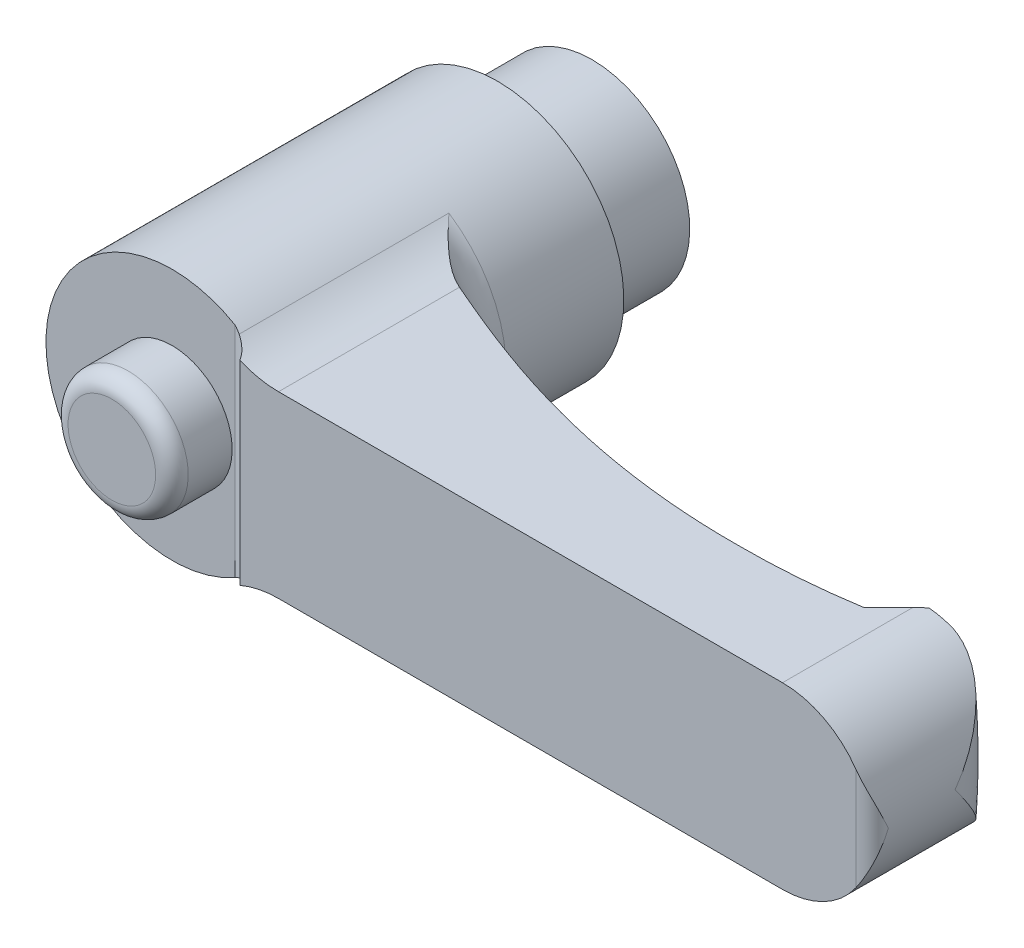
ISO-10303-21;
HEADER;
FILE_DESCRIPTION(('STEP AP214'),'2;1');
FILE_NAME('part.step','',(''),(''),'','','');
FILE_SCHEMA(('AUTOMOTIVE_DESIGN { 1 0 10303 214 1 1 1 1 }'));
ENDSEC;
DATA;
#1=APPLICATION_CONTEXT('core data for automotive mechanical design processes');
#2=APPLICATION_PROTOCOL_DEFINITION('international standard','automotive_design',2000,#1);
#3=PRODUCT_CONTEXT('',#1,'mechanical');
#4=PRODUCT('Part','Part','',(#3));
#5=PRODUCT_RELATED_PRODUCT_CATEGORY('part','',(#4));
#6=PRODUCT_DEFINITION_FORMATION('','',#4);
#7=PRODUCT_DEFINITION_CONTEXT('part definition',#1,'design');
#8=PRODUCT_DEFINITION('design','',#6,#7);
#9=PRODUCT_DEFINITION_SHAPE('','',#8);
#10=(LENGTH_UNIT() NAMED_UNIT(*) SI_UNIT(.MILLI.,.METRE.));
#11=(NAMED_UNIT(*) PLANE_ANGLE_UNIT() SI_UNIT($,.RADIAN.));
#12=(NAMED_UNIT(*) SI_UNIT($,.STERADIAN.) SOLID_ANGLE_UNIT());
#13=UNCERTAINTY_MEASURE_WITH_UNIT(LENGTH_MEASURE(1.E-05),#10,'distance_accuracy_value','');
#14=(GEOMETRIC_REPRESENTATION_CONTEXT(3) GLOBAL_UNCERTAINTY_ASSIGNED_CONTEXT((#13)) GLOBAL_UNIT_ASSIGNED_CONTEXT((#10,
#11,#12)) REPRESENTATION_CONTEXT('',''));
#15=CARTESIAN_POINT('',(0.,0.,0.));
#16=DIRECTION('',(0.,0.,1.));
#17=DIRECTION('',(1.,0.,0.));
#18=AXIS2_PLACEMENT_3D('',#15,#16,#17);
#19=CARTESIAN_POINT('',(4.8,0.,0.));
#20=DIRECTION('',(0.,0.,1.));
#21=DIRECTION('',(0.,-1.,0.));
#22=AXIS2_PLACEMENT_3D('',#19,#20,#21);
#23=PLANE('',#22);
#24=CARTESIAN_POINT('',(0.,0.,0.));
#25=DIRECTION('',(0.,0.,-1.));
#26=DIRECTION('',(0.,1.,0.));
#27=AXIS2_PLACEMENT_3D('',#24,#25,#26);
#28=CIRCLE('',#27,2.5);
#29=CARTESIAN_POINT('',(0.,2.5,0.));
#30=VERTEX_POINT('',#29);
#31=EDGE_CURVE('E463',#30,#30,#28,.T.);
#32=ORIENTED_EDGE('',*,*,#31,.F.);
#33=EDGE_LOOP('',(#32));
#34=FACE_BOUND('',#33,.T.);
#35=CARTESIAN_POINT('',(0.,0.,0.));
#36=DIRECTION('',(0.,0.,-1.));
#37=DIRECTION('',(0.,1.,0.));
#38=AXIS2_PLACEMENT_3D('',#35,#36,#37);
#39=CIRCLE('',#38,4.8);
#40=CARTESIAN_POINT('',(0.,4.8,0.));
#41=VERTEX_POINT('',#40);
#42=EDGE_CURVE('E411',#41,#41,#39,.T.);
#43=ORIENTED_EDGE('',*,*,#42,.T.);
#44=EDGE_LOOP('',(#43));
#45=FACE_BOUND('',#44,.T.);
#46=ADVANCED_FACE('F14',(#34,#45),#23,.F.);
#47=CARTESIAN_POINT('',(0.,0.,26.));
#48=DIRECTION('',(0.,0.,-1.));
#49=DIRECTION('',(0.,1.,0.));
#50=AXIS2_PLACEMENT_3D('',#47,#48,#49);
#51=PLANE('',#50);
#52=CARTESIAN_POINT('',(0.,0.,26.));
#53=DIRECTION('',(0.,0.,-1.));
#54=DIRECTION('',(0.,1.,0.));
#55=AXIS2_PLACEMENT_3D('',#52,#53,#54);
#56=CIRCLE('',#55,7.75);
#57=CARTESIAN_POINT('',(3.875,-6.7116968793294,26.));
#58=VERTEX_POINT('',#57);
#59=CARTESIAN_POINT('',(3.875,6.7116968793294,26.));
#60=VERTEX_POINT('',#59);
#61=EDGE_CURVE('E358',#58,#60,#56,.T.);
#62=ORIENTED_EDGE('',*,*,#61,.F.);
#63=DIRECTION('',(0.,1.,0.));
#64=VECTOR('',#63,1.);
#65=CARTESIAN_POINT('',(3.875,-11.,26.));
#66=LINE('',#65,#64);
#67=EDGE_CURVE('E445',#58,#60,#66,.T.);
#68=ORIENTED_EDGE('',*,*,#67,.T.);
#69=EDGE_LOOP('',(#62,#68));
#70=FACE_BOUND('',#69,.T.);
#71=CARTESIAN_POINT('',(0.,0.,26.));
#72=DIRECTION('',(0.,0.,-1.));
#73=DIRECTION('',(0.,1.,0.));
#74=AXIS2_PLACEMENT_3D('',#71,#72,#73);
#75=CIRCLE('',#74,3.69047619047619);
#76=CARTESIAN_POINT('',(0.,3.69047619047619,26.));
#77=VERTEX_POINT('',#76);
#78=EDGE_CURVE('E9',#77,#77,#75,.F.);
#79=ORIENTED_EDGE('',*,*,#78,.F.);
#80=EDGE_LOOP('',(#79));
#81=FACE_BOUND('',#80,.T.);
#82=ADVANCED_FACE('F16',(#70,#81),#51,.F.);
#83=CARTESIAN_POINT('',(38.5,0.,0.));
#84=DIRECTION('',(0.,0.,1.));
#85=DIRECTION('',(0.,-1.,0.));
#86=AXIS2_PLACEMENT_3D('',#83,#84,#85);
#87=CYLINDRICAL_SURFACE('',#86,5.5);
#88=CARTESIAN_POINT('',(44.,0.,21.9));
#89=CARTESIAN_POINT('',(44.0000000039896,-0.00425779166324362,21.8968685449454));
#90=CARTESIAN_POINT('',(43.9999950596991,-0.00851571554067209,21.8937369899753));
#91=CARTESIAN_POINT('',(43.9991083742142,-0.390143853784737,21.6130627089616));
#92=CARTESIAN_POINT('',(43.9593602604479,-0.76848056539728,21.3348044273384));
#93=CARTESIAN_POINT('',(43.8405607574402,-1.32856821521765,20.92503354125));
#94=CARTESIAN_POINT('',(43.7909532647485,-1.51435974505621,20.7894725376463));
#95=CARTESIAN_POINT('',(43.6715029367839,-1.88225773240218,20.5222473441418));
#96=CARTESIAN_POINT('',(43.601669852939,-2.06436592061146,20.3905813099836));
#97=CARTESIAN_POINT('',(43.4611872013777,-2.37875122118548,20.1648816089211));
#98=CARTESIAN_POINT('',(43.3950453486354,-2.51217438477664,20.0696210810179));
#99=CARTESIAN_POINT('',(43.250799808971,-2.77532702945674,19.8831417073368));
#100=CARTESIAN_POINT('',(43.1726935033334,-2.90505569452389,19.7919237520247));
#101=CARTESIAN_POINT('',(42.9202953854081,-3.28692053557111,19.5261795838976));
#102=CARTESIAN_POINT('',(42.727561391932,-3.53256609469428,19.3589622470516));
#103=CARTESIAN_POINT('',(42.3484683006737,-3.93634172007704,19.0952853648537));
#104=CARTESIAN_POINT('',(42.1735223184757,-4.10060224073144,18.9917399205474));
#105=CARTESIAN_POINT('',(41.7960798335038,-4.40966486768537,18.8081296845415));
#106=CARTESIAN_POINT('',(41.5936163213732,-4.55448986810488,18.7280371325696));
#107=CARTESIAN_POINT('',(41.2098130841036,-4.79019974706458,18.6136936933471));
#108=CARTESIAN_POINT('',(41.0333744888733,-4.88597642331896,18.5732748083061));
#109=CARTESIAN_POINT('',(40.7593164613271,-5.01555037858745,18.5310688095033));
#110=CARTESIAN_POINT('',(40.666374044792,-5.05640116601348,18.5200701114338));
#111=CARTESIAN_POINT('',(40.4779067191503,-5.13305107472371,18.5048417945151));
#112=CARTESIAN_POINT('',(40.3823830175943,-5.16885251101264,18.5006090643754));
#113=CARTESIAN_POINT('',(40.1884747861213,-5.23542428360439,18.4995076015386));
#114=CARTESIAN_POINT('',(40.090071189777,-5.26614066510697,18.5027130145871));
#115=CARTESIAN_POINT('',(39.8922874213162,-5.32184956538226,18.5171885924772));
#116=CARTESIAN_POINT('',(39.7929078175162,-5.34684523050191,18.528454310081));
#117=CARTESIAN_POINT('',(39.5942462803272,-5.39100815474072,18.5594647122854));
#118=CARTESIAN_POINT('',(39.4949643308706,-5.41017990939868,18.5792028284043));
#119=CARTESIAN_POINT('',(39.2976352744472,-5.44277299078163,18.6274002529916));
#120=CARTESIAN_POINT('',(39.1995875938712,-5.45619709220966,18.6558553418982));
#121=CARTESIAN_POINT('',(38.9984921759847,-5.47836544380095,18.7240647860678));
#122=CARTESIAN_POINT('',(38.8956289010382,-5.48667774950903,18.7645122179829));
#123=CARTESIAN_POINT('',(38.7445568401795,-5.49479244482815,18.8326405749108));
#124=CARTESIAN_POINT('',(38.6947409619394,-5.49677173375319,18.8565904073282));
#125=CARTESIAN_POINT('',(38.5963240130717,-5.49937673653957,18.9069325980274));
#126=CARTESIAN_POINT('',(38.5477229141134,-5.50000248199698,18.9333248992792));
#127=CARTESIAN_POINT('',(38.4998,-5.49999999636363,18.9609171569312));
#128=B_SPLINE_CURVE_WITH_KNOTS('',3,(#88,#89,#90,#91,#92,#93,#94,#95,#96,#97,#98,#99,#100,#101,
#102,#103,#104,#105,#106,#107,#108,#109,#110,#111,#112,#113,#114,#115,#116,#117,#118,#119,#120,
#121,#122,#123,#124,#125,#126,#127),.UNSPECIFIED.,.F.,.F.,(4,2,2,2,2,2,2,2,2,2,2,2,2,2,2,2,2,2,
2,4),(0.,0.0158565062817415,1.4211419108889,2.12636053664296,2.83123971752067,3.36110592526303,
3.89108827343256,4.94782257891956,5.7293360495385,6.50992069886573,7.12169061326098,
7.42772009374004,7.73360880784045,8.04255979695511,8.35134045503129,8.65988215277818,
8.96827473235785,9.30004722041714,9.46590364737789,9.63175620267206),.UNSPECIFIED.);
#129=CARTESIAN_POINT('',(40.2644155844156,-5.20930299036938,18.5));
#130=VERTEX_POINT('',#129);
#131=CARTESIAN_POINT('',(44.,0.,21.9));
#132=VERTEX_POINT('',#131);
#133=EDGE_CURVE('E126',#130,#132,#128,.F.);
#134=ORIENTED_EDGE('',*,*,#133,.T.);
#135=CARTESIAN_POINT('',(44.,0.,21.9));
#136=CARTESIAN_POINT('',(44.0000000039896,0.00425779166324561,21.8968685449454));
#137=CARTESIAN_POINT('',(43.9999950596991,0.00851571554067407,21.8937369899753));
#138=CARTESIAN_POINT('',(43.9991083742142,0.390143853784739,21.6130627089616));
#139=CARTESIAN_POINT('',(43.9593602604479,0.768480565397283,21.3348044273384));
#140=CARTESIAN_POINT('',(43.8405607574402,1.32856821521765,20.92503354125));
#141=CARTESIAN_POINT('',(43.7909532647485,1.51435974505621,20.7894725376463));
#142=CARTESIAN_POINT('',(43.6715029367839,1.88225773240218,20.5222473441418));
#143=CARTESIAN_POINT('',(43.601669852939,2.06436592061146,20.3905813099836));
#144=CARTESIAN_POINT('',(43.4611872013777,2.37875122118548,20.1648816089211));
#145=CARTESIAN_POINT('',(43.3950453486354,2.51217438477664,20.0696210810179));
#146=CARTESIAN_POINT('',(43.250799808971,2.77532702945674,19.8831417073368));
#147=CARTESIAN_POINT('',(43.1726935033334,2.9050556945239,19.7919237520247));
#148=CARTESIAN_POINT('',(42.9202953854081,3.28692053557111,19.5261795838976));
#149=CARTESIAN_POINT('',(42.727561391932,3.53256609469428,19.3589622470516));
#150=CARTESIAN_POINT('',(42.3484683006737,3.93634172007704,19.0952853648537));
#151=CARTESIAN_POINT('',(42.1735223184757,4.10060224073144,18.9917399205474));
#152=CARTESIAN_POINT('',(41.7960798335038,4.40966486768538,18.8081296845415));
#153=CARTESIAN_POINT('',(41.5936163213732,4.55448986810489,18.7280371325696));
#154=CARTESIAN_POINT('',(41.2098130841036,4.79019974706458,18.6136936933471));
#155=CARTESIAN_POINT('',(41.0333744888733,4.88597642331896,18.5732748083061));
#156=CARTESIAN_POINT('',(40.7593164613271,5.01555037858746,18.5310688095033));
#157=CARTESIAN_POINT('',(40.666374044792,5.05640116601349,18.5200701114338));
#158=CARTESIAN_POINT('',(40.4779067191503,5.13305107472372,18.5048417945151));
#159=CARTESIAN_POINT('',(40.3823830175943,5.16885251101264,18.5006090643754));
#160=CARTESIAN_POINT('',(40.1884747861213,5.23542428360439,18.4995076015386));
#161=CARTESIAN_POINT('',(40.090071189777,5.26614066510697,18.5027130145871));
#162=CARTESIAN_POINT('',(39.8922874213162,5.32184956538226,18.5171885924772));
#163=CARTESIAN_POINT('',(39.7929078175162,5.34684523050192,18.528454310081));
#164=CARTESIAN_POINT('',(39.5942462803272,5.39100815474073,18.5594647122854));
#165=CARTESIAN_POINT('',(39.4949643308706,5.41017990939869,18.5792028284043));
#166=CARTESIAN_POINT('',(39.2976352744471,5.44277299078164,18.6274002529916));
#167=CARTESIAN_POINT('',(39.1995875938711,5.45619709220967,18.6558553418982));
#168=CARTESIAN_POINT('',(38.9984921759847,5.47836544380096,18.7240647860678));
#169=CARTESIAN_POINT('',(38.8956289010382,5.48667774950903,18.7645122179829));
#170=CARTESIAN_POINT('',(38.7445568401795,5.49479244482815,18.8326405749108));
#171=CARTESIAN_POINT('',(38.6947409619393,5.4967717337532,18.8565904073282));
#172=CARTESIAN_POINT('',(38.5963240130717,5.49937673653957,18.9069325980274));
#173=CARTESIAN_POINT('',(38.5477229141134,5.50000248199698,18.9333248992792));
#174=CARTESIAN_POINT('',(38.4998,5.49999999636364,18.9609171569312));
#175=B_SPLINE_CURVE_WITH_KNOTS('',3,(#135,#136,#137,#138,#139,#140,#141,#142,#143,#144,#145,
#146,#147,#148,#149,#150,#151,#152,#153,#154,#155,#156,#157,#158,#159,#160,#161,#162,#163,#164,
#165,#166,#167,#168,#169,#170,#171,#172,#173,#174),.UNSPECIFIED.,.F.,.F.,(4,2,2,2,2,2,2,2,2,2,2,
2,2,2,2,2,2,2,2,4),(0.,0.0158565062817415,1.4211419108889,2.12636053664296,2.83123971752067,
3.36110592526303,3.89108827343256,4.94782257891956,5.72933604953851,6.50992069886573,
7.12169061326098,7.42772009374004,7.73360880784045,8.04255979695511,8.35134045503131,
8.6598821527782,8.9682747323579,9.30004722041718,9.46590364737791,9.63175620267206),.UNSPECIFIED.);
#176=CARTESIAN_POINT('',(40.2644155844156,5.20930299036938,18.5));
#177=VERTEX_POINT('',#176);
#178=EDGE_CURVE('E123',#132,#177,#175,.T.);
#179=ORIENTED_EDGE('',*,*,#178,.T.);
#180=CARTESIAN_POINT('',(38.5,0.,18.5));
#181=DIRECTION('',(0.,0.,-1.));
#182=DIRECTION('',(0.,1.,0.));
#183=AXIS2_PLACEMENT_3D('',#180,#181,#182);
#184=CIRCLE('',#183,5.5);
#185=CARTESIAN_POINT('',(39.,5.47722557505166,18.5));
#186=VERTEX_POINT('',#185);
#187=EDGE_CURVE('E451',#177,#186,#184,.F.);
#188=ORIENTED_EDGE('',*,*,#187,.T.);
#189=CARTESIAN_POINT('',(38.5,0.,19.));
#190=DIRECTION('',(-0.707106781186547,0.,-0.707106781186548));
#191=DIRECTION('',(-0.707106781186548,0.,0.707106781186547));
#192=AXIS2_PLACEMENT_3D('',#189,#190,#191);
#193=ELLIPSE('',#192,7.77817459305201,5.5);
#194=CARTESIAN_POINT('',(38.5,5.5,19.));
#195=VERTEX_POINT('',#194);
#196=EDGE_CURVE('E384',#186,#195,#193,.F.);
#197=ORIENTED_EDGE('',*,*,#196,.T.);
#198=DIRECTION('',(0.,0.,1.));
#199=VECTOR('',#198,1.);
#200=CARTESIAN_POINT('',(38.5,5.5,0.));
#201=LINE('',#200,#199);
#202=CARTESIAN_POINT('',(38.5,5.5,27.));
#203=VERTEX_POINT('',#202);
#204=EDGE_CURVE('E383',#195,#203,#201,.T.);
#205=ORIENTED_EDGE('',*,*,#204,.T.);
#206=CARTESIAN_POINT('',(38.5,0.,27.));
#207=DIRECTION('',(0.,0.,1.));
#208=DIRECTION('',(0.,-1.,0.));
#209=AXIS2_PLACEMENT_3D('',#206,#207,#208);
#210=CIRCLE('',#209,5.5);
#211=CARTESIAN_POINT('',(43.,3.16227766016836,27.));
#212=VERTEX_POINT('',#211);
#213=EDGE_CURVE('E361',#212,#203,#210,.T.);
#214=ORIENTED_EDGE('',*,*,#213,.F.);
#215=CARTESIAN_POINT('',(43.,3.16227766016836,27.));
#216=CARTESIAN_POINT('',(43.0489698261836,3.09261080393,26.9999556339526));
#217=CARTESIAN_POINT('',(43.0962528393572,3.0218687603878,26.9964077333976));
#218=CARTESIAN_POINT('',(43.1871872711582,2.87878712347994,26.9834058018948));
#219=CARTESIAN_POINT('',(43.2308453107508,2.80645076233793,26.9739628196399));
#220=CARTESIAN_POINT('',(43.3141980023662,2.66092047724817,26.9503365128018));
#221=CARTESIAN_POINT('',(43.3539154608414,2.58773460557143,26.9361828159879));
#222=CARTESIAN_POINT('',(43.4296865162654,2.44030003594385,26.903917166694));
#223=CARTESIAN_POINT('',(43.4657377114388,2.36605067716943,26.8858026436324));
#224=CARTESIAN_POINT('',(43.5573559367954,2.16613298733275,26.8329178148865));
#225=CARTESIAN_POINT('',(43.6095944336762,2.03971389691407,26.7951786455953));
#226=CARTESIAN_POINT('',(43.703955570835,1.78529411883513,26.7129945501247));
#227=CARTESIAN_POINT('',(43.7460735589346,1.65729273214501,26.6685465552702));
#228=CARTESIAN_POINT('',(43.8205857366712,1.39978291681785,26.5746664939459));
#229=CARTESIAN_POINT('',(43.852946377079,1.27027084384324,26.5252179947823));
#230=CARTESIAN_POINT('',(43.9079882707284,1.01058108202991,26.4229956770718));
#231=CARTESIAN_POINT('',(43.9306732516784,0.880403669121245,26.3702231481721));
#232=CARTESIAN_POINT('',(43.9654953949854,0.627432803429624,26.2658240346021));
#233=CARTESIAN_POINT('',(43.9781829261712,0.504664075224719,26.2143181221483));
#234=CARTESIAN_POINT('',(43.9952673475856,0.259135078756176,26.1104803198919));
#235=CARTESIAN_POINT('',(43.9996786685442,0.136375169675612,26.0581500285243));
#236=CARTESIAN_POINT('',(43.9999943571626,0.00909584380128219,26.0038784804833));
#237=CARTESIAN_POINT('',(43.9999999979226,0.00454789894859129,26.0019392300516));
#238=CARTESIAN_POINT('',(44.,0.,26.));
#239=B_SPLINE_CURVE_WITH_KNOTS('',3,(#215,#216,#217,#218,#219,#220,#221,#222,#223,#224,#225,
#226,#227,#228,#229,#230,#231,#232,#233,#234,#235,#236,#237,#238),.UNSPECIFIED.,.F.,.F.,(4,2,2,
2,2,2,2,2,2,2,2,4),(0.,0.255244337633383,0.510011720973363,0.763206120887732,1.01656533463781,
1.44159949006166,1.8668286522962,2.2935036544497,2.72001412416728,3.12097942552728,
3.52124493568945,3.53607734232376),.UNSPECIFIED.);
#240=CARTESIAN_POINT('',(44.,0.,26.));
#241=VERTEX_POINT('',#240);
#242=EDGE_CURVE('E168',#241,#212,#239,.F.);
#243=ORIENTED_EDGE('',*,*,#242,.F.);
#244=CARTESIAN_POINT('',(43.,-3.16227766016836,27.));
#245=CARTESIAN_POINT('',(43.0489698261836,-3.09261080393,26.9999556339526));
#246=CARTESIAN_POINT('',(43.0962528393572,-3.0218687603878,26.9964077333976));
#247=CARTESIAN_POINT('',(43.1871872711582,-2.87878712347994,26.9834058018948));
#248=CARTESIAN_POINT('',(43.2308453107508,-2.80645076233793,26.9739628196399));
#249=CARTESIAN_POINT('',(43.3141980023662,-2.66092047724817,26.9503365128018));
#250=CARTESIAN_POINT('',(43.3539154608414,-2.58773460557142,26.9361828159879));
#251=CARTESIAN_POINT('',(43.4296865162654,-2.44030003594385,26.903917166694));
#252=CARTESIAN_POINT('',(43.4657377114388,-2.36605067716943,26.8858026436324));
#253=CARTESIAN_POINT('',(43.5573559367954,-2.16613298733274,26.8329178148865));
#254=CARTESIAN_POINT('',(43.6095944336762,-2.03971389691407,26.7951786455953));
#255=CARTESIAN_POINT('',(43.703955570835,-1.78529411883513,26.7129945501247));
#256=CARTESIAN_POINT('',(43.7460735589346,-1.65729273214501,26.6685465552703));
#257=CARTESIAN_POINT('',(43.8205857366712,-1.39978291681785,26.5746664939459));
#258=CARTESIAN_POINT('',(43.852946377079,-1.27027084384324,26.5252179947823));
#259=CARTESIAN_POINT('',(43.9079882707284,-1.01058108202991,26.4229956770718));
#260=CARTESIAN_POINT('',(43.9306732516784,-0.880403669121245,26.3702231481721));
#261=CARTESIAN_POINT('',(43.9654953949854,-0.627432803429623,26.2658240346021));
#262=CARTESIAN_POINT('',(43.9781829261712,-0.504664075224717,26.2143181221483));
#263=CARTESIAN_POINT('',(43.9952673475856,-0.259135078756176,26.1104803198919));
#264=CARTESIAN_POINT('',(43.9996786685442,-0.136375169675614,26.0581500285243));
#265=CARTESIAN_POINT('',(43.9999943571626,-0.00909584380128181,26.0038784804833));
#266=CARTESIAN_POINT('',(43.9999999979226,-0.00454789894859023,26.0019392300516));
#267=CARTESIAN_POINT('',(44.,0.,26.));
#268=B_SPLINE_CURVE_WITH_KNOTS('',3,(#244,#245,#246,#247,#248,#249,#250,#251,#252,#253,#254,
#255,#256,#257,#258,#259,#260,#261,#262,#263,#264,#265,#266,#267),.UNSPECIFIED.,.F.,.F.,(4,2,2,
2,2,2,2,2,2,2,2,4),(0.,0.255244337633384,0.510011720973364,0.763206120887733,1.01656533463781,
1.44159949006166,1.8668286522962,2.2935036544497,2.72001412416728,3.12097942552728,
3.52124493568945,3.53607734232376),.UNSPECIFIED.);
#269=CARTESIAN_POINT('',(43.,-3.16227766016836,27.));
#270=VERTEX_POINT('',#269);
#271=EDGE_CURVE('E22',#270,#241,#268,.T.);
#272=ORIENTED_EDGE('',*,*,#271,.F.);
#273=CARTESIAN_POINT('',(38.5,-5.5,27.));
#274=VERTEX_POINT('',#273);
#275=EDGE_CURVE('E367',#274,#270,#210,.T.);
#276=ORIENTED_EDGE('',*,*,#275,.F.);
#277=DIRECTION('',(0.,0.,1.));
#278=VECTOR('',#277,1.);
#279=CARTESIAN_POINT('',(38.5,-5.5,0.));
#280=LINE('',#279,#278);
#281=CARTESIAN_POINT('',(38.5,-5.5,19.));
#282=VERTEX_POINT('',#281);
#283=EDGE_CURVE('E387',#282,#274,#280,.T.);
#284=ORIENTED_EDGE('',*,*,#283,.F.);
#285=CARTESIAN_POINT('',(39.,-5.47722557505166,18.5));
#286=VERTEX_POINT('',#285);
#287=EDGE_CURVE('E434',#282,#286,#193,.F.);
#288=ORIENTED_EDGE('',*,*,#287,.T.);
#289=EDGE_CURVE('E134',#286,#130,#184,.F.);
#290=ORIENTED_EDGE('',*,*,#289,.T.);
#291=EDGE_LOOP('',(#134,#179,#188,#197,#205,#214,#243,#272,#276,#284,#288,#290));
#292=FACE_BOUND('',#291,.T.);
#293=ADVANCED_FACE('F132',(#292),#87,.T.);
#294=CARTESIAN_POINT('',(40.6,-11.,18.5));
#295=DIRECTION('',(0.,0.,-1.));
#296=DIRECTION('',(0.,1.,0.));
#297=AXIS2_PLACEMENT_3D('',#294,#295,#296);
#298=PLANE('',#297);
#299=ORIENTED_EDGE('',*,*,#187,.F.);
#300=CARTESIAN_POINT('',(0.,0.,18.5));
#301=DIRECTION('',(0.,0.,-1.));
#302=DIRECTION('',(0.,1.,0.));
#303=AXIS2_PLACEMENT_3D('',#300,#301,#302);
#304=CIRCLE('',#303,40.6);
#305=EDGE_CURVE('E37',#177,#130,#304,.T.);
#306=ORIENTED_EDGE('',*,*,#305,.T.);
#307=ORIENTED_EDGE('',*,*,#289,.F.);
#308=DIRECTION('',(0.,1.,0.));
#309=VECTOR('',#308,1.);
#310=CARTESIAN_POINT('',(39.,-11.,18.5));
#311=LINE('',#310,#309);
#312=EDGE_CURVE('E442',#286,#186,#311,.T.);
#313=ORIENTED_EDGE('',*,*,#312,.T.);
#314=EDGE_LOOP('',(#299,#306,#307,#313));
#315=FACE_BOUND('',#314,.T.);
#316=ADVANCED_FACE('F157',(#315),#298,.T.);
#317=CARTESIAN_POINT('',(0.,0.,27.));
#318=DIRECTION('',(0.,0.,1.));
#319=DIRECTION('',(0.,-1.,0.));
#320=AXIS2_PLACEMENT_3D('',#317,#318,#319);
#321=PLANE('',#320);
#322=CARTESIAN_POINT('',(7.53740671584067,11.5,27.));
#323=DIRECTION('',(0.,0.,1.));
#324=DIRECTION('',(1.,0.,0.));
#325=AXIS2_PLACEMENT_3D('',#322,#323,#324);
#326=CIRCLE('',#325,6.);
#327=CARTESIAN_POINT('',(5.16666666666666,5.988231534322,27.));
#328=VERTEX_POINT('',#327);
#329=CARTESIAN_POINT('',(7.53740671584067,5.5,27.));
#330=VERTEX_POINT('',#329);
#331=EDGE_CURVE('E392',#328,#330,#326,.T.);
#332=ORIENTED_EDGE('',*,*,#331,.F.);
#333=DIRECTION('',(0.,1.,0.));
#334=VECTOR('',#333,1.);
#335=CARTESIAN_POINT('',(5.16666666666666,-11.,27.));
#336=LINE('',#335,#334);
#337=CARTESIAN_POINT('',(5.16666666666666,-5.988231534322,27.));
#338=VERTEX_POINT('',#337);
#339=EDGE_CURVE('E430',#338,#328,#336,.T.);
#340=ORIENTED_EDGE('',*,*,#339,.F.);
#341=CARTESIAN_POINT('',(7.53740671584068,-11.5,27.));
#342=DIRECTION('',(0.,0.,1.));
#343=DIRECTION('',(1.,0.,0.));
#344=AXIS2_PLACEMENT_3D('',#341,#342,#343);
#345=CIRCLE('',#344,6.);
#346=CARTESIAN_POINT('',(7.53740671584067,-5.5,27.));
#347=VERTEX_POINT('',#346);
#348=EDGE_CURVE('E395',#347,#338,#345,.T.);
#349=ORIENTED_EDGE('',*,*,#348,.F.);
#350=DIRECTION('',(-1.,0.,0.));
#351=VECTOR('',#350,1.);
#352=CARTESIAN_POINT('',(38.5,-5.5,27.));
#353=LINE('',#352,#351);
#354=EDGE_CURVE('E391',#274,#347,#353,.T.);
#355=ORIENTED_EDGE('',*,*,#354,.F.);
#356=ORIENTED_EDGE('',*,*,#275,.T.);
#357=DIRECTION('',(0.,1.,0.));
#358=VECTOR('',#357,1.);
#359=CARTESIAN_POINT('',(43.,-11.,27.));
#360=LINE('',#359,#358);
#361=EDGE_CURVE('E379',#270,#212,#360,.T.);
#362=ORIENTED_EDGE('',*,*,#361,.T.);
#363=ORIENTED_EDGE('',*,*,#213,.T.);
#364=DIRECTION('',(1.,0.,0.));
#365=VECTOR('',#364,1.);
#366=CARTESIAN_POINT('',(7.53740671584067,5.5,27.));
#367=LINE('',#366,#365);
#368=EDGE_CURVE('E378',#330,#203,#367,.T.);
#369=ORIENTED_EDGE('',*,*,#368,.F.);
#370=EDGE_LOOP('',(#332,#340,#349,#355,#356,#362,#363,#369));
#371=FACE_BOUND('',#370,.T.);
#372=ADVANCED_FACE('F234',(#371),#321,.T.);
#373=CARTESIAN_POINT('',(0.,0.,0.));
#374=DIRECTION('',(0.,0.,-1.));
#375=DIRECTION('',(0.,1.,0.));
#376=AXIS2_PLACEMENT_3D('',#373,#374,#375);
#377=CYLINDRICAL_SURFACE('',#376,7.75);
#378=CARTESIAN_POINT('',(0.,0.,13.2417430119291));
#379=DIRECTION('',(0.,0.,-1.));
#380=DIRECTION('',(0.,1.,0.));
#381=AXIS2_PLACEMENT_3D('',#378,#379,#380);
#382=CIRCLE('',#381,7.75);
#383=CARTESIAN_POINT('',(4.24835651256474,6.48181818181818,13.2417430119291));
#384=VERTEX_POINT('',#383);
#385=CARTESIAN_POINT('',(4.24835651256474,-6.48181818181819,13.2417430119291));
#386=VERTEX_POINT('',#385);
#387=EDGE_CURVE('E353',#384,#386,#382,.T.);
#388=ORIENTED_EDGE('',*,*,#387,.T.);
#389=DIRECTION('',(0.,0.,1.));
#390=VECTOR('',#389,1.);
#391=CARTESIAN_POINT('',(4.24835651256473,-6.48181818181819,0.));
#392=LINE('',#391,#390);
#393=CARTESIAN_POINT('',(4.24835651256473,-6.48181818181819,26.1308937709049));
#394=VERTEX_POINT('',#393);
#395=EDGE_CURVE('E403',#386,#394,#392,.T.);
#396=ORIENTED_EDGE('',*,*,#395,.T.);
#397=CARTESIAN_POINT('',(3.875,-6.7116968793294,26.));
#398=CARTESIAN_POINT('',(3.9487248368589,-6.66914880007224,26.0179048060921));
#399=CARTESIAN_POINT('',(4.02097408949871,-6.62579988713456,26.039874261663));
#400=CARTESIAN_POINT('',(4.16199829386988,-6.53812669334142,26.0915573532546));
#401=CARTESIAN_POINT('',(4.23077434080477,-6.49380272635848,26.1212685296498));
#402=CARTESIAN_POINT('',(4.36202505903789,-6.40634475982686,26.1868862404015));
#403=CARTESIAN_POINT('',(4.42463632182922,-6.36322379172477,26.2225378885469));
#404=CARTESIAN_POINT('',(4.54579687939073,-6.27724013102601,26.3004737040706));
#405=CARTESIAN_POINT('',(4.60434578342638,-6.23437746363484,26.3427585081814));
#406=CARTESIAN_POINT('',(4.71026264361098,-6.1546555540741,26.4283893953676));
#407=CARTESIAN_POINT('',(4.75813291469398,-6.11768751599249,26.4710140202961));
#408=CARTESIAN_POINT('',(4.8500303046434,-6.04509175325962,26.56120031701));
#409=CARTESIAN_POINT('',(4.89405965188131,-6.00946325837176,26.6087590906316));
#410=CARTESIAN_POINT('',(4.97925799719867,-5.9390764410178,26.7103994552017));
#411=CARTESIAN_POINT('',(5.02029084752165,-5.90438218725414,26.7646407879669));
#412=CARTESIAN_POINT('',(5.09738332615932,-5.83796295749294,26.8783962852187));
#413=CARTESIAN_POINT('',(5.13343386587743,-5.80624344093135,26.9379197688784));
#414=CARTESIAN_POINT('',(5.16666666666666,-5.77650894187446,27.));
#415=B_SPLINE_CURVE_WITH_KNOTS('',3,(#397,#398,#399,#400,#401,#402,#403,#404,#405,#406,#407,
#408,#409,#410,#411,#412,#413,#414),.UNSPECIFIED.,.F.,.F.,(4,2,2,2,2,2,2,2,4),(0.,
0.26081186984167,0.521540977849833,0.773092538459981,1.02466826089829,1.24638864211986,
1.4679795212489,1.6966429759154,1.92571819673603),.UNSPECIFIED.);
#416=EDGE_CURVE('E209',#58,#394,#415,.T.);
#417=ORIENTED_EDGE('',*,*,#416,.F.);
#418=ORIENTED_EDGE('',*,*,#61,.T.);
#419=CARTESIAN_POINT('',(5.16666666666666,5.77650894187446,27.));
#420=CARTESIAN_POINT('',(5.13714077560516,5.80292379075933,26.9448365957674));
#421=CARTESIAN_POINT('',(5.1053831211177,5.83091583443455,26.8916890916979));
#422=CARTESIAN_POINT('',(5.03785941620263,5.88934998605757,26.7895453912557));
#423=CARTESIAN_POINT('',(5.00209830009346,5.91978906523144,26.7405442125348));
#424=CARTESIAN_POINT('',(4.92700880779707,5.98243056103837,26.646752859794));
#425=CARTESIAN_POINT('',(4.88768622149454,6.01463008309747,26.6019560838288));
#426=CARTESIAN_POINT('',(4.80573825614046,6.08030777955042,26.5165060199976));
#427=CARTESIAN_POINT('',(4.76311181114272,6.11378636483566,26.4758540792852));
#428=CARTESIAN_POINT('',(4.63114473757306,6.21507952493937,26.3605779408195));
#429=CARTESIAN_POINT('',(4.53728284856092,6.28411879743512,26.2920994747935));
#430=CARTESIAN_POINT('',(4.3393749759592,6.42237347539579,26.1724069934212));
#431=CARTESIAN_POINT('',(4.23533663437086,6.49158871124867,26.1211801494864));
#432=CARTESIAN_POINT('',(4.08621326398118,6.5854168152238,26.0632790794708));
#433=CARTESIAN_POINT('',(4.04469277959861,6.61100425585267,26.0487072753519));
#434=CARTESIAN_POINT('',(3.96061680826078,6.66171281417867,26.0222973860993));
#435=CARTESIAN_POINT('',(3.91806319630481,6.68683464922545,26.0104547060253));
#436=CARTESIAN_POINT('',(3.8750000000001,6.7116968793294,26.));
#437=B_SPLINE_CURVE_WITH_KNOTS('',3,(#419,#420,#421,#422,#423,#424,#425,#426,#427,#428,#429,
#430,#431,#432,#433,#434,#435,#436),.UNSPECIFIED.,.F.,.F.,(4,2,2,2,2,2,2,2,4),(0.,
0.203583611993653,0.406919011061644,0.609929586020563,0.81300593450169,1.21684507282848,
1.62038324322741,1.77301957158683,1.92539700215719),.UNSPECIFIED.);
#438=CARTESIAN_POINT('',(4.24835651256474,6.48181818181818,26.1308937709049));
#439=VERTEX_POINT('',#438);
#440=EDGE_CURVE('E222',#439,#60,#437,.T.);
#441=ORIENTED_EDGE('',*,*,#440,.F.);
#442=DIRECTION('',(0.,0.,1.));
#443=VECTOR('',#442,1.);
#444=CARTESIAN_POINT('',(4.24835651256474,6.48181818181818,0.));
#445=LINE('',#444,#443);
#446=EDGE_CURVE('E409',#384,#439,#445,.T.);
#447=ORIENTED_EDGE('',*,*,#446,.F.);
#448=EDGE_LOOP('',(#388,#396,#417,#418,#441,#447));
#449=FACE_BOUND('',#448,.T.);
#450=CARTESIAN_POINT('',(0.,0.,6.));
#451=DIRECTION('',(0.,0.,-1.));
#452=DIRECTION('',(0.,1.,0.));
#453=AXIS2_PLACEMENT_3D('',#450,#451,#452);
#454=CIRCLE('',#453,7.75);
#455=CARTESIAN_POINT('',(0.,7.75,6.));
#456=VERTEX_POINT('',#455);
#457=EDGE_CURVE('E356',#456,#456,#454,.T.);
#458=ORIENTED_EDGE('',*,*,#457,.F.);
#459=EDGE_LOOP('',(#458));
#460=FACE_BOUND('',#459,.T.);
#461=ADVANCED_FACE('F232',(#449,#460),#377,.T.);
#462=CARTESIAN_POINT('',(7.53740671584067,11.5,0.));
#463=DIRECTION('',(0.,0.,1.));
#464=DIRECTION('',(0.,-1.,0.));
#465=AXIS2_PLACEMENT_3D('',#462,#463,#464);
#466=CYLINDRICAL_SURFACE('',#465,6.);
#467=DIRECTION('',(0.,0.,1.));
#468=VECTOR('',#467,1.);
#469=CARTESIAN_POINT('',(7.53740671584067,5.5,0.));
#470=LINE('',#469,#468);
#471=CARTESIAN_POINT('',(7.53740671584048,5.5,15.8847846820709));
#472=VERTEX_POINT('',#471);
#473=EDGE_CURVE('E386',#472,#330,#470,.T.);
#474=ORIENTED_EDGE('',*,*,#473,.F.);
#475=CARTESIAN_POINT('',(7.53760671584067,5.50000000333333,15.8848714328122));
#476=CARTESIAN_POINT('',(7.42056429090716,5.50000237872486,15.8340928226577));
#477=CARTESIAN_POINT('',(7.30547455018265,5.50341530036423,15.7791506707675));
#478=CARTESIAN_POINT('',(7.07949807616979,5.51642945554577,15.6622782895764));
#479=CARTESIAN_POINT('',(6.96860436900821,5.52601989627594,15.6003604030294));
#480=CARTESIAN_POINT('',(6.64350339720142,5.56296716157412,15.4067136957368));
#481=CARTESIAN_POINT('',(6.43532620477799,5.59851698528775,15.2663869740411));
#482=CARTESIAN_POINT('',(6.04665859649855,5.68493972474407,14.9793319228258));
#483=CARTESIAN_POINT('',(5.86525717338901,5.73477067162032,14.8334864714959));
#484=CARTESIAN_POINT('',(5.51460300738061,5.84825422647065,14.5326629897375));
#485=CARTESIAN_POINT('',(5.34535978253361,5.91191750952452,14.3776779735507));
#486=CARTESIAN_POINT('',(5.01722866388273,6.05200819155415,14.0618166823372));
#487=CARTESIAN_POINT('',(4.85836829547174,6.12846774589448,13.9009263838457));
#488=CARTESIAN_POINT('',(4.55010273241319,6.29360411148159,13.5765860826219));
#489=CARTESIAN_POINT('',(4.40069155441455,6.3822730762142,13.4131377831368));
#490=CARTESIAN_POINT('',(4.25307835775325,6.47872574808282,13.2470592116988));
#491=CARTESIAN_POINT('',(4.25071688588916,6.48027113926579,13.2444011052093));
#492=CARTESIAN_POINT('',(4.24835651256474,6.48181818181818,13.2417430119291));
#493=B_SPLINE_CURVE_WITH_KNOTS('',3,(#475,#476,#477,#478,#479,#480,#481,#482,#483,#484,#485,
#486,#487,#488,#489,#490,#491,#492),.UNSPECIFIED.,.F.,.F.,(4,2,2,2,2,2,2,2,4),(0.,
0.382411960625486,0.764157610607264,1.52259154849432,2.23572847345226,2.9494177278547,
3.66492808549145,4.37998074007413,4.39161142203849),.UNSPECIFIED.);
#494=EDGE_CURVE('E238',#472,#384,#493,.T.);
#495=ORIENTED_EDGE('',*,*,#494,.T.);
#496=ORIENTED_EDGE('',*,*,#446,.T.);
#497=CARTESIAN_POINT('',(5.16666666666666,5.988231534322,27.));
#498=CARTESIAN_POINT('',(5.14070328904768,5.99939986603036,26.9514536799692));
#499=CARTESIAN_POINT('',(5.11281907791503,6.01160988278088,26.9041807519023));
#500=CARTESIAN_POINT('',(5.05359296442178,6.03815743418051,26.8125079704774));
#501=CARTESIAN_POINT('',(5.02225228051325,6.05249421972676,26.7681071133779));
#502=CARTESIAN_POINT('',(4.957388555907,6.08292031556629,26.6836551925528));
#503=CARTESIAN_POINT('',(4.92394991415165,6.09895014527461,26.6435177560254));
#504=CARTESIAN_POINT('',(4.85453383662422,6.13309313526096,26.5664566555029));
#505=CARTESIAN_POINT('',(4.81855640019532,6.151206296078,26.5295329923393));
#506=CARTESIAN_POINT('',(4.74141898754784,6.19109353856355,26.4561742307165));
#507=CARTESIAN_POINT('',(4.70007605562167,6.21304611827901,26.4200283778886));
#508=CARTESIAN_POINT('',(4.61540587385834,6.25936628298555,26.3518346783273));
#509=CARTESIAN_POINT('',(4.57207832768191,6.28373422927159,26.31978744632));
#510=CARTESIAN_POINT('',(4.48259160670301,6.33561673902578,26.2589246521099));
#511=CARTESIAN_POINT('',(4.43638627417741,6.36320560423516,26.2302406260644));
#512=CARTESIAN_POINT('',(4.34298641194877,6.4207567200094,26.1772795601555));
#513=CARTESIAN_POINT('',(4.29579253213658,6.45071744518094,26.152999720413));
#514=CARTESIAN_POINT('',(4.24835651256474,6.48181818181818,26.1308937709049));
#515=B_SPLINE_CURVE_WITH_KNOTS('',3,(#497,#498,#499,#500,#501,#502,#503,#504,#505,#506,#507,
#508,#509,#510,#511,#512,#513,#514),.UNSPECIFIED.,.F.,.F.,(4,2,2,2,2,2,2,2,4),(0.,
0.168459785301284,0.336860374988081,0.500600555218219,0.664340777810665,0.841530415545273,
1.0187465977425,1.20147538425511,1.38408759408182),.UNSPECIFIED.);
#516=EDGE_CURVE('E216',#328,#439,#515,.T.);
#517=ORIENTED_EDGE('',*,*,#516,.F.);
#518=ORIENTED_EDGE('',*,*,#331,.T.);
#519=EDGE_LOOP('',(#474,#495,#496,#517,#518));
#520=FACE_BOUND('',#519,.T.);
#521=ADVANCED_FACE('F228',(#520),#466,.F.);
#522=CARTESIAN_POINT('',(7.53740671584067,5.5,0.));
#523=DIRECTION('',(0.,-1.,0.));
#524=DIRECTION('',(1.,0.,0.));
#525=AXIS2_PLACEMENT_3D('',#522,#523,#524);
#526=PLANE('',#525);
#527=CARTESIAN_POINT('',(30.0268503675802,5.5,-22.9439315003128));
#528=DIRECTION('',(0.,-1.,0.));
#529=DIRECTION('',(1.,0.,0.));
#530=AXIS2_PLACEMENT_3D('',#527,#528,#529);
#531=CIRCLE('',#530,44.);
#532=CARTESIAN_POINT('',(29.7749924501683,5.5,21.0553476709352));
#533=VERTEX_POINT('',#532);
#534=CARTESIAN_POINT('',(37.,5.5,20.5));
#535=VERTEX_POINT('',#534);
#536=EDGE_CURVE('E432',#533,#535,#531,.F.);
#537=ORIENTED_EDGE('',*,*,#536,.F.);
#538=CARTESIAN_POINT('',(21.9436856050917,5.5,20.4285815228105));
#539=CARTESIAN_POINT('',(21.2029115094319,5.5,20.3059110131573));
#540=CARTESIAN_POINT('',(20.4649826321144,5.5,20.1656901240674));
#541=CARTESIAN_POINT('',(18.9963617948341,5.5,19.8513505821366));
#542=CARTESIAN_POINT('',(18.2656705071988,5.5,19.6772288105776));
#543=CARTESIAN_POINT('',(16.8128961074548,5.5,19.2967691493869));
#544=CARTESIAN_POINT('',(16.090811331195,5.5,19.0904376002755));
#545=CARTESIAN_POINT('',(14.6559685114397,5.5,18.6477967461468));
#546=CARTESIAN_POINT('',(13.9432097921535,5.5,18.4114896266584));
#547=CARTESIAN_POINT('',(12.8749404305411,5.5,18.0348625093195));
#548=CARTESIAN_POINT('',(12.5159102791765,5.5,17.9044045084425));
#549=CARTESIAN_POINT('',(11.8001944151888,5.5,17.6372082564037));
#550=CARTESIAN_POINT('',(11.4435086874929,5.5,17.5004700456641));
#551=CARTESIAN_POINT('',(10.732274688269,5.5,17.2214557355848));
#552=CARTESIAN_POINT('',(10.3777266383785,5.5,17.0791790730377));
#553=CARTESIAN_POINT('',(9.67049294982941,5.5,16.7900916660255));
#554=CARTESIAN_POINT('',(9.31780729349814,5.5,16.6432809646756));
#555=CARTESIAN_POINT('',(8.61374307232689,5.5,16.3464161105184));
#556=CARTESIAN_POINT('',(8.26236472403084,5.5,16.1963614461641));
#557=CARTESIAN_POINT('',(7.5602010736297,5.5,15.8948338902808));
#558=CARTESIAN_POINT('',(7.20941580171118,5.5,15.7433609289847));
#559=CARTESIAN_POINT('',(6.50744095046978,5.5,15.4415733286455));
#560=CARTESIAN_POINT('',(6.15625149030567,5.5,15.2912584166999));
#561=CARTESIAN_POINT('',(5.62793742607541,5.5,15.0694562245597));
#562=CARTESIAN_POINT('',(5.45158532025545,5.5,14.9961369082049));
#563=CARTESIAN_POINT('',(5.09811730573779,5.5,14.8513669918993));
#564=CARTESIAN_POINT('',(4.92100141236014,5.5,14.7799163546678));
#565=CARTESIAN_POINT('',(4.5605943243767,5.5,14.6376146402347));
#566=CARTESIAN_POINT('',(4.37727258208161,5.5,14.5668405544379));
#567=CARTESIAN_POINT('',(4.00919151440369,5.5,14.4290929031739));
#568=CARTESIAN_POINT('',(3.82443214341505,5.5,14.3621194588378));
#569=CARTESIAN_POINT('',(3.45309773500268,5.5,14.2332037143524));
#570=CARTESIAN_POINT('',(3.26652222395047,5.5,14.1712627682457));
#571=CARTESIAN_POINT('',(2.89130395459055,5.5,14.0539247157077));
#572=CARTESIAN_POINT('',(2.70266119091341,5.5,13.9985276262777));
#573=CARTESIAN_POINT('',(2.32827959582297,5.5,13.897398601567));
#574=CARTESIAN_POINT('',(2.14260137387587,5.5,13.851444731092));
#575=CARTESIAN_POINT('',(1.76914487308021,5.5,13.769095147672));
#576=CARTESIAN_POINT('',(1.58136699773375,5.5,13.732697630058));
#577=CARTESIAN_POINT('',(1.20421453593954,5.5,13.6711783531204));
#578=CARTESIAN_POINT('',(1.01484256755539,5.5,13.6460408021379));
#579=CARTESIAN_POINT('',(0.634839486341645,5.5,13.6083407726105));
#580=CARTESIAN_POINT('',(0.444208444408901,5.5,13.5957775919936));
#581=CARTESIAN_POINT('',(0.0582481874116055,5.5,13.5838589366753));
#582=CARTESIAN_POINT('',(-0.137090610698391,5.5,13.5848056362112));
#583=CARTESIAN_POINT('',(-0.527202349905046,5.5,13.600583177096));
#584=CARTESIAN_POINT('',(-0.721975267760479,5.5,13.6154145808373));
#585=CARTESIAN_POINT('',(-1.11032173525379,5.5,13.6580559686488));
#586=CARTESIAN_POINT('',(-1.30389342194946,5.5,13.6858826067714));
#587=CARTESIAN_POINT('',(-1.68902621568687,5.5,13.7529686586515));
#588=CARTESIAN_POINT('',(-1.88058717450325,5.5,13.792228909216));
#589=CARTESIAN_POINT('',(-2.26665403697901,5.5,13.8815548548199));
#590=CARTESIAN_POINT('',(-2.46109765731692,5.5,13.9318861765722));
#591=CARTESIAN_POINT('',(-2.84766117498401,5.5,14.0407100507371));
#592=CARTESIAN_POINT('',(-3.03978104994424,5.5,14.0992026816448));
#593=CARTESIAN_POINT('',(-3.42198028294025,5.5,14.2225795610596));
#594=CARTESIAN_POINT('',(-3.61205922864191,5.5,14.2874650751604));
#595=CARTESIAN_POINT('',(-3.99046224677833,5.5,14.4221031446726));
#596=CARTESIAN_POINT('',(-4.17878640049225,5.5,14.4918554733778));
#597=CARTESIAN_POINT('',(-4.676521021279,5.5,14.6816530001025));
#598=CARTESIAN_POINT('',(-4.98473853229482,5.5,14.8048097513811));
#599=CARTESIAN_POINT('',(-5.5989323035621,5.5,15.0566129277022));
#600=CARTESIAN_POINT('',(-5.9049082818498,5.5,15.1852600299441));
#601=CARTESIAN_POINT('',(-6.51590552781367,5.5,15.4450696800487));
#602=CARTESIAN_POINT('',(-6.82092644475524,5.5,15.5762330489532));
#603=CARTESIAN_POINT('',(-7.4308151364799,5.5,15.8388677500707));
#604=CARTESIAN_POINT('',(-7.73568291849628,5.5,15.9703390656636));
#605=CARTESIAN_POINT('',(-8.34590975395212,5.5,16.2320111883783));
#606=CARTESIAN_POINT('',(-8.65126872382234,5.5,16.3622121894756));
#607=CARTESIAN_POINT('',(-9.26301038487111,5.5,16.6202018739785));
#608=CARTESIAN_POINT('',(-9.56939308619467,5.5,16.7479905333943));
#609=CARTESIAN_POINT('',(-10.18346626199,5.5,17.0002474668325));
#610=CARTESIAN_POINT('',(-10.4911565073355,5.5,17.1247162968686));
#611=CARTESIAN_POINT('',(-11.1081171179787,5.5,17.3696729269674));
#612=CARTESIAN_POINT('',(-11.4173874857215,5.5,17.4901607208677));
#613=CARTESIAN_POINT('',(-12.3376879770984,5.5,17.8409557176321));
#614=CARTESIAN_POINT('',(-12.9512257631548,5.5,18.0647504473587));
#615=CARTESIAN_POINT('',(-14.1854891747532,5.5,18.4917099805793));
#616=CARTESIAN_POINT('',(-14.8062151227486,5.5,18.6948738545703));
#617=CARTESIAN_POINT('',(-16.0550414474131,5.5,19.0786051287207));
#618=CARTESIAN_POINT('',(-16.6831460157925,5.5,19.2591589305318));
#619=CARTESIAN_POINT('',(-17.9458274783,5.5,19.5960006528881));
#620=CARTESIAN_POINT('',(-18.5804042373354,5.5,19.7522890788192));
#621=CARTESIAN_POINT('',(-19.8687426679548,5.5,20.042499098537));
#622=CARTESIAN_POINT('',(-20.5226266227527,5.5,20.175879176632));
#623=CARTESIAN_POINT('',(-21.8354017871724,5.5,20.4152377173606));
#624=CARTESIAN_POINT('',(-22.4942930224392,5.5,20.5212160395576));
#625=CARTESIAN_POINT('',(-23.8158234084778,5.5,20.7050444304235));
#626=CARTESIAN_POINT('',(-24.4784615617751,5.5,20.7829016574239));
#627=CARTESIAN_POINT('',(-25.8065399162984,5.5,20.9099991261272));
#628=CARTESIAN_POINT('',(-26.4719803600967,5.5,20.9592368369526));
#629=CARTESIAN_POINT('',(-27.8111455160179,5.5,21.0290443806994));
#630=CARTESIAN_POINT('',(-28.4848857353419,5.5,21.0493180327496));
#631=CARTESIAN_POINT('',(-29.832670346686,5.5,21.059972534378));
#632=CARTESIAN_POINT('',(-30.5067147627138,5.5,21.0503503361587));
#633=CARTESIAN_POINT('',(-31.8537233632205,5.5,21.00103018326));
#634=CARTESIAN_POINT('',(-32.5266875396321,5.5,20.9613320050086));
#635=CARTESIAN_POINT('',(-33.8701757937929,5.5,20.851796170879));
#636=CARTESIAN_POINT('',(-34.5406996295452,5.5,20.7819556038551));
#637=CARTESIAN_POINT('',(-36.5044041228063,5.5,20.5325502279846));
#638=CARTESIAN_POINT('',(-37.7925761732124,5.5,20.3114829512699));
#639=CARTESIAN_POINT('',(-40.3443280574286,5.5,19.757262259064));
#640=CARTESIAN_POINT('',(-41.6079093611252,5.5,19.4241155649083));
#641=CARTESIAN_POINT('',(-44.0962933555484,5.5,18.6492697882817));
#642=CARTESIAN_POINT('',(-45.3212216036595,5.5,18.2079745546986));
#643=CARTESIAN_POINT('',(-47.7274854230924,5.5,17.2193030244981));
#644=CARTESIAN_POINT('',(-48.9088216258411,5.5,16.6719282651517));
#645=CARTESIAN_POINT('',(-51.1734523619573,5.5,15.498540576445));
#646=CARTESIAN_POINT('',(-52.2587741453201,5.5,14.8764362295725));
#647=CARTESIAN_POINT('',(-54.3726735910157,5.5,13.5423563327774));
#648=CARTESIAN_POINT('',(-55.4012530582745,5.5,12.8303836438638));
#649=CARTESIAN_POINT('',(-57.3951593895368,5.5,11.3208515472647));
#650=CARTESIAN_POINT('',(-58.3604230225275,5.5,10.5232086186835));
#651=CARTESIAN_POINT('',(-60.2195247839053,5.5,8.84861310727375));
#652=CARTESIAN_POINT('',(-61.1133627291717,5.5,7.97166032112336));
#653=CARTESIAN_POINT('',(-62.8150803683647,5.5,6.15328374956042));
#654=CARTESIAN_POINT('',(-63.6236831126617,5.5,5.21253649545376));
#655=CARTESIAN_POINT('',(-65.1585152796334,5.5,3.2660954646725));
#656=CARTESIAN_POINT('',(-65.8847454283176,5.5,2.26040226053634));
#657=CARTESIAN_POINT('',(-67.2493974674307,5.5,0.191536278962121));
#658=CARTESIAN_POINT('',(-67.8878452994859,5.5,-0.871619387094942));
#659=CARTESIAN_POINT('',(-69.0725839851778,5.5,-3.04809766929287));
#660=CARTESIAN_POINT('',(-69.6188748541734,5.5,-4.16142027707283));
#661=CARTESIAN_POINT('',(-70.6138791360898,5.5,-6.42690481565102));
#662=CARTESIAN_POINT('',(-71.0628771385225,5.5,-7.5789417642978));
#663=CARTESIAN_POINT('',(-71.8621230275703,5.5,-9.9167744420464));
#664=CARTESIAN_POINT('',(-72.2123711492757,5.5,-11.1025700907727));
#665=CARTESIAN_POINT('',(-72.8116233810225,5.5,-13.4995512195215));
#666=CARTESIAN_POINT('',(-73.0606212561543,5.5,-14.7107382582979));
#667=CARTESIAN_POINT('',(-73.4555550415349,5.5,-17.149800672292));
#668=CARTESIAN_POINT('',(-73.6014909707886,5.5,-18.3776760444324));
#669=CARTESIAN_POINT('',(-73.7891401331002,5.5,-20.8398733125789));
#670=CARTESIAN_POINT('',(-73.8309789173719,5.5,-22.074185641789));
#671=CARTESIAN_POINT('',(-73.8104989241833,5.5,-24.5419450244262));
#672=CARTESIAN_POINT('',(-73.7481802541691,5.5,-25.7753920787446));
#673=CARTESIAN_POINT('',(-73.5198330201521,5.5,-28.2326343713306));
#674=CARTESIAN_POINT('',(-73.3538056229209,5.5,-29.4564297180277));
#675=CARTESIAN_POINT('',(-72.9192307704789,5.5,-31.8856803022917));
#676=CARTESIAN_POINT('',(-72.6506833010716,5.5,-33.091135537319));
#677=CARTESIAN_POINT('',(-72.0130528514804,5.5,-35.4749058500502));
#678=CARTESIAN_POINT('',(-71.6439893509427,5.5,-36.6532261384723));
#679=CARTESIAN_POINT('',(-70.8079450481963,5.5,-38.9746006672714));
#680=CARTESIAN_POINT('',(-70.3409642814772,5.5,-40.1176549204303));
#681=CARTESIAN_POINT('',(-69.3124410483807,5.5,-42.360356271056));
#682=CARTESIAN_POINT('',(-68.7509013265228,5.5,-43.4600046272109));
#683=CARTESIAN_POINT('',(-67.5372663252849,5.5,-45.6081393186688));
#684=CARTESIAN_POINT('',(-66.8851710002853,5.5,-46.6566256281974));
#685=CARTESIAN_POINT('',(-65.4946967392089,5.5,-48.6955922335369));
#686=CARTESIAN_POINT('',(-64.7562697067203,5.5,-49.6860397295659));
#687=CARTESIAN_POINT('',(-63.1987070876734,5.5,-51.6012967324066));
#688=CARTESIAN_POINT('',(-62.3795715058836,5.5,-52.5261062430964));
#689=CARTESIAN_POINT('',(-60.6663328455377,5.5,-54.3036958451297));
#690=CARTESIAN_POINT('',(-59.7722198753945,5.5,-55.1564664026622));
#691=CARTESIAN_POINT('',(-57.9155054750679,5.5,-56.7838668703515));
#692=CARTESIAN_POINT('',(-56.9529039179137,5.5,-57.5584966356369));
#693=CARTESIAN_POINT('',(-54.9640531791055,5.5,-59.0257183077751));
#694=CARTESIAN_POINT('',(-53.9376782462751,5.5,-59.7181397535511));
#695=CARTESIAN_POINT('',(-51.8303976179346,5.5,-61.0143176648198));
#696=CARTESIAN_POINT('',(-50.7494919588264,5.5,-61.6180741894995));
#697=CARTESIAN_POINT('',(-48.5414354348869,5.5,-62.7325236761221));
#698=CARTESIAN_POINT('',(-47.4143088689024,5.5,-63.2432647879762));
#699=CARTESIAN_POINT('',(-45.1212908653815,5.5,-64.1686883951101));
#700=CARTESIAN_POINT('',(-43.9553992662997,5.5,-64.5833704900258));
#701=CARTESIAN_POINT('',(-41.5882659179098,5.5,-65.3155534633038));
#702=CARTESIAN_POINT('',(-40.38689898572,5.5,-65.632649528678));
#703=CARTESIAN_POINT('',(-37.9619145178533,5.5,-66.1655256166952));
#704=CARTESIAN_POINT('',(-36.7382971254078,5.5,-66.3813062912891));
#705=CARTESIAN_POINT('',(-34.275334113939,5.5,-66.710907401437));
#706=CARTESIAN_POINT('',(-33.0359651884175,5.5,-66.8245529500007));
#707=CARTESIAN_POINT('',(-30.5519233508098,5.5,-66.949270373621));
#708=CARTESIAN_POINT('',(-29.3072503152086,5.5,-66.9603398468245));
#709=CARTESIAN_POINT('',(-27.4328330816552,5.5,-66.9006074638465));
#710=CARTESIAN_POINT('',(-26.8016630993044,5.5,-66.867386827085));
#711=CARTESIAN_POINT('',(-25.5412287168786,5.5,-66.7750687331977));
#712=CARTESIAN_POINT('',(-24.9119641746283,5.5,-66.7159732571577));
#713=CARTESIAN_POINT('',(-23.6563743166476,5.5,-66.5722867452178));
#714=CARTESIAN_POINT('',(-23.030048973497,5.5,-66.4876959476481));
#715=CARTESIAN_POINT('',(-21.7812881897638,5.5,-66.2935274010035));
#716=CARTESIAN_POINT('',(-21.1588527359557,5.5,-66.1839497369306));
#717=CARTESIAN_POINT('',(-19.9224424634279,5.5,-65.9411856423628));
#718=CARTESIAN_POINT('',(-19.308439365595,5.5,-65.8081429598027));
#719=CARTESIAN_POINT('',(-18.0859254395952,5.5,-65.5188448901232));
#720=CARTESIAN_POINT('',(-17.4774146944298,5.5,-65.3625891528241));
#721=CARTESIAN_POINT('',(-16.2665868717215,5.5,-65.0279717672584));
#722=CARTESIAN_POINT('',(-15.6642691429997,5.5,-64.8496124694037));
#723=CARTESIAN_POINT('',(-14.4661769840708,5.5,-64.4722099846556));
#724=CARTESIAN_POINT('',(-13.8704023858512,5.5,-64.2731673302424));
#725=CARTESIAN_POINT('',(-12.9056486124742,5.5,-63.9338479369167));
#726=CARTESIAN_POINT('',(-12.5346659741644,5.5,-63.7992210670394));
#727=CARTESIAN_POINT('',(-11.7952061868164,5.5,-63.5232565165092));
#728=CARTESIAN_POINT('',(-11.4267290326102,5.5,-63.3819188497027));
#729=CARTESIAN_POINT('',(-10.6921193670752,5.5,-63.0933840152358));
#730=CARTESIAN_POINT('',(-10.3259866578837,5.5,-62.9461873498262));
#731=CARTESIAN_POINT('',(-9.5956831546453,5.5,-62.6470255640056));
#732=CARTESIAN_POINT('',(-9.23151234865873,5.5,-62.4950604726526));
#733=CARTESIAN_POINT('',(-8.50037550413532,5.5,-62.1860779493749));
#734=CARTESIAN_POINT('',(-8.13342561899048,5.5,-62.0290224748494));
#735=CARTESIAN_POINT('',(-7.40003558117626,5.5,-61.7136665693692));
#736=CARTESIAN_POINT('',(-7.03359546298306,5.5,-61.5553660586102));
#737=CARTESIAN_POINT('',(-6.48333186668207,5.5,-61.3193380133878));
#738=CARTESIAN_POINT('',(-6.29981391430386,5.5,-61.240900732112));
#739=CARTESIAN_POINT('',(-5.93235022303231,5.5,-61.0850361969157));
#740=CARTESIAN_POINT('',(-5.74840448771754,5.5,-61.0076089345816));
#741=CARTESIAN_POINT('',(-5.37984608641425,5.5,-60.8544040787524));
#742=CARTESIAN_POINT('',(-5.1952334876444,5.5,-60.7786263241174));
#743=CARTESIAN_POINT('',(-4.82503126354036,5.5,-60.6295012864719));
#744=CARTESIAN_POINT('',(-4.63944166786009,5.5,-60.5561539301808));
#745=CARTESIAN_POINT('',(-4.27169927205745,5.5,-60.4146846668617));
#746=CARTESIAN_POINT('',(-4.08957956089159,5.5,-60.3464771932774));
#747=CARTESIAN_POINT('',(-3.72376343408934,5.5,-60.2143879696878));
#748=CARTESIAN_POINT('',(-3.54006698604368,5.5,-60.150506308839));
#749=CARTESIAN_POINT('',(-3.17073931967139,5.5,-60.0283823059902));
#750=CARTESIAN_POINT('',(-2.98510759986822,5.5,-59.9701414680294));
#751=CARTESIAN_POINT('',(-2.61170873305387,5.5,-59.8608838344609));
#752=CARTESIAN_POINT('',(-2.42394159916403,5.5,-59.8098669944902));
#753=CARTESIAN_POINT('',(-2.05048121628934,5.5,-59.7178788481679));
#754=CARTESIAN_POINT('',(-1.8648385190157,5.5,-59.6767047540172));
#755=CARTESIAN_POINT('',(-1.49157477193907,5.5,-59.6046431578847));
#756=CARTESIAN_POINT('',(-1.30395411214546,5.5,-59.5737536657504));
#757=CARTESIAN_POINT('',(-0.927389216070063,5.5,-59.5238316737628));
#758=CARTESIAN_POINT('',(-0.738447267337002,5.5,-59.504782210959));
#759=CARTESIAN_POINT('',(-0.359698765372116,5.5,-59.4795639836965));
#760=CARTESIAN_POINT('',(-0.169892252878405,5.5,-59.4733946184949));
#761=CARTESIAN_POINT('',(0.212334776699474,5.5,-59.4743236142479));
#762=CARTESIAN_POINT('',(0.40475485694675,5.5,-59.4816080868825));
#763=CARTESIAN_POINT('',(0.788635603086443,5.5,-59.5093514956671));
#764=CARTESIAN_POINT('',(0.980096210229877,5.5,-59.5298112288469));
#765=CARTESIAN_POINT('',(1.36161376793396,5.5,-59.5827503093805));
#766=CARTESIAN_POINT('',(1.55166816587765,5.5,-59.6152477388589));
#767=CARTESIAN_POINT('',(1.92968696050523,5.5,-59.6906184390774));
#768=CARTESIAN_POINT('',(2.11765124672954,5.5,-59.7334922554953));
#769=CARTESIAN_POINT('',(2.49616071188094,5.5,-59.8290441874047));
#770=CARTESIAN_POINT('',(2.686649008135,5.5,-59.8819449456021));
#771=CARTESIAN_POINT('',(3.06544849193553,5.5,-59.9949659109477));
#772=CARTESIAN_POINT('',(3.25375967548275,5.5,-60.0550861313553));
#773=CARTESIAN_POINT('',(3.62845838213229,5.5,-60.1809296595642));
#774=CARTESIAN_POINT('',(3.81484614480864,5.5,-60.2466522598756));
#775=CARTESIAN_POINT('',(4.18604548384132,5.5,-60.382357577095));
#776=CARTESIAN_POINT('',(4.37085712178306,5.5,-60.4523401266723));
#777=CARTESIAN_POINT('',(4.88279252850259,5.5,-60.6511764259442));
#778=CARTESIAN_POINT('',(5.20859584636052,5.5,-60.7834121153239));
#779=CARTESIAN_POINT('',(5.85807794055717,5.5,-61.053022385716));
#780=CARTESIAN_POINT('',(6.18175646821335,5.5,-61.1903975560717));
#781=CARTESIAN_POINT('',(6.82838986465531,5.5,-61.4670878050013));
#782=CARTESIAN_POINT('',(7.15134450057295,5.5,-61.6064034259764));
#783=CARTESIAN_POINT('',(7.79740419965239,5.5,-61.8846410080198));
#784=CARTESIAN_POINT('',(8.1205092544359,5.5,-62.0235629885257));
#785=CARTESIAN_POINT('',(8.76753190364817,5.5,-62.2993550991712));
#786=CARTESIAN_POINT('',(9.09144934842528,5.5,-62.4362255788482));
#787=CARTESIAN_POINT('',(9.74064088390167,5.5,-62.7067282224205));
#788=CARTESIAN_POINT('',(10.0659149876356,5.5,-62.8403603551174));
#789=CARTESIAN_POINT('',(10.7181024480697,5.5,-63.1034497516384));
#790=CARTESIAN_POINT('',(11.0450155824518,5.5,-63.2329075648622));
#791=CARTESIAN_POINT('',(11.7007253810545,5.5,-63.4869607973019));
#792=CARTESIAN_POINT('',(12.0295220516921,5.5,-63.6115561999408));
#793=CARTESIAN_POINT('',(13.0081152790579,5.5,-63.9731819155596));
#794=CARTESIAN_POINT('',(13.6608256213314,5.5,-64.2024130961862));
#795=CARTESIAN_POINT('',(14.9742933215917,5.5,-64.6366750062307));
#796=CARTESIAN_POINT('',(15.6350509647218,5.5,-64.8417048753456));
#797=CARTESIAN_POINT('',(16.9646987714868,5.5,-65.2255719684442));
#798=CARTESIAN_POINT('',(17.633594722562,5.5,-65.4043892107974));
#799=CARTESIAN_POINT('',(18.9782381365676,5.5,-65.734076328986));
#800=CARTESIAN_POINT('',(19.6539854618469,5.5,-65.8849467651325));
#801=CARTESIAN_POINT('',(21.0270972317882,5.5,-66.1607493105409));
#802=CARTESIAN_POINT('',(21.7245993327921,5.5,-66.2849979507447));
#803=CARTESIAN_POINT('',(23.1244857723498,5.5,-66.5020869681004));
#804=CARTESIAN_POINT('',(23.8268701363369,5.5,-66.59492718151));
#805=CARTESIAN_POINT('',(25.234936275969,5.5,-66.7484751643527));
#806=CARTESIAN_POINT('',(25.9406169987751,5.5,-66.80919256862));
#807=CARTESIAN_POINT('',(27.3541031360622,5.5,-66.8980290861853));
#808=CARTESIAN_POINT('',(28.0619087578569,5.5,-66.9261449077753));
#809=CARTESIAN_POINT('',(29.4851338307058,5.5,-66.9495267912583));
#810=CARTESIAN_POINT('',(30.2005587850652,5.5,-66.9444622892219));
#811=CARTESIAN_POINT('',(31.6304524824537,5.5,-66.9004789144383));
#812=CARTESIAN_POINT('',(32.3449211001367,5.5,-66.8615559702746));
#813=CARTESIAN_POINT('',(33.7711801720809,5.5,-66.7497486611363));
#814=CARTESIAN_POINT('',(34.4829707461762,5.5,-66.6768658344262));
#815=CARTESIAN_POINT('',(35.9022738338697,5.5,-66.4971663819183));
#816=CARTESIAN_POINT('',(36.6097859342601,5.5,-66.3903465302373));
#817=CARTESIAN_POINT('',(38.5902065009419,5.5,-66.0425179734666));
#818=CARTESIAN_POINT('',(39.8565653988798,5.5,-65.7629223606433));
#819=CARTESIAN_POINT('',(42.3597666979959,5.5,-65.0943963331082));
#820=CARTESIAN_POINT('',(43.5966126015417,5.5,-64.7054789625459));
#821=CARTESIAN_POINT('',(46.0271180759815,5.5,-63.8224961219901));
#822=CARTESIAN_POINT('',(47.220918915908,5.5,-63.3288199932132));
#823=CARTESIAN_POINT('',(49.5608038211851,5.5,-62.2389826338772));
#824=CARTESIAN_POINT('',(50.7068876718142,5.5,-61.6428209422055));
#825=CARTESIAN_POINT('',(52.9050438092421,5.5,-60.3739966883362));
#826=CARTESIAN_POINT('',(53.9589779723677,5.5,-59.7045570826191));
#827=CARTESIAN_POINT('',(56.0062745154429,5.5,-58.2787458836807));
#828=CARTESIAN_POINT('',(56.9996387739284,5.5,-57.5223769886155));
#829=CARTESIAN_POINT('',(58.9194999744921,5.5,-55.927296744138));
#830=CARTESIAN_POINT('',(59.845932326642,5.5,-55.0885076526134));
#831=CARTESIAN_POINT('',(61.6241265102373,5.5,-53.3351860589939));
#832=CARTESIAN_POINT('',(62.4758881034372,5.5,-52.4206533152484));
#833=CARTESIAN_POINT('',(64.0920227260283,5.5,-50.5300154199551));
#834=CARTESIAN_POINT('',(64.8570392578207,5.5,-49.554460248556));
#835=CARTESIAN_POINT('',(66.3019441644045,5.5,-47.5422291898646));
#836=CARTESIAN_POINT('',(66.9818332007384,5.5,-46.5055537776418));
#837=CARTESIAN_POINT('',(68.2514170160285,5.5,-44.3787515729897));
#838=CARTESIAN_POINT('',(68.8411360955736,5.5,-43.2886392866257));
#839=CARTESIAN_POINT('',(69.9263524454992,5.5,-41.0624810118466));
#840=CARTESIAN_POINT('',(70.4218497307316,5.5,-39.926435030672));
#841=CARTESIAN_POINT('',(71.3138846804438,5.5,-37.6195445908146));
#842=CARTESIAN_POINT('',(71.7106772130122,5.5,-36.4487986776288));
#843=CARTESIAN_POINT('',(72.4041335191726,5.5,-34.0780202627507));
#844=CARTESIAN_POINT('',(72.7007975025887,5.5,-32.8779878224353));
#845=CARTESIAN_POINT('',(73.1918818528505,5.5,-30.4571187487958));
#846=CARTESIAN_POINT('',(73.3862970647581,5.5,-29.2362810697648));
#847=CARTESIAN_POINT('',(73.6714664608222,5.5,-26.78255792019));
#848=CARTESIAN_POINT('',(73.7622206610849,5.5,-25.549672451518));
#849=CARTESIAN_POINT('',(73.8393765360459,5.5,-23.0819365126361));
#850=CARTESIAN_POINT('',(73.825887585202,5.5,-21.8470894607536));
#851=CARTESIAN_POINT('',(73.6949132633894,5.5,-19.3829237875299));
#852=CARTESIAN_POINT('',(73.5774279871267,5.5,-18.1536051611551));
#853=CARTESIAN_POINT('',(73.2393023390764,5.5,-15.7092382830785));
#854=CARTESIAN_POINT('',(73.0186620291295,5.5,-14.4941900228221));
#855=CARTESIAN_POINT('',(72.4758058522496,5.5,-12.0870003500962));
#856=CARTESIAN_POINT('',(72.1535899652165,5.5,-10.8948589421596));
#857=CARTESIAN_POINT('',(71.4099209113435,5.5,-8.54205410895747));
#858=CARTESIAN_POINT('',(70.9884762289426,5.5,-7.38138800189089));
#859=CARTESIAN_POINT('',(70.0493504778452,5.5,-5.09966655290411));
#860=CARTESIAN_POINT('',(69.5316694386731,5.5,-3.97861119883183));
#861=CARTESIAN_POINT('',(68.4037980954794,5.5,-1.78410601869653));
#862=CARTESIAN_POINT('',(67.7936117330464,5.5,-0.710654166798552));
#863=CARTESIAN_POINT('',(66.4850763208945,5.5,1.38109678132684));
#864=CARTESIAN_POINT('',(65.7867272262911,5.5,2.39939584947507));
#865=CARTESIAN_POINT('',(64.3063399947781,5.5,4.37433827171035));
#866=CARTESIAN_POINT('',(63.5242437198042,5.5,5.33093804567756));
#867=CARTESIAN_POINT('',(61.8823560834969,5.5,7.17495770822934));
#868=CARTESIAN_POINT('',(61.0225646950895,5.5,8.06237757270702));
#869=CARTESIAN_POINT('',(59.2313278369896,5.5,9.76190373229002));
#870=CARTESIAN_POINT('',(58.2998738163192,5.5,10.5740010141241));
#871=CARTESIAN_POINT('',(56.372039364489,5.5,12.1170940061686));
#872=CARTESIAN_POINT('',(55.3756589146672,5.5,12.8480896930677));
#873=CARTESIAN_POINT('',(53.3229250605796,5.5,14.2253729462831));
#874=CARTESIAN_POINT('',(52.2664474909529,5.5,14.8714752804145));
#875=CARTESIAN_POINT('',(50.1028217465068,5.5,16.0727652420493));
#876=CARTESIAN_POINT('',(48.9956732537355,5.5,16.6279522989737));
#877=CARTESIAN_POINT('',(47.3034150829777,5.5,17.3895298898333));
#878=CARTESIAN_POINT('',(46.7340686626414,5.5,17.6315234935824));
#879=CARTESIAN_POINT('',(45.5857447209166,5.5,18.0914622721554));
#880=CARTESIAN_POINT('',(45.0067678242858,5.5,18.3094090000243));
#881=CARTESIAN_POINT('',(43.8402756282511,5.5,18.7208742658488));
#882=CARTESIAN_POINT('',(43.2527613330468,5.5,18.9143956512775));
#883=CARTESIAN_POINT('',(42.0700556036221,5.5,19.2767849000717));
#884=CARTESIAN_POINT('',(41.4748623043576,5.5,19.4456466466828));
#885=CARTESIAN_POINT('',(39.673104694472,5.5,19.9164509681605));
#886=CARTESIAN_POINT('',(38.45641261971,5.5,20.1804788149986));
#887=CARTESIAN_POINT('',(36.0052643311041,5.5,20.6061678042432));
#888=CARTESIAN_POINT('',(34.7708079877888,5.5,20.7678282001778));
#889=CARTESIAN_POINT('',(32.9123918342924,5.5,20.9332818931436));
#890=CARTESIAN_POINT('',(32.2916449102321,5.5,20.9755945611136));
#891=CARTESIAN_POINT('',(31.0490315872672,5.5,21.0345770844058));
#892=CARTESIAN_POINT('',(30.4271654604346,5.5,21.0512525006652));
#893=CARTESIAN_POINT('',(29.1834789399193,5.5,21.0590811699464));
#894=CARTESIAN_POINT('',(28.5616585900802,5.5,21.0502422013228));
#895=CARTESIAN_POINT('',(27.3189175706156,5.5,21.0072491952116));
#896=CARTESIAN_POINT('',(26.6979968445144,5.5,20.9730968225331));
#897=CARTESIAN_POINT('',(25.7311141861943,5.5,20.900313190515));
#898=CARTESIAN_POINT('',(25.3844819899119,5.5,20.8702774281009));
#899=CARTESIAN_POINT('',(24.6920561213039,5.5,20.8024363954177));
#900=CARTESIAN_POINT('',(24.3462622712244,5.5,20.76463295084));
#901=CARTESIAN_POINT('',(23.6570828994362,5.5,20.6815014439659));
#902=CARTESIAN_POINT('',(23.3136934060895,5.5,20.6362063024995));
#903=CARTESIAN_POINT('',(22.6278956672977,5.5,20.5380483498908));
#904=CARTESIAN_POINT('',(22.2854877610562,5.5,20.4851831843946));
#905=CARTESIAN_POINT('',(21.9436856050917,5.5,20.4285815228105));
#906=B_SPLINE_CURVE_WITH_KNOTS('',3,(#538,#539,#540,#541,#542,#543,#544,#545,#546,#547,#548,
#549,#550,#551,#552,#553,#554,#555,#556,#557,#558,#559,#560,#561,#562,#563,#564,#565,#566,#567,
#568,#569,#570,#571,#572,#573,#574,#575,#576,#577,#578,#579,#580,#581,#582,#583,#584,#585,#586,
#587,#588,#589,#590,#591,#592,#593,#594,#595,#596,#597,#598,#599,#600,#601,#602,#603,#604,#605,
#606,#607,#608,#609,#610,#611,#612,#613,#614,#615,#616,#617,#618,#619,#620,#621,#622,#623,#624,
#625,#626,#627,#628,#629,#630,#631,#632,#633,#634,#635,#636,#637,#638,#639,#640,#641,#642,#643,
#644,#645,#646,#647,#648,#649,#650,#651,#652,#653,#654,#655,#656,#657,#658,#659,#660,#661,#662,
#663,#664,#665,#666,#667,#668,#669,#670,#671,#672,#673,#674,#675,#676,#677,#678,#679,#680,#681,
#682,#683,#684,#685,#686,#687,#688,#689,#690,#691,#692,#693,#694,#695,#696,#697,#698,#699,#700,
#701,#702,#703,#704,#705,#706,#707,#708,#709,#710,#711,#712,#713,#714,#715,#716,#717,#718,#719,
#720,#721,#722,#723,#724,#725,#726,#727,#728,#729,#730,#731,#732,#733,#734,#735,#736,#737,#738,
#739,#740,#741,#742,#743,#744,#745,#746,#747,#748,#749,#750,#751,#752,#753,#754,#755,#756,#757,
#758,#759,#760,#761,#762,#763,#764,#765,#766,#767,#768,#769,#770,#771,#772,#773,#774,#775,#776,
#777,#778,#779,#780,#781,#782,#783,#784,#785,#786,#787,#788,#789,#790,#791,#792,#793,#794,#795,
#796,#797,#798,#799,#800,#801,#802,#803,#804,#805,#806,#807,#808,#809,#810,#811,#812,#813,#814,
#815,#816,#817,#818,#819,#820,#821,#822,#823,#824,#825,#826,#827,#828,#829,#830,#831,#832,#833,
#834,#835,#836,#837,#838,#839,#840,#841,#842,#843,#844,#845,#846,#847,#848,#849,#850,#851,#852,
#853,#854,#855,#856,#857,#858,#859,#860,#861,#862,#863,#864,#865,#866,#867,#868,#869,#870,#871,
#872,#873,#874,#875,#876,#877,#878,#879,#880,#881,#882,#883,#884,#885,#886,#887,#888,#889,#890,
#891,#892,#893,#894,#895,#896,#897,#898,#899,#900,#901,#902,#903,#904,#905),.UNSPECIFIED.,.T.,
.F.,(4,2,2,2,2,2,2,2,2,2,2,2,2,2,2,2,2,2,2,2,2,2,2,2,2,2,2,2,2,2,2,2,2,2,2,2,2,2,2,2,2,2,2,2,2,
2,2,2,2,2,2,2,2,2,2,2,2,2,2,2,2,2,2,2,2,2,2,2,2,2,2,2,2,2,2,2,2,2,2,2,2,2,2,2,2,2,2,2,2,2,2,2,2,
2,2,2,2,2,2,2,2,2,2,2,2,2,2,2,2,2,2,2,2,2,2,2,2,2,2,2,2,2,2,2,2,2,2,2,2,2,2,2,2,2,2,2,2,2,2,2,2,
2,2,2,2,2,2,2,2,2,2,2,2,2,2,2,2,2,2,2,2,2,2,2,2,2,2,2,2,2,2,2,2,2,2,2,2,2,2,2,2,2,2,4),(0.,
2.25249284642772,4.50519300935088,6.75745028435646,9.00954344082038,10.1554862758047,
11.301421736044,12.4474740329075,13.5935154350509,14.7397388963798,15.8860190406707,
17.0320202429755,17.6049719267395,18.1779121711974,18.7674089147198,19.3569244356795,
19.946598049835,20.5362731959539,21.1099066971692,21.6834317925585,22.2561500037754,
22.8288362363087,23.4143513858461,23.9998902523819,24.5861815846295,25.172515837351,
25.7748501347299,26.3771902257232,26.9796498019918,27.5820813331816,28.5777037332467,
29.5734492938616,30.5695254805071,31.5655490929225,32.561418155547,33.5572971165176,
34.553008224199,35.5487208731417,37.5076191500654,39.4666056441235,41.4267647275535,
43.3868829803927,45.3883593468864,47.3898459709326,49.3908227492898,51.3919764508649,
53.4134505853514,55.4351308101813,57.4568260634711,59.4787166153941,63.3942854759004,
67.3096195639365,71.2105500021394,75.1114239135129,78.859870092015,82.6081969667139,
86.360211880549,90.1122364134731,93.8293158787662,97.5463625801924,101.262308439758,
104.97825368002,108.683178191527,112.388093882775,116.093237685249,119.798380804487,
123.49905299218,127.199721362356,130.900348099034,134.600975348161,138.300885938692,
142.000795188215,145.700597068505,149.400400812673,153.10227567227,156.804150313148,
160.506514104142,164.208884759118,167.918803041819,171.628718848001,175.336708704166,
179.044714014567,182.767899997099,186.491062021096,190.220587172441,193.95019965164,
195.845891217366,197.74143766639,199.636966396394,201.532488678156,203.416778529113,
205.301096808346,207.185214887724,209.069284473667,210.25318799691,211.437089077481,
212.620888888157,213.804681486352,215.002116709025,216.199629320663,216.798360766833,
217.397087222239,217.995754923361,218.594404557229,219.177783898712,219.761175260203,
220.344721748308,220.928264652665,221.498482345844,222.068589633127,222.637878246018,
223.207140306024,223.784336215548,224.361567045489,224.93966848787,225.517800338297,
226.110713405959,226.703627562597,227.296466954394,227.889283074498,228.944026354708,
229.998890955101,231.054056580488,232.109169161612,233.164099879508,234.219040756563,
235.273842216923,236.328647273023,238.40357928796,240.478585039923,242.555164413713,
244.631702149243,246.75644678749,248.881202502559,251.00532056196,253.12965307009,
255.275181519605,257.420968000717,259.566657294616,261.712550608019,265.597806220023,
269.482598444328,273.353197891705,277.223814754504,280.965060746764,284.706190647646,
288.450883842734,292.195588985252,295.910391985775,299.625166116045,303.338937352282,
307.05270800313,310.7567872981,314.460858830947,318.165117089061,321.869374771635,
325.569746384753,329.270114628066,332.970480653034,336.670847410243,340.370897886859,
344.070947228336,347.77083895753,351.470732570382,355.173211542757,358.875691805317,
362.57861454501,366.281538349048,369.99241208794,373.703309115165,375.558785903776,
377.414142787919,379.269283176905,381.124882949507,384.855267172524,388.585678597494,
390.451799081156,392.317514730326,394.182661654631,396.047685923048,397.091403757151,
398.134876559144,399.173880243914,400.213207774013),.UNSPECIFIED.);
#907=CARTESIAN_POINT('',(7.54826052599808,5.5,15.8894752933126));
#908=VERTEX_POINT('',#907);
#909=EDGE_CURVE('E283',#533,#908,#906,.T.);
#910=ORIENTED_EDGE('',*,*,#909,.T.);
#911=CARTESIAN_POINT('',(7.82339524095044,5.5,15.9970279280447));
#912=CARTESIAN_POINT('',(7.58257963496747,5.5,15.912171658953));
#913=CARTESIAN_POINT('',(7.34885923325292,5.5,15.8060863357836));
#914=CARTESIAN_POINT('',(7.01560174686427,5.5,15.6169912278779));
#915=CARTESIAN_POINT('',(6.90731503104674,5.5,15.5488914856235));
#916=CARTESIAN_POINT('',(6.69767126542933,5.5,15.402781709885));
#917=CARTESIAN_POINT('',(6.59631055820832,5.5,15.3247769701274));
#918=CARTESIAN_POINT('',(6.36692041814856,5.5,15.1290352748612));
#919=CARTESIAN_POINT('',(6.24241727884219,5.5,15.0071008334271));
#920=CARTESIAN_POINT('',(6.01399572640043,5.5,14.745406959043));
#921=CARTESIAN_POINT('',(5.91003374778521,5.5,14.6056863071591));
#922=CARTESIAN_POINT('',(5.74945984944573,5.5,14.3424479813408));
#923=CARTESIAN_POINT('',(5.6874595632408,5.5,14.2222316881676));
#924=CARTESIAN_POINT('',(5.58390198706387,5.5,13.9731528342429));
#925=CARTESIAN_POINT('',(5.54232578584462,5.5,13.8442983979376));
#926=CARTESIAN_POINT('',(5.49788468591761,5.5,13.6465382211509));
#927=CARTESIAN_POINT('',(5.48604616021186,5.5,13.5795649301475));
#928=CARTESIAN_POINT('',(5.46876636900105,5.5,13.4448088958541));
#929=CARTESIAN_POINT('',(5.46332213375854,5.5,13.3770265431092));
#930=CARTESIAN_POINT('',(5.45899210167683,5.5,13.2412568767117));
#931=CARTESIAN_POINT('',(5.46010580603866,5.5,13.1732695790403));
#932=CARTESIAN_POINT('',(5.46884379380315,5.5,13.0377353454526));
#933=CARTESIAN_POINT('',(5.4764676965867,5.5,12.9701883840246));
#934=CARTESIAN_POINT('',(5.50634204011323,5.5,12.7845575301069));
#935=CARTESIAN_POINT('',(5.53532892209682,5.5,12.6675024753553));
#936=CARTESIAN_POINT('',(5.61087040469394,5.5,12.4393189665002));
#937=CARTESIAN_POINT('',(5.65743500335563,5.5,12.3281939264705));
#938=CARTESIAN_POINT('',(5.78624736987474,5.5,12.0718399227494));
#939=CARTESIAN_POINT('',(5.87533068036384,5.5,11.9300423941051));
#940=CARTESIAN_POINT('',(6.07514026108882,5.5,11.6625857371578));
#941=CARTESIAN_POINT('',(6.1859147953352,5.5,11.5369636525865));
#942=CARTESIAN_POINT('',(6.46214261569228,5.5,11.2646894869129));
#943=CARTESIAN_POINT('',(6.63372543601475,5.5,11.1242600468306));
#944=CARTESIAN_POINT('',(6.99718693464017,5.5,10.8730456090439));
#945=CARTESIAN_POINT('',(7.18907770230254,5.5,10.7622784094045));
#946=CARTESIAN_POINT('',(7.59047110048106,5.5,10.5698218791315));
#947=CARTESIAN_POINT('',(7.80019453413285,5.5,10.4885930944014));
#948=CARTESIAN_POINT('',(8.22955649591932,5.5,10.3592416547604));
#949=CARTESIAN_POINT('',(8.44919464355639,5.5,10.3111177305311));
#950=CARTESIAN_POINT('',(8.9133259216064,5.5,10.2474300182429));
#951=CARTESIAN_POINT('',(9.15829641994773,5.5,10.2351306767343));
#952=CARTESIAN_POINT('',(9.52417019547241,5.5,10.2501451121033));
#953=CARTESIAN_POINT('',(9.64594456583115,5.5,10.2607452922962));
#954=CARTESIAN_POINT('',(9.88792541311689,5.5,10.293402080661));
#955=CARTESIAN_POINT('',(10.008132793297,5.5,10.3154517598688));
#956=CARTESIAN_POINT('',(10.2370149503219,5.5,10.3691695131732));
#957=CARTESIAN_POINT('',(10.3458854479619,5.5,10.4000062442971));
#958=CARTESIAN_POINT('',(10.5601967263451,5.5,10.4717741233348));
#959=CARTESIAN_POINT('',(10.6656394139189,5.5,10.5126995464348));
#960=CARTESIAN_POINT('',(10.8719883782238,5.5,10.6046193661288));
#961=CARTESIAN_POINT('',(10.9728969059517,5.5,10.6556086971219));
#962=CARTESIAN_POINT('',(11.1690469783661,5.5,10.7675223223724));
#963=CARTESIAN_POINT('',(11.2642894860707,5.5,10.8284449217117));
#964=CARTESIAN_POINT('',(11.435858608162,5.5,10.9513037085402));
#965=CARTESIAN_POINT('',(11.5130293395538,5.5,11.0120632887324));
#966=CARTESIAN_POINT('',(11.6613431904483,5.5,11.1405317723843));
#967=CARTESIAN_POINT('',(11.7324873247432,5.5,11.2082395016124));
#968=CARTESIAN_POINT('',(11.8679017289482,5.5,11.3501483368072));
#969=CARTESIAN_POINT('',(11.9321763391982,5.5,11.4243452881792));
#970=CARTESIAN_POINT('',(12.0530933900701,5.5,11.5786754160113));
#971=CARTESIAN_POINT('',(12.1097367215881,5.5,11.6588078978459));
#972=CARTESIAN_POINT('',(12.2546421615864,5.5,11.8875139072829));
#973=CARTESIAN_POINT('',(12.3341724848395,5.5,12.0417741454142));
#974=CARTESIAN_POINT('',(12.4636681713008,5.5,12.3621256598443));
#975=CARTESIAN_POINT('',(12.5136500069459,5.5,12.5282102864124));
#976=CARTESIAN_POINT('',(12.5792326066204,5.5,12.8537937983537));
#977=CARTESIAN_POINT('',(12.5971735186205,5.5,13.0128227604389));
#978=CARTESIAN_POINT('',(12.6052333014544,5.5,13.3315639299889));
#979=CARTESIAN_POINT('',(12.5953586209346,5.5,13.49127597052));
#980=CARTESIAN_POINT('',(12.5488904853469,5.5,13.8020621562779));
#981=CARTESIAN_POINT('',(12.5130686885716,5.5,13.95325271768));
#982=CARTESIAN_POINT('',(12.4169539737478,5.5,14.2476193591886));
#983=CARTESIAN_POINT('',(12.3566606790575,5.5,14.3907953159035));
#984=CARTESIAN_POINT('',(12.2125874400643,5.5,14.6678309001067));
#985=CARTESIAN_POINT('',(12.1284299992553,5.5,14.8014936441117));
#986=CARTESIAN_POINT('',(11.9400012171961,5.5,15.0537599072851));
#987=CARTESIAN_POINT('',(11.8357258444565,5.5,15.1723604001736));
#988=CARTESIAN_POINT('',(11.6039149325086,5.5,15.3985246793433));
#989=CARTESIAN_POINT('',(11.4753930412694,5.5,15.5050755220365));
#990=CARTESIAN_POINT('',(11.2035566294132,5.5,15.6971701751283));
#991=CARTESIAN_POINT('',(11.0602380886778,5.5,15.7827082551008));
#992=CARTESIAN_POINT('',(10.7492533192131,5.5,15.9386960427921));
#993=CARTESIAN_POINT('',(10.5805570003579,5.5,16.0070883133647));
#994=CARTESIAN_POINT('',(10.2348082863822,5.5,16.1178141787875));
#995=CARTESIAN_POINT('',(10.0577504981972,5.5,16.160130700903));
#996=CARTESIAN_POINT('',(9.67891684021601,5.5,16.2226107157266));
#997=CARTESIAN_POINT('',(9.47663305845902,5.5,16.2396808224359));
#998=CARTESIAN_POINT('',(9.07196716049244,5.5,16.2434527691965));
#999=CARTESIAN_POINT('',(8.86958516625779,5.5,16.2301719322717));
#1000=CARTESIAN_POINT('',(8.52531547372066,5.5,16.1827274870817));
#1001=CARTESIAN_POINT('',(8.38242966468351,5.5,16.1554915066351));
#1002=CARTESIAN_POINT('',(8.10005858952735,5.5,16.0868157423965));
#1003=CARTESIAN_POINT('',(7.96057571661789,5.5,16.0453662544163));
#1004=CARTESIAN_POINT('',(7.82339524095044,5.5,15.9970279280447));
#1005=B_SPLINE_CURVE_WITH_KNOTS('',3,(#911,#912,#913,#914,#915,#916,#917,#918,#919,#920,#921,
#922,#923,#924,#925,#926,#927,#928,#929,#930,#931,#932,#933,#934,#935,#936,#937,#938,#939,#940,
#941,#942,#943,#944,#945,#946,#947,#948,#949,#950,#951,#952,#953,#954,#955,#956,#957,#958,#959,
#960,#961,#962,#963,#964,#965,#966,#967,#968,#969,#970,#971,#972,#973,#974,#975,#976,#977,#978,
#979,#980,#981,#982,#983,#984,#985,#986,#987,#988,#989,#990,#991,#992,#993,#994,#995,#996,#997,
#998,#999,#1000,#1001,#1002,#1003,#1004),.UNSPECIFIED.,.T.,.F.,(4,2,2,2,2,2,2,2,2,2,2,2,2,2,2,2,
2,2,2,2,2,2,2,2,2,2,2,2,2,2,2,2,2,2,2,2,2,2,2,2,2,2,2,2,2,2,4),(0.,0.765286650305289,
1.14860853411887,1.53172640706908,2.05268963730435,2.57253581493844,2.97683505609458,
3.38075923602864,3.58453508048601,3.78821624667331,3.99188192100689,4.19553568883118,
4.55559701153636,4.91586344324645,5.41545970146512,5.91618048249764,6.57787631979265,
7.23996830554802,7.91198053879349,8.58396700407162,9.31552168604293,9.68178438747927,
10.0478256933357,10.3868129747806,10.725608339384,11.0642336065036,11.4028011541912,
11.6970495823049,11.9912483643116,12.2852601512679,12.5792375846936,13.0968797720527,
13.6142331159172,14.091960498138,14.5695771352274,15.0335440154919,15.4975180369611,
15.9692854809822,16.4411475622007,16.9398773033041,17.4387429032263,17.9826147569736,
18.5268423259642,19.1334195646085,19.7396506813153,20.1752977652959,20.6112428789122),.UNSPECIFIED.);
#1006=EDGE_CURVE('E248',#908,#472,#1005,.T.);
#1007=ORIENTED_EDGE('',*,*,#1006,.T.);
#1008=ORIENTED_EDGE('',*,*,#473,.T.);
#1009=ORIENTED_EDGE('',*,*,#368,.T.);
#1010=ORIENTED_EDGE('',*,*,#204,.F.);
#1011=DIRECTION('',(0.707106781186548,0.,-0.707106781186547));
#1012=VECTOR('',#1011,1.);
#1013=CARTESIAN_POINT('',(32.5187033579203,5.5,24.9812966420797));
#1014=LINE('',#1013,#1012);
#1015=EDGE_CURVE('E397',#535,#195,#1014,.T.);
#1016=ORIENTED_EDGE('',*,*,#1015,.F.);
#1017=EDGE_LOOP('',(#537,#910,#1007,#1008,#1009,#1010,#1016));
#1018=FACE_BOUND('',#1017,.T.);
#1019=ADVANCED_FACE('F161',(#1018),#526,.F.);
#1020=CARTESIAN_POINT('',(38.5,-5.5,0.));
#1021=DIRECTION('',(0.,1.,0.));
#1022=DIRECTION('',(-1.,0.,0.));
#1023=AXIS2_PLACEMENT_3D('',#1020,#1021,#1022);
#1024=PLANE('',#1023);
#1025=CARTESIAN_POINT('',(7.82339524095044,-5.5,15.9970279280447));
#1026=CARTESIAN_POINT('',(8.06389080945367,-5.5,16.0817699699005));
#1027=CARTESIAN_POINT('',(8.3120448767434,-5.5,16.1455492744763));
#1028=CARTESIAN_POINT('',(8.81636647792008,-5.5,16.2279408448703));
#1029=CARTESIAN_POINT('',(9.07254747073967,-5.5,16.2464726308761));
#1030=CARTESIAN_POINT('',(9.44785521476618,-5.5,16.2380055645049));
#1031=CARTESIAN_POINT('',(9.56760771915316,-5.5,16.2299423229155));
#1032=CARTESIAN_POINT('',(9.80584054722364,-5.5,16.2028272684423));
#1033=CARTESIAN_POINT('',(9.92432153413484,-5.5,16.1837814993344));
#1034=CARTESIAN_POINT('',(10.1588655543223,-5.5,16.1344812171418));
#1035=CARTESIAN_POINT('',(10.2749298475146,-5.5,16.1042327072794));
#1036=CARTESIAN_POINT('',(10.503438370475,-5.5,16.032407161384));
#1037=CARTESIAN_POINT('',(10.6158849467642,-5.5,15.9908376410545));
#1038=CARTESIAN_POINT('',(10.8235946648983,-5.5,15.9016467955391));
#1039=CARTESIAN_POINT('',(10.919372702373,-5.5,15.8552230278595));
#1040=CARTESIAN_POINT('',(11.1060695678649,-5.5,15.753560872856));
#1041=CARTESIAN_POINT('',(11.1969913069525,-5.5,15.6983278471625));
#1042=CARTESIAN_POINT('',(11.3729899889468,-5.5,15.5792617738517));
#1043=CARTESIAN_POINT('',(11.4580691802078,-5.5,15.5154320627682));
#1044=CARTESIAN_POINT('',(11.621346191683,-5.5,15.3795652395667));
#1045=CARTESIAN_POINT('',(11.699545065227,-5.5,15.3075293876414));
#1046=CARTESIAN_POINT('',(11.9027258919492,-5.5,15.0997941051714));
#1047=CARTESIAN_POINT('',(12.0198563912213,-5.5,14.9562125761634));
#1048=CARTESIAN_POINT('',(12.2249822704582,-5.5,14.6496873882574));
#1049=CARTESIAN_POINT('',(12.3129999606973,-5.5,14.4867586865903));
#1050=CARTESIAN_POINT('',(12.4484940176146,-5.5,14.1641800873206));
#1051=CARTESIAN_POINT('',(12.4991782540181,-5.5,14.0058755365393));
#1052=CARTESIAN_POINT('',(12.5715102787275,-5.5,13.6827807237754));
#1053=CARTESIAN_POINT('',(12.5931697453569,-5.5,13.5179930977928));
#1054=CARTESIAN_POINT('',(12.6061565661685,-5.5,13.1963425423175));
#1055=CARTESIAN_POINT('',(12.5990862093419,-5.5,13.0395420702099));
#1056=CARTESIAN_POINT('',(12.5584871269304,-5.5,12.7294236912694));
#1057=CARTESIAN_POINT('',(12.5249612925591,-5.5,12.5761054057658));
#1058=CARTESIAN_POINT('',(12.4331185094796,-5.5,12.278397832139));
#1059=CARTESIAN_POINT('',(12.3749921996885,-5.5,12.1339494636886));
#1060=CARTESIAN_POINT('',(12.2361164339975,-5.5,11.8564016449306));
#1061=CARTESIAN_POINT('',(12.1553646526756,-5.5,11.7233033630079));
#1062=CARTESIAN_POINT('',(11.9707525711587,-5.5,11.4669765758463));
#1063=CARTESIAN_POINT('',(11.8661721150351,-5.5,11.3442679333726));
#1064=CARTESIAN_POINT('',(11.6391629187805,-5.5,11.1167009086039));
#1065=CARTESIAN_POINT('',(11.5167296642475,-5.5,11.0118470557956));
#1066=CARTESIAN_POINT('',(11.2481649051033,-5.5,10.8146564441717));
#1067=CARTESIAN_POINT('',(11.1009565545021,-5.5,10.7237889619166));
#1068=CARTESIAN_POINT('',(10.7944947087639,-5.5,10.5654403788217));
#1069=CARTESIAN_POINT('',(10.6352366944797,-5.5,10.4979681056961));
#1070=CARTESIAN_POINT('',(10.2919501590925,-5.5,10.3808929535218));
#1071=CARTESIAN_POINT('',(10.1070562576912,-5.5,10.3338321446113));
#1072=CARTESIAN_POINT('',(9.73236074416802,-5.5,10.2678065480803));
#1073=CARTESIAN_POINT('',(9.54255719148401,-5.5,10.2488530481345));
#1074=CARTESIAN_POINT('',(9.13942621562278,-5.5,10.2372975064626));
#1075=CARTESIAN_POINT('',(8.92600053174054,-5.5,10.2481185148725));
#1076=CARTESIAN_POINT('',(8.50315364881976,-5.5,10.3017309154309));
#1077=CARTESIAN_POINT('',(8.29373550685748,-5.5,10.3445457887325));
#1078=CARTESIAN_POINT('',(7.86100039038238,-5.5,10.4666224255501));
#1079=CARTESIAN_POINT('',(7.63865613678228,-5.5,10.5493478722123));
#1080=CARTESIAN_POINT('',(7.21026291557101,-5.5,10.7498994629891));
#1081=CARTESIAN_POINT('',(7.00421496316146,-5.5,10.8677277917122));
#1082=CARTESIAN_POINT('',(6.65130628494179,-5.5,11.1124963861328));
#1083=CARTESIAN_POINT('',(6.50052439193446,-5.5,11.2337920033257));
#1084=CARTESIAN_POINT('',(6.22002588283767,-5.5,11.4987255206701));
#1085=CARTESIAN_POINT('',(6.09027440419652,-5.5,11.6423256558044));
#1086=CARTESIAN_POINT('',(5.88915300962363,-5.5,11.9115419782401));
#1087=CARTESIAN_POINT('',(5.81134231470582,-5.5,12.0323407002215));
#1088=CARTESIAN_POINT('',(5.67597210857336,-5.5,12.2849886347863));
#1089=CARTESIAN_POINT('',(5.61839454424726,-5.5,12.4168278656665));
#1090=CARTESIAN_POINT('',(5.55053096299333,-5.5,12.621463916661));
#1091=CARTESIAN_POINT('',(5.53093418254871,-5.5,12.6912522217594));
#1092=CARTESIAN_POINT('',(5.49863562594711,-5.5,12.8323922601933));
#1093=CARTESIAN_POINT('',(5.48593003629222,-5.5,12.9037431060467));
#1094=CARTESIAN_POINT('',(5.46780496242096,-5.5,13.0473219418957));
#1095=CARTESIAN_POINT('',(5.46238054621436,-5.5,13.1195493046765));
#1096=CARTESIAN_POINT('',(5.45896201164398,-5.5,13.2641547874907));
#1097=CARTESIAN_POINT('',(5.46096690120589,-5.5,13.3365328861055));
#1098=CARTESIAN_POINT('',(5.47632409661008,-5.5,13.5305329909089));
#1099=CARTESIAN_POINT('',(5.49655216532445,-5.5,13.6516706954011));
#1100=CARTESIAN_POINT('',(5.5564340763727,-5.5,13.8889452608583));
#1101=CARTESIAN_POINT('',(5.59609931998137,-5.5,14.0050791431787));
#1102=CARTESIAN_POINT('',(5.70589482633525,-5.5,14.262651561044));
#1103=CARTESIAN_POINT('',(5.7815086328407,-5.5,14.4017473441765));
#1104=CARTESIAN_POINT('',(5.9542467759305,-5.5,14.6659254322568));
#1105=CARTESIAN_POINT('',(6.05141902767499,-5.5,14.7909755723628));
#1106=CARTESIAN_POINT('',(6.29772595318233,-5.5,15.0658539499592));
#1107=CARTESIAN_POINT('',(6.45334214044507,-5.5,15.2098567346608));
#1108=CARTESIAN_POINT('',(6.78543213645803,-5.5,15.4707825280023));
#1109=CARTESIAN_POINT('',(6.96189802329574,-5.5,15.5877157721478));
#1110=CARTESIAN_POINT('',(7.25417341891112,-5.5,15.7515528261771));
#1111=CARTESIAN_POINT('',(7.36504306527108,-5.5,15.8074674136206));
#1112=CARTESIAN_POINT('',(7.59113608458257,-5.5,15.9095845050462));
#1113=CARTESIAN_POINT('',(7.70635879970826,-5.5,15.9557884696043));
#1114=CARTESIAN_POINT('',(7.82339524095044,-5.5,15.9970279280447));
#1115=B_SPLINE_CURVE_WITH_KNOTS('',3,(#1025,#1026,#1027,#1028,#1029,#1030,#1031,#1032,#1033,
#1034,#1035,#1036,#1037,#1038,#1039,#1040,#1041,#1042,#1043,#1044,#1045,#1046,#1047,#1048,#1049,
#1050,#1051,#1052,#1053,#1054,#1055,#1056,#1057,#1058,#1059,#1060,#1061,#1062,#1063,#1064,#1065,
#1066,#1067,#1068,#1069,#1070,#1071,#1072,#1073,#1074,#1075,#1076,#1077,#1078,#1079,#1080,#1081,
#1082,#1083,#1084,#1085,#1086,#1087,#1088,#1089,#1090,#1091,#1092,#1093,#1094,#1095,#1096,#1097,
#1098,#1099,#1100,#1101,#1102,#1103,#1104,#1105,#1106,#1107,#1108,#1109,#1110,#1111,#1112,#1113,
#1114),.UNSPECIFIED.,.T.,.F.,(4,2,2,2,2,2,2,2,2,2,2,2,2,2,2,2,2,2,2,2,2,2,2,2,2,2,2,2,2,2,2,2,2,
2,2,2,2,2,2,2,2,2,2,2,4),(0.,0.764491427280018,1.53034163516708,1.88999675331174,
2.24945413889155,2.60871917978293,2.9677462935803,3.28660193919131,3.60526425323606,
3.92380324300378,4.24229338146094,4.7948365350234,5.34695526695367,5.84304111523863,
6.33892729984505,6.8075478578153,7.27611720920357,7.74112006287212,8.2061707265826,
8.68777275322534,9.16949677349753,9.68633057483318,10.2033591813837,10.7734089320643,
11.3436875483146,11.982177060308,12.6211356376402,13.3297325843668,14.0383736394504,
14.6169105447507,15.1944783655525,15.6240809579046,16.0532992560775,16.2704719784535,
16.4875243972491,16.7044297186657,16.9213060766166,17.2878416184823,17.654592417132,
18.1269487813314,18.6003656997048,19.2331159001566,19.8656264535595,20.2377199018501,
20.6097573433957),.UNSPECIFIED.);
#1116=CARTESIAN_POINT('',(7.53740671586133,-5.5,15.8847846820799));
#1117=VERTEX_POINT('',#1116);
#1118=CARTESIAN_POINT('',(7.54826052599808,-5.5,15.8894752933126));
#1119=VERTEX_POINT('',#1118);
#1120=EDGE_CURVE('E273',#1117,#1119,#1115,.T.);
#1121=ORIENTED_EDGE('',*,*,#1120,.T.);
#1122=CARTESIAN_POINT('',(21.9436856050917,-5.5,20.4285815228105));
#1123=CARTESIAN_POINT('',(22.5812317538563,-5.5,20.5341541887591));
#1124=CARTESIAN_POINT('',(23.2209744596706,-5.5,20.6267445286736));
#1125=CARTESIAN_POINT('',(24.5038122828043,-5.5,20.7853699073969));
#1126=CARTESIAN_POINT('',(25.1469078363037,-5.5,20.8514013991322));
#1127=CARTESIAN_POINT('',(26.4355663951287,-5.5,20.9564801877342));
#1128=CARTESIAN_POINT('',(27.0811302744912,-5.5,20.9955168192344));
#1129=CARTESIAN_POINT('',(28.3733894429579,-5.5,21.0462431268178));
#1130=CARTESIAN_POINT('',(29.0200848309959,-5.5,21.057930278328));
#1131=CARTESIAN_POINT('',(30.3134154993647,-5.5,21.0537260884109));
#1132=CARTESIAN_POINT('',(30.9600507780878,-5.5,21.0378341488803));
#1133=CARTESIAN_POINT('',(32.2520617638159,-5.5,20.9783488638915));
#1134=CARTESIAN_POINT('',(32.8974373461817,-5.5,20.9347529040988));
#1135=CARTESIAN_POINT('',(34.8295987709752,-5.5,20.762312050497));
#1136=CARTESIAN_POINT('',(36.1129360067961,-5.5,20.5918126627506));
#1137=CARTESIAN_POINT('',(38.6529993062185,-5.5,20.141452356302));
#1138=CARTESIAN_POINT('',(39.9098311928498,-5.5,19.8621830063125));
#1139=CARTESIAN_POINT('',(42.3946847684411,-5.5,19.1958097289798));
#1140=CARTESIAN_POINT('',(43.6227055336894,-5.5,18.8087023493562));
#1141=CARTESIAN_POINT('',(46.0407126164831,-5.5,17.9291202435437));
#1142=CARTESIAN_POINT('',(47.2306905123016,-5.5,17.4366223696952));
#1143=CARTESIAN_POINT('',(49.5631808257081,-5.5,16.3497947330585));
#1144=CARTESIAN_POINT('',(50.7056946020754,-5.5,15.7554678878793));
#1145=CARTESIAN_POINT('',(52.9011278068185,-5.5,14.4885667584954));
#1146=CARTESIAN_POINT('',(53.9557044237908,-5.5,13.8188619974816));
#1147=CARTESIAN_POINT('',(56.0042373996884,-5.5,12.392413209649));
#1148=CARTESIAN_POINT('',(56.9981949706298,-5.5,11.6356709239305));
#1149=CARTESIAN_POINT('',(58.9180339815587,-5.5,10.0406943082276));
#1150=CARTESIAN_POINT('',(59.8439309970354,-5.5,9.20247872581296));
#1151=CARTESIAN_POINT('',(61.6211508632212,-5.5,7.45039595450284));
#1152=CARTESIAN_POINT('',(62.4724737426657,-5.5,6.53652879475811));
#1153=CARTESIAN_POINT('',(64.0882224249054,-5.5,4.64685091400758));
#1154=CARTESIAN_POINT('',(64.8532535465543,-5.5,3.67155768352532));
#1155=CARTESIAN_POINT('',(66.2982246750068,-5.5,1.65985616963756));
#1156=CARTESIAN_POINT('',(66.9781652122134,-5.5,0.623448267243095));
#1157=CARTESIAN_POINT('',(68.2480912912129,-5.5,-1.5031552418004));
#1158=CARTESIAN_POINT('',(68.8380724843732,-5.5,-2.59335344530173));
#1159=CARTESIAN_POINT('',(69.92378928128,-5.5,-4.81971191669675));
#1160=CARTESIAN_POINT('',(70.4195249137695,-5.5,-5.95587217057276));
#1161=CARTESIAN_POINT('',(71.3119546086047,-5.5,-8.26287402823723));
#1162=CARTESIAN_POINT('',(71.708915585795,-5.5,-9.43361238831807));
#1163=CARTESIAN_POINT('',(72.4027049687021,-5.5,-11.8043907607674));
#1164=CARTESIAN_POINT('',(72.6995335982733,-5.5,-13.0044307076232));
#1165=CARTESIAN_POINT('',(73.1909238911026,-5.5,-15.4252392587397));
#1166=CARTESIAN_POINT('',(73.3854879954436,-5.5,-16.6460073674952));
#1167=CARTESIAN_POINT('',(73.6709643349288,-5.5,-19.099603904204));
#1168=CARTESIAN_POINT('',(73.7618765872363,-5.5,-20.3324323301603));
#1169=CARTESIAN_POINT('',(73.8393577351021,-5.5,-22.8001085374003));
#1170=CARTESIAN_POINT('',(73.8260325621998,-5.5,-24.0349529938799));
#1171=CARTESIAN_POINT('',(73.6953857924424,-5.5,-26.4991273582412));
#1172=CARTESIAN_POINT('',(73.5780642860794,-5.5,-27.7284572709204));
#1173=CARTESIAN_POINT('',(73.240263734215,-5.5,-30.1728696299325));
#1174=CARTESIAN_POINT('',(73.0197839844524,-5.5,-31.3879519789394));
#1175=CARTESIAN_POINT('',(72.4772450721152,-5.5,-33.7952231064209));
#1176=CARTESIAN_POINT('',(72.1551858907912,-5.5,-34.9874118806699));
#1177=CARTESIAN_POINT('',(71.4118301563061,-5.5,-37.3403088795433));
#1178=CARTESIAN_POINT('',(70.990543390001,-5.5,-38.5010201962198));
#1179=CARTESIAN_POINT('',(70.0517299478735,-5.5,-40.7828455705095));
#1180=CARTESIAN_POINT('',(69.5342033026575,-5.5,-41.9039596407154));
#1181=CARTESIAN_POINT('',(68.4066257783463,-5.5,-44.0986154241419));
#1182=CARTESIAN_POINT('',(67.7965771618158,-5.5,-45.1721582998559));
#1183=CARTESIAN_POINT('',(66.4883082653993,-5.5,-47.2641020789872));
#1184=CARTESIAN_POINT('',(65.7900879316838,-5.5,-48.2825029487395));
#1185=CARTESIAN_POINT('',(64.3099457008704,-5.5,-50.2576623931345));
#1186=CARTESIAN_POINT('',(63.5279653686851,-5.5,-51.2143771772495));
#1187=CARTESIAN_POINT('',(61.8862996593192,-5.5,-53.0586345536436));
#1188=CARTESIAN_POINT('',(61.0266142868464,-5.5,-53.9461771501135));
#1189=CARTESIAN_POINT('',(59.2355984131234,-5.5,-55.645934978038));
#1190=CARTESIAN_POINT('',(58.3042612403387,-5.5,-56.4581431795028));
#1191=CARTESIAN_POINT('',(56.3766610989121,-5.5,-58.0014656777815));
#1192=CARTESIAN_POINT('',(55.3803979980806,-5.5,-58.7325798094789));
#1193=CARTESIAN_POINT('',(53.3277765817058,-5.5,-60.1101735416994));
#1194=CARTESIAN_POINT('',(52.271289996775,-5.5,-60.7564620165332));
#1195=CARTESIAN_POINT('',(50.1077929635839,-5.5,-61.9580548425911));
#1196=CARTESIAN_POINT('',(49.0007825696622,-5.5,-62.5133592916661));
#1197=CARTESIAN_POINT('',(46.7445284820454,-5.5,-63.5290680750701));
#1198=CARTESIAN_POINT('',(45.5952999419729,-5.5,-63.9895060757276));
#1199=CARTESIAN_POINT('',(43.2623941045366,-5.5,-64.8127455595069));
#1200=CARTESIAN_POINT('',(42.0787165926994,-5.5,-65.1755464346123));
#1201=CARTESIAN_POINT('',(39.6792736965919,-5.5,-65.8028763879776));
#1202=CARTESIAN_POINT('',(38.4633775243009,-5.5,-66.0669053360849));
#1203=CARTESIAN_POINT('',(36.0138910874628,-5.5,-66.4927580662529));
#1204=CARTESIAN_POINT('',(34.7803010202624,-5.5,-66.6545829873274));
#1205=CARTESIAN_POINT('',(32.3025110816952,-5.5,-66.8757034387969));
#1206=CARTESIAN_POINT('',(31.058301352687,-5.5,-66.9348901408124));
#1207=CARTESIAN_POINT('',(29.1917845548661,-5.5,-66.9470169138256));
#1208=CARTESIAN_POINT('',(28.5694906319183,-5.5,-66.9382769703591));
#1209=CARTESIAN_POINT('',(27.3257888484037,-5.5,-66.8954478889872));
#1210=CARTESIAN_POINT('',(26.7043809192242,-5.5,-66.8613608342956));
#1211=CARTESIAN_POINT('',(25.4520294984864,-5.5,-66.7672479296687));
#1212=CARTESIAN_POINT('',(24.8211212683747,-5.5,-66.7067557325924));
#1213=CARTESIAN_POINT('',(23.5623367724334,-5.5,-66.5601602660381));
#1214=CARTESIAN_POINT('',(22.9344602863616,-5.5,-66.4740588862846));
#1215=CARTESIAN_POINT('',(21.6827013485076,-5.5,-66.2767662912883));
#1216=CARTESIAN_POINT('',(21.0588186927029,-5.5,-66.1655763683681));
#1217=CARTESIAN_POINT('',(19.8159113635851,-5.5,-65.9187755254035));
#1218=CARTESIAN_POINT('',(19.1968866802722,-5.5,-65.7831646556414));
#1219=CARTESIAN_POINT('',(17.9670236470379,-5.5,-65.4889982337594));
#1220=CARTESIAN_POINT('',(17.3561620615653,-5.5,-65.3305396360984));
#1221=CARTESIAN_POINT('',(16.1406444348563,-5.5,-64.9913778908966));
#1222=CARTESIAN_POINT('',(15.5359885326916,-5.5,-64.8106742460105));
#1223=CARTESIAN_POINT('',(14.3333497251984,-5.5,-64.428541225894));
#1224=CARTESIAN_POINT('',(13.7353661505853,-5.5,-64.2271139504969));
#1225=CARTESIAN_POINT('',(12.5460579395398,-5.5,-63.8055573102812));
#1226=CARTESIAN_POINT('',(11.9547332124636,-5.5,-63.5854282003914));
#1227=CARTESIAN_POINT('',(11.0531153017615,-5.5,-63.236017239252));
#1228=CARTESIAN_POINT('',(10.7406246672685,-5.5,-63.1123525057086));
#1229=CARTESIAN_POINT('',(10.1171826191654,-5.5,-62.861203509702));
#1230=CARTESIAN_POINT('',(9.80623120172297,-5.5,-62.7337192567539));
#1231=CARTESIAN_POINT('',(9.18557615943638,-5.5,-62.4757076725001));
#1232=CARTESIAN_POINT('',(8.87587260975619,-5.5,-62.3451801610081));
#1233=CARTESIAN_POINT('',(8.2573242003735,-5.5,-62.0821184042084));
#1234=CARTESIAN_POINT('',(7.94847933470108,-5.5,-61.9495841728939));
#1235=CARTESIAN_POINT('',(7.32871974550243,-5.5,-61.6828665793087));
#1236=CARTESIAN_POINT('',(7.01780713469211,-5.5,-61.5486783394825));
#1237=CARTESIAN_POINT('',(6.3954125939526,-5.5,-61.2815526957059));
#1238=CARTESIAN_POINT('',(6.08393062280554,-5.5,-61.1486153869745));
#1239=CARTESIAN_POINT('',(5.45936220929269,-5.5,-60.8867045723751));
#1240=CARTESIAN_POINT('',(5.1462760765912,-5.5,-60.7577303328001));
#1241=CARTESIAN_POINT('',(4.51703051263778,-5.5,-60.5075201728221));
#1242=CARTESIAN_POINT('',(4.20087161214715,-5.5,-60.3862829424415));
#1243=CARTESIAN_POINT('',(3.71966761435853,-5.5,-60.2131249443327));
#1244=CARTESIAN_POINT('',(3.55639401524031,-5.5,-60.1563193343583));
#1245=CARTESIAN_POINT('',(3.22839013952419,-5.5,-60.0471150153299));
#1246=CARTESIAN_POINT('',(3.06365984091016,-5.5,-59.9947163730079));
#1247=CARTESIAN_POINT('',(2.56694124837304,-5.5,-59.8457133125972));
#1248=CARTESIAN_POINT('',(2.23235182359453,-5.5,-59.7572743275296));
#1249=CARTESIAN_POINT('',(1.72833376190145,-5.5,-59.6491255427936));
#1250=CARTESIAN_POINT('',(1.56148208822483,-5.5,-59.6173403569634));
#1251=CARTESIAN_POINT('',(1.22631381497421,-5.5,-59.5626230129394));
#1252=CARTESIAN_POINT('',(1.05799726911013,-5.5,-59.5396905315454));
#1253=CARTESIAN_POINT('',(0.72043536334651,-5.5,-59.5036742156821));
#1254=CARTESIAN_POINT('',(0.551190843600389,-5.5,-59.4905826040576));
#1255=CARTESIAN_POINT('',(0.212212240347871,-5.5,-59.4748385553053));
#1256=CARTESIAN_POINT('',(0.0424781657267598,-5.5,-59.4721859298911));
#1257=CARTESIAN_POINT('',(-0.298171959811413,-5.5,-59.4774724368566));
#1258=CARTESIAN_POINT('',(-0.469086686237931,-5.5,-59.4854958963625));
#1259=CARTESIAN_POINT('',(-0.810109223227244,-5.5,-59.511884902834));
#1260=CARTESIAN_POINT('',(-0.980217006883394,-5.5,-59.5302507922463));
#1261=CARTESIAN_POINT('',(-1.31926184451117,-5.5,-59.5764995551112));
#1262=CARTESIAN_POINT('',(-1.488197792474,-5.5,-59.6043904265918));
#1263=CARTESIAN_POINT('',(-1.82445537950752,-5.5,-59.6685576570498));
#1264=CARTESIAN_POINT('',(-1.99177696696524,-5.5,-59.70483428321));
#1265=CARTESIAN_POINT('',(-2.32806020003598,-5.5,-59.7853403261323));
#1266=CARTESIAN_POINT('',(-2.4969865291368,-5.5,-59.8297158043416));
#1267=CARTESIAN_POINT('',(-2.83308842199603,-5.5,-59.9246162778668));
#1268=CARTESIAN_POINT('',(-3.00026397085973,-5.5,-59.975141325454));
#1269=CARTESIAN_POINT('',(-3.33302134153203,-5.5,-60.0811617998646));
#1270=CARTESIAN_POINT('',(-3.49860315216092,-5.5,-60.1366572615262));
#1271=CARTESIAN_POINT('',(-3.82837383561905,-5.5,-60.2515918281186));
#1272=CARTESIAN_POINT('',(-3.99256278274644,-5.5,-60.3110307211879));
#1273=CARTESIAN_POINT('',(-4.47079748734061,-5.5,-60.4892175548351));
#1274=CARTESIAN_POINT('',(-4.78330490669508,-5.5,-60.6120769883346));
#1275=CARTESIAN_POINT('',(-5.40572584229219,-5.5,-60.8642261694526));
#1276=CARTESIAN_POINT('',(-5.71563893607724,-5.5,-60.9935169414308));
#1277=CARTESIAN_POINT('',(-6.33429639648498,-5.5,-61.2552279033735));
#1278=CARTESIAN_POINT('',(-6.64304018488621,-5.5,-61.3876494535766));
#1279=CARTESIAN_POINT('',(-7.26020849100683,-5.5,-61.6531709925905));
#1280=CARTESIAN_POINT('',(-7.56863302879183,-5.5,-61.7862709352));
#1281=CARTESIAN_POINT('',(-8.18601747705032,-5.5,-62.0514810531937));
#1282=CARTESIAN_POINT('',(-8.49497751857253,-5.5,-62.1835909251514));
#1283=CARTESIAN_POINT('',(-9.11387687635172,-5.5,-62.4455146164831));
#1284=CARTESIAN_POINT('',(-9.4238162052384,-5.5,-62.5753284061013));
#1285=CARTESIAN_POINT('',(-10.044972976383,-5.5,-62.8316710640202));
#1286=CARTESIAN_POINT('',(-10.3561901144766,-5.5,-62.9582006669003));
#1287=CARTESIAN_POINT('',(-10.9802158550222,-5.5,-63.2072711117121));
#1288=CARTESIAN_POINT('',(-11.2930244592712,-5.5,-63.3298119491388));
#1289=CARTESIAN_POINT('',(-12.2259871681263,-5.5,-63.687442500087));
#1290=CARTESIAN_POINT('',(-12.8487134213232,-5.5,-63.9158914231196));
#1291=CARTESIAN_POINT('',(-14.1015871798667,-5.5,-64.3516375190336));
#1292=CARTESIAN_POINT('',(-14.7317351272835,-5.5,-64.5589334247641));
#1293=CARTESIAN_POINT('',(-15.9995896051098,-5.5,-64.9502580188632));
#1294=CARTESIAN_POINT('',(-16.6372998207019,-5.5,-65.1342748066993));
#1295=CARTESIAN_POINT('',(-17.9194089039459,-5.5,-65.4773047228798));
#1296=CARTESIAN_POINT('',(-18.5638076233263,-5.5,-65.6363184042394));
#1297=CARTESIAN_POINT('',(-19.8717885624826,-5.5,-65.9311443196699));
#1298=CARTESIAN_POINT('',(-20.5354933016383,-5.5,-66.0664143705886));
#1299=CARTESIAN_POINT('',(-21.8680497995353,-5.5,-66.3087158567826));
#1300=CARTESIAN_POINT('',(-22.5369015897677,-5.5,-66.4157471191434));
#1301=CARTESIAN_POINT('',(-23.8784400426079,-5.5,-66.6008161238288));
#1302=CARTESIAN_POINT('',(-24.5511256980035,-5.5,-66.6788611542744));
#1303=CARTESIAN_POINT('',(-25.8993331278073,-5.5,-66.8054503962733));
#1304=CARTESIAN_POINT('',(-26.574855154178,-5.5,-66.8539919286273));
#1305=CARTESIAN_POINT('',(-27.9336655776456,-5.5,-66.9214704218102));
#1306=CARTESIAN_POINT('',(-28.6169678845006,-5.5,-66.9401285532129));
#1307=CARTESIAN_POINT('',(-29.983791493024,-5.5,-66.9466864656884));
#1308=CARTESIAN_POINT('',(-30.6673128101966,-5.5,-66.9345829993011));
#1309=CARTESIAN_POINT('',(-32.0331222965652,-5.5,-66.879435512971));
#1310=CARTESIAN_POINT('',(-32.7154104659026,-5.5,-66.8363914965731));
#1311=CARTESIAN_POINT('',(-34.0773393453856,-5.5,-66.7193053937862));
#1312=CARTESIAN_POINT('',(-34.7569797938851,-5.5,-66.6452603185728));
#1313=CARTESIAN_POINT('',(-36.7282088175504,-5.5,-66.3847524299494));
#1314=CARTESIAN_POINT('',(-38.0146332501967,-5.5,-66.1572786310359));
#1315=CARTESIAN_POINT('',(-40.5623248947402,-5.5,-65.5904495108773));
#1316=CARTESIAN_POINT('',(-41.8235939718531,-5.5,-65.2511025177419));
#1317=CARTESIAN_POINT('',(-44.307047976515,-5.5,-64.4640706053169));
#1318=CARTESIAN_POINT('',(-45.5293545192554,-5.5,-64.0167700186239));
#1319=CARTESIAN_POINT('',(-47.9298701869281,-5.5,-63.0163578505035));
#1320=CARTESIAN_POINT('',(-49.1080797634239,-5.5,-62.4632473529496));
#1321=CARTESIAN_POINT('',(-51.3662244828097,-5.5,-61.2788633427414));
#1322=CARTESIAN_POINT('',(-52.4482001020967,-5.5,-60.6514762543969));
#1323=CARTESIAN_POINT('',(-54.5549773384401,-5.5,-59.3071457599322));
#1324=CARTESIAN_POINT('',(-55.5797808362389,-5.5,-58.5902053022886));
#1325=CARTESIAN_POINT('',(-57.5656978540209,-5.5,-57.0711102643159));
#1326=CARTESIAN_POINT('',(-58.526750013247,-5.5,-56.2688754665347));
#1327=CARTESIAN_POINT('',(-60.3770678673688,-5.5,-54.5854859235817));
#1328=CARTESIAN_POINT('',(-61.2663333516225,-5.5,-53.7043309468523));
#1329=CARTESIAN_POINT('',(-62.9587689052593,-5.5,-51.8778512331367));
#1330=CARTESIAN_POINT('',(-63.7626519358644,-5.5,-50.9331870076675));
#1331=CARTESIAN_POINT('',(-65.2877341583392,-5.5,-48.9793273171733));
#1332=CARTESIAN_POINT('',(-66.008934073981,-5.5,-47.9701324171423));
#1333=CARTESIAN_POINT('',(-67.3632580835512,-5.5,-45.8946972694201));
#1334=CARTESIAN_POINT('',(-67.9964076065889,-5.5,-44.8284736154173));
#1335=CARTESIAN_POINT('',(-69.1703136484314,-5.5,-42.646320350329));
#1336=CARTESIAN_POINT('',(-69.7110701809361,-5.5,-41.5303907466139));
#1337=CARTESIAN_POINT('',(-70.694846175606,-5.5,-39.2601338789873));
#1338=CARTESIAN_POINT('',(-71.1381470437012,-5.5,-38.105928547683));
#1339=CARTESIAN_POINT('',(-71.9258376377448,-5.5,-35.764247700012));
#1340=CARTESIAN_POINT('',(-72.2702275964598,-5.5,-34.5767722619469));
#1341=CARTESIAN_POINT('',(-72.8576441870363,-5.5,-32.1769321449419));
#1342=CARTESIAN_POINT('',(-73.1006645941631,-5.5,-30.9645659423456));
#1343=CARTESIAN_POINT('',(-73.4835675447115,-5.5,-28.5236539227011));
#1344=CARTESIAN_POINT('',(-73.6234501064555,-5.5,-27.2951081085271));
#1345=CARTESIAN_POINT('',(-73.7989691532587,-5.5,-24.8320599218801));
#1346=CARTESIAN_POINT('',(-73.8347292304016,-5.5,-23.5975663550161));
#1347=CARTESIAN_POINT('',(-73.8020990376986,-5.5,-21.129957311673));
#1348=CARTESIAN_POINT('',(-73.7337088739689,-5.5,-19.8968418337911));
#1349=CARTESIAN_POINT('',(-73.4932696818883,-5.5,-17.4407758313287));
#1350=CARTESIAN_POINT('',(-73.3212220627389,-5.5,-16.2178251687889));
#1351=CARTESIAN_POINT('',(-72.8747010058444,-5.5,-13.7907678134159));
#1352=CARTESIAN_POINT('',(-72.6002275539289,-5.5,-12.5866611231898));
#1353=CARTESIAN_POINT('',(-71.950880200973,-5.5,-10.2060715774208));
#1354=CARTESIAN_POINT('',(-71.5760249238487,-5.5,-9.02958364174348));
#1355=CARTESIAN_POINT('',(-70.7285733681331,-5.5,-6.71235446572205));
#1356=CARTESIAN_POINT('',(-70.2559771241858,-5.5,-5.57161321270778));
#1357=CARTESIAN_POINT('',(-69.2164345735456,-5.5,-3.3339908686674));
#1358=CARTESIAN_POINT('',(-68.6494901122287,-5.5,-2.23710892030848));
#1359=CARTESIAN_POINT('',(-67.4252988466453,-5.5,-0.0949513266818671));
#1360=CARTESIAN_POINT('',(-66.7680519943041,-5.5,0.950324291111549));
#1361=CARTESIAN_POINT('',(-65.3675437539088,-5.5,2.98247305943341));
#1362=CARTESIAN_POINT('',(-64.6242322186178,-5.5,3.96931164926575));
#1363=CARTESIAN_POINT('',(-63.0572215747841,-5.5,5.87695269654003));
#1364=CARTESIAN_POINT('',(-62.233522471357,-5.5,6.79775515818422));
#1365=CARTESIAN_POINT('',(-60.5115393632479,-5.5,8.56693099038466));
#1366=CARTESIAN_POINT('',(-59.6132480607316,-5.5,9.41529725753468));
#1367=CARTESIAN_POINT('',(-57.7485653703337,-5.5,11.0335579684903));
#1368=CARTESIAN_POINT('',(-56.7821738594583,-5.5,11.8034522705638));
#1369=CARTESIAN_POINT('',(-54.7861635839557,-5.5,13.2608880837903));
#1370=CARTESIAN_POINT('',(-53.7564207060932,-5.5,13.9482596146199));
#1371=CARTESIAN_POINT('',(-51.6428453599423,-5.5,15.2340816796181));
#1372=CARTESIAN_POINT('',(-50.559012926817,-5.5,15.8325322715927));
#1373=CARTESIAN_POINT('',(-48.3454428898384,-5.5,16.9362185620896));
#1374=CARTESIAN_POINT('',(-47.2157242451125,-5.5,17.441492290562));
#1375=CARTESIAN_POINT('',(-44.9179900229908,-5.5,18.3557884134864));
#1376=CARTESIAN_POINT('',(-43.7499742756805,-5.5,18.7648103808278));
#1377=CARTESIAN_POINT('',(-41.3788709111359,-5.5,19.4855617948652));
#1378=CARTESIAN_POINT('',(-40.1756550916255,-5.5,19.7968693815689));
#1379=CARTESIAN_POINT('',(-37.7474628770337,-5.5,20.3180354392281));
#1380=CARTESIAN_POINT('',(-36.5224866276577,-5.5,20.527894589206));
#1381=CARTESIAN_POINT('',(-34.0576776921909,-5.5,20.8455150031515));
#1382=CARTESIAN_POINT('',(-32.8178265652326,-5.5,20.9531325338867));
#1383=CARTESIAN_POINT('',(-30.3333203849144,-5.5,21.0658370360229));
#1384=CARTESIAN_POINT('',(-29.0886652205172,-5.5,21.0709216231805));
#1385=CARTESIAN_POINT('',(-27.2145615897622,-5.5,21.0022489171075));
#1386=CARTESIAN_POINT('',(-26.5835097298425,-5.5,20.9660258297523));
#1387=CARTESIAN_POINT('',(-25.3234319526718,-5.5,20.8677379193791));
#1388=CARTESIAN_POINT('',(-24.6944058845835,-5.5,20.805675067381));
#1389=CARTESIAN_POINT('',(-23.4394091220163,-5.5,20.6561020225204));
#1390=CARTESIAN_POINT('',(-22.8134383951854,-5.5,20.5685920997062));
#1391=CARTESIAN_POINT('',(-21.56549490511,-5.5,20.3686491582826));
#1392=CARTESIAN_POINT('',(-20.9435221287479,-5.5,20.2562162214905));
#1393=CARTESIAN_POINT('',(-19.7077702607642,-5.5,20.0077691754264));
#1394=CARTESIAN_POINT('',(-19.0939651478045,-5.5,19.8718842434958));
#1395=CARTESIAN_POINT('',(-17.8719360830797,-5.5,19.5769831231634));
#1396=CARTESIAN_POINT('',(-17.2637122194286,-5.5,19.4179665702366));
#1397=CARTESIAN_POINT('',(-16.0535299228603,-5.5,19.077947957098));
#1398=CARTESIAN_POINT('',(-15.4515708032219,-5.5,18.8969483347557));
#1399=CARTESIAN_POINT('',(-14.2542333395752,-5.5,18.5144387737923));
#1400=CARTESIAN_POINT('',(-13.6588548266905,-5.5,18.3129293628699));
#1401=CARTESIAN_POINT('',(-12.7080510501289,-5.5,17.9745447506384));
#1402=CARTESIAN_POINT('',(-12.3505345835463,-5.5,17.8434959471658));
#1403=CARTESIAN_POINT('',(-11.6378127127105,-5.5,17.5752604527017));
#1404=CARTESIAN_POINT('',(-11.2826073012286,-5.5,17.4380737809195));
#1405=CARTESIAN_POINT('',(-10.574345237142,-5.5,17.1583532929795));
#1406=CARTESIAN_POINT('',(-10.2212884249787,-5.5,17.0158198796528));
#1407=CARTESIAN_POINT('',(-9.51696322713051,-5.5,16.7264166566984));
#1408=CARTESIAN_POINT('',(-9.16569483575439,-5.5,16.5795468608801));
#1409=CARTESIAN_POINT('',(-8.46061998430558,-5.5,16.2812213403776));
#1410=CARTESIAN_POINT('',(-8.10682731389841,-5.5,16.1297331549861));
#1411=CARTESIAN_POINT('',(-7.39970072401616,-5.5,15.8256485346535));
#1412=CARTESIAN_POINT('',(-7.04636682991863,-5.5,15.6730520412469));
#1413=CARTESIAN_POINT('',(-6.33902592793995,-5.5,15.3695111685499));
#1414=CARTESIAN_POINT('',(-5.98501899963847,-5.5,15.2185666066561));
#1415=CARTESIAN_POINT('',(-5.45222234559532,-5.5,14.9964561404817));
#1416=CARTESIAN_POINT('',(-5.27433306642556,-5.5,14.9231399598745));
#1417=CARTESIAN_POINT('',(-4.91768873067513,-5.5,14.7786489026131));
#1418=CARTESIAN_POINT('',(-4.73893369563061,-5.5,14.7074739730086));
#1419=CARTESIAN_POINT('',(-4.38449966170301,-5.5,14.5697423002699));
#1420=CARTESIAN_POINT('',(-4.20884774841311,-5.5,14.503116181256));
#1421=CARTESIAN_POINT('',(-3.85614296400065,-5.5,14.3736487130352));
#1422=CARTESIAN_POINT('',(-3.67909006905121,-5.5,14.3108074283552));
#1423=CARTESIAN_POINT('',(-3.32322851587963,-5.5,14.1900317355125));
#1424=CARTESIAN_POINT('',(-3.14441919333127,-5.5,14.1320992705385));
#1425=CARTESIAN_POINT('',(-2.78486672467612,-5.5,14.0225222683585));
#1426=CARTESIAN_POINT('',(-2.6041235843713,-5.5,13.9708777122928));
#1427=CARTESIAN_POINT('',(-2.24445981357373,-5.5,13.8764399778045));
#1428=CARTESIAN_POINT('',(-2.06558326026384,-5.5,13.8334806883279));
#1429=CARTESIAN_POINT('',(-1.70590418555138,-5.5,13.7566033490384));
#1430=CARTESIAN_POINT('',(-1.52510199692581,-5.5,13.72268376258));
#1431=CARTESIAN_POINT('',(-1.16204946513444,-5.5,13.6653960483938));
#1432=CARTESIAN_POINT('',(-0.979801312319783,-5.5,13.6420142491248));
#1433=CARTESIAN_POINT('',(-0.614174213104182,-5.5,13.6069309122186));
#1434=CARTESIAN_POINT('',(-0.430795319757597,-5.5,13.5952288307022));
#1435=CARTESIAN_POINT('',(-0.0600675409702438,-5.5,13.5840568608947));
#1436=CARTESIAN_POINT('',(0.127288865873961,-5.5,13.5848306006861));
#1437=CARTESIAN_POINT('',(0.501508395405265,-5.5,13.5991606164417));
#1438=CARTESIAN_POINT('',(0.688371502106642,-5.5,13.6127173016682));
#1439=CARTESIAN_POINT('',(1.06102278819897,-5.5,13.6518472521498));
#1440=CARTESIAN_POINT('',(1.24680954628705,-5.5,13.6774338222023));
#1441=CARTESIAN_POINT('',(1.61657787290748,-5.5,13.7392979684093));
#1442=CARTESIAN_POINT('',(1.80055932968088,-5.5,13.7755762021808));
#1443=CARTESIAN_POINT('',(2.17068764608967,-5.5,13.8581685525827));
#1444=CARTESIAN_POINT('',(2.35678655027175,-5.5,13.9046948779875));
#1445=CARTESIAN_POINT('',(2.72684086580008,-5.5,14.0055321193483));
#1446=CARTESIAN_POINT('',(2.91079625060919,-5.5,14.0598431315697));
#1447=CARTESIAN_POINT('',(3.27678445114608,-5.5,14.1746643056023));
#1448=CARTESIAN_POINT('',(3.45881688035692,-5.5,14.2351756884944));
#1449=CARTESIAN_POINT('',(3.82118878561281,-5.5,14.3610070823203));
#1450=CARTESIAN_POINT('',(4.00152834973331,-5.5,14.4263268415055));
#1451=CARTESIAN_POINT('',(4.48408108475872,-5.5,14.6066485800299));
#1452=CARTESIAN_POINT('',(4.78503812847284,-5.5,14.7249951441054));
#1453=CARTESIAN_POINT('',(5.38452885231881,-5.5,14.9676998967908));
#1454=CARTESIAN_POINT('',(5.68306218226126,-5.5,15.0920589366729));
#1455=CARTESIAN_POINT('',(6.27898401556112,-5.5,15.3438057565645));
#1456=CARTESIAN_POINT('',(6.57637201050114,-5.5,15.4711947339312));
#1457=CARTESIAN_POINT('',(7.17078334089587,-5.5,15.7267655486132));
#1458=CARTESIAN_POINT('',(7.46780669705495,-5.5,15.8549473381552));
#1459=CARTESIAN_POINT('',(8.06224830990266,-5.5,16.1105510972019));
#1460=CARTESIAN_POINT('',(8.35966663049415,-5.5,16.2379729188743));
#1461=CARTESIAN_POINT('',(8.95534326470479,-5.5,16.4908535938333));
#1462=CARTESIAN_POINT('',(9.25360158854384,-5.5,16.6163124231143));
#1463=CARTESIAN_POINT('',(9.85124474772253,-5.5,16.864340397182));
#1464=CARTESIAN_POINT('',(10.1506293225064,-5.5,16.9869101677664));
#1465=CARTESIAN_POINT('',(10.7508281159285,-5.5,17.2284964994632));
#1466=CARTESIAN_POINT('',(11.0516423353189,-5.5,17.3475130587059));
#1467=CARTESIAN_POINT('',(11.9485502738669,-5.5,17.6953028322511));
#1468=CARTESIAN_POINT('',(12.5469778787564,-5.5,17.9181157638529));
#1469=CARTESIAN_POINT('',(13.7507016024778,-5.5,18.3445898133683));
#1470=CARTESIAN_POINT('',(14.3559983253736,-5.5,18.5482492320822));
#1471=CARTESIAN_POINT('',(15.573335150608,-5.5,18.9342844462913));
#1472=CARTESIAN_POINT('',(16.1853750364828,-5.5,19.1166609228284));
#1473=CARTESIAN_POINT('',(17.4157507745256,-5.5,19.4585794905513));
#1474=CARTESIAN_POINT('',(18.0340858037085,-5.5,19.6181245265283));
#1475=CARTESIAN_POINT('',(18.9267950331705,-5.5,19.8301972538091));
#1476=CARTESIAN_POINT('',(19.1988947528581,-5.5,19.8924190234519));
#1477=CARTESIAN_POINT('',(19.7440719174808,-5.5,20.0121990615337));
#1478=CARTESIAN_POINT('',(20.0171491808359,-5.5,20.0697581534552));
#1479=CARTESIAN_POINT('',(20.5652655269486,-5.5,20.1803559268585));
#1480=CARTESIAN_POINT('',(20.8403081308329,-5.5,20.2333771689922));
#1481=CARTESIAN_POINT('',(21.3913246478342,-5.5,20.334606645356));
#1482=CARTESIAN_POINT('',(21.6672987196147,-5.5,20.3828140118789));
#1483=CARTESIAN_POINT('',(21.9436856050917,-5.5,20.4285815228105));
#1484=B_SPLINE_CURVE_WITH_KNOTS('',3,(#1122,#1123,#1124,#1125,#1126,#1127,#1128,#1129,#1130,
#1131,#1132,#1133,#1134,#1135,#1136,#1137,#1138,#1139,#1140,#1141,#1142,#1143,#1144,#1145,#1146,
#1147,#1148,#1149,#1150,#1151,#1152,#1153,#1154,#1155,#1156,#1157,#1158,#1159,#1160,#1161,#1162,
#1163,#1164,#1165,#1166,#1167,#1168,#1169,#1170,#1171,#1172,#1173,#1174,#1175,#1176,#1177,#1178,
#1179,#1180,#1181,#1182,#1183,#1184,#1185,#1186,#1187,#1188,#1189,#1190,#1191,#1192,#1193,#1194,
#1195,#1196,#1197,#1198,#1199,#1200,#1201,#1202,#1203,#1204,#1205,#1206,#1207,#1208,#1209,#1210,
#1211,#1212,#1213,#1214,#1215,#1216,#1217,#1218,#1219,#1220,#1221,#1222,#1223,#1224,#1225,#1226,
#1227,#1228,#1229,#1230,#1231,#1232,#1233,#1234,#1235,#1236,#1237,#1238,#1239,#1240,#1241,#1242,
#1243,#1244,#1245,#1246,#1247,#1248,#1249,#1250,#1251,#1252,#1253,#1254,#1255,#1256,#1257,#1258,
#1259,#1260,#1261,#1262,#1263,#1264,#1265,#1266,#1267,#1268,#1269,#1270,#1271,#1272,#1273,#1274,
#1275,#1276,#1277,#1278,#1279,#1280,#1281,#1282,#1283,#1284,#1285,#1286,#1287,#1288,#1289,#1290,
#1291,#1292,#1293,#1294,#1295,#1296,#1297,#1298,#1299,#1300,#1301,#1302,#1303,#1304,#1305,#1306,
#1307,#1308,#1309,#1310,#1311,#1312,#1313,#1314,#1315,#1316,#1317,#1318,#1319,#1320,#1321,#1322,
#1323,#1324,#1325,#1326,#1327,#1328,#1329,#1330,#1331,#1332,#1333,#1334,#1335,#1336,#1337,#1338,
#1339,#1340,#1341,#1342,#1343,#1344,#1345,#1346,#1347,#1348,#1349,#1350,#1351,#1352,#1353,#1354,
#1355,#1356,#1357,#1358,#1359,#1360,#1361,#1362,#1363,#1364,#1365,#1366,#1367,#1368,#1369,#1370,
#1371,#1372,#1373,#1374,#1375,#1376,#1377,#1378,#1379,#1380,#1381,#1382,#1383,#1384,#1385,#1386,
#1387,#1388,#1389,#1390,#1391,#1392,#1393,#1394,#1395,#1396,#1397,#1398,#1399,#1400,#1401,#1402,
#1403,#1404,#1405,#1406,#1407,#1408,#1409,#1410,#1411,#1412,#1413,#1414,#1415,#1416,#1417,#1418,
#1419,#1420,#1421,#1422,#1423,#1424,#1425,#1426,#1427,#1428,#1429,#1430,#1431,#1432,#1433,#1434,
#1435,#1436,#1437,#1438,#1439,#1440,#1441,#1442,#1443,#1444,#1445,#1446,#1447,#1448,#1449,#1450,
#1451,#1452,#1453,#1454,#1455,#1456,#1457,#1458,#1459,#1460,#1461,#1462,#1463,#1464,#1465,#1466,
#1467,#1468,#1469,#1470,#1471,#1472,#1473,#1474,#1475,#1476,#1477,#1478,#1479,#1480,#1481,#1482,
#1483),.UNSPECIFIED.,.T.,.F.,(4,2,2,2,2,2,2,2,2,2,2,2,2,2,2,2,2,2,2,2,2,2,2,2,2,2,2,2,2,2,2,2,2,
2,2,2,2,2,2,2,2,2,2,2,2,2,2,2,2,2,2,2,2,2,2,2,2,2,2,2,2,2,2,2,2,2,2,2,2,2,2,2,2,2,2,2,2,2,2,2,2,
2,2,2,2,2,2,2,2,2,2,2,2,2,2,2,2,2,2,2,2,2,2,2,2,2,2,2,2,2,2,2,2,2,2,2,2,2,2,2,2,2,2,2,2,2,2,2,2,
2,2,2,2,2,2,2,2,2,2,2,2,2,2,2,2,2,2,2,2,2,2,2,2,2,2,2,2,2,2,2,2,2,2,2,2,2,2,2,2,2,2,2,2,2,2,2,2,
2,2,2,4),(0.,1.9386245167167,3.87750786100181,5.81715679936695,7.75698477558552,
9.69685482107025,11.636907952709,15.5154691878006,19.3732241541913,23.231102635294,
27.0898293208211,30.9484454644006,34.6917367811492,38.4349532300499,42.1773103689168,
45.9196660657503,49.6338794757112,53.3480697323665,57.0624394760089,60.7768080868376,
64.4810277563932,68.1852391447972,71.8893621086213,75.5934844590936,79.2938429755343,
82.9941982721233,86.6945788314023,90.3949600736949,94.0949764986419,97.7949917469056,
101.494916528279,105.194843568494,108.897368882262,112.599893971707,116.302764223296,
120.005642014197,123.716724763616,127.427803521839,131.13756301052,134.847345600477,
138.575666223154,142.303945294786,146.03617508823,147.902817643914,149.769306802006,
151.670185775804,153.570924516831,155.47156537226,157.372202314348,159.264999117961,
161.157838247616,163.050485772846,164.943107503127,165.951297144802,166.959484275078,
167.967731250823,168.975971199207,169.991875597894,171.007856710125,172.023648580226,
173.039268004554,173.557826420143,174.076392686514,175.113290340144,175.62265517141,
176.132001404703,176.640944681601,177.149878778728,177.662856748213,178.175851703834,
178.689278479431,179.20272161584,179.726553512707,180.250389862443,180.774229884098,
181.298041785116,182.30525975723,183.312638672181,184.320463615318,185.328220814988,
186.336275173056,187.344342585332,188.352182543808,189.360023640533,191.349596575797,
193.339288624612,195.329993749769,197.320654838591,199.352106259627,201.383570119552,
203.414522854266,205.445659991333,207.495640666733,209.54583776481,211.596034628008,
213.64642919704,217.560142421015,221.473564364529,225.373254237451,229.272904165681,
233.020571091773,236.768114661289,240.519214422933,244.270325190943,247.987132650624,
251.703907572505,255.419606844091,259.135305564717,262.840129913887,266.544945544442,
270.249988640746,273.955031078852,277.655673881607,281.356312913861,285.056901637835,
288.757490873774,292.457394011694,296.157295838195,299.85712530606,303.556956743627,
307.258954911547,310.960952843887,314.663313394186,318.365680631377,322.075547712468,
325.785412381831,329.493759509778,333.202123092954,336.926283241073,340.650418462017,
344.379781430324,348.109231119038,350.00506452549,351.900753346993,353.796422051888,
355.692084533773,357.577620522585,359.463186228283,361.348543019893,363.233851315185,
364.376132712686,365.518410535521,366.660602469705,367.80279076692,368.957366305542,
370.112003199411,371.266511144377,371.843717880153,372.420910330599,372.984468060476,
373.548035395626,374.111824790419,374.67561249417,375.227306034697,375.778905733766,
376.329787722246,376.880644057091,377.442270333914,378.003914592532,378.566181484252,
379.128482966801,379.703756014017,380.27903617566,380.854429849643,381.429793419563,
382.399830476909,383.370005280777,384.340570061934,385.31107691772,386.281766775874,
387.252468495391,388.222957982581,389.193447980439,391.108838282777,393.024398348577,
394.939897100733,396.855148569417,397.692486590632,398.529676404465,399.369951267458,
400.21037731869),.UNSPECIFIED.);
#1485=CARTESIAN_POINT('',(29.7749924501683,-5.5,21.0553476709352));
#1486=VERTEX_POINT('',#1485);
#1487=EDGE_CURVE('E287',#1119,#1486,#1484,.T.);
#1488=ORIENTED_EDGE('',*,*,#1487,.T.);
#1489=CARTESIAN_POINT('',(30.0268503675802,-5.5,-22.9439315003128));
#1490=DIRECTION('',(0.,1.,0.));
#1491=DIRECTION('',(-1.,0.,0.));
#1492=AXIS2_PLACEMENT_3D('',#1489,#1490,#1491);
#1493=CIRCLE('',#1492,44.);
#1494=CARTESIAN_POINT('',(37.,-5.5,20.5));
#1495=VERTEX_POINT('',#1494);
#1496=EDGE_CURVE('E372',#1495,#1486,#1493,.F.);
#1497=ORIENTED_EDGE('',*,*,#1496,.F.);
#1498=DIRECTION('',(-0.707106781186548,0.,0.707106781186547));
#1499=VECTOR('',#1498,1.);
#1500=CARTESIAN_POINT('',(48.,-5.5,9.5));
#1501=LINE('',#1500,#1499);
#1502=EDGE_CURVE('E439',#282,#1495,#1501,.T.);
#1503=ORIENTED_EDGE('',*,*,#1502,.F.);
#1504=ORIENTED_EDGE('',*,*,#283,.T.);
#1505=ORIENTED_EDGE('',*,*,#354,.T.);
#1506=DIRECTION('',(0.,0.,1.));
#1507=VECTOR('',#1506,1.);
#1508=CARTESIAN_POINT('',(7.53740671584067,-5.5,0.));
#1509=LINE('',#1508,#1507);
#1510=EDGE_CURVE('E405',#1117,#347,#1509,.T.);
#1511=ORIENTED_EDGE('',*,*,#1510,.F.);
#1512=EDGE_LOOP('',(#1121,#1488,#1497,#1503,#1504,#1505,#1511));
#1513=FACE_BOUND('',#1512,.T.);
#1514=ADVANCED_FACE('F158',(#1513),#1024,.F.);
#1515=CARTESIAN_POINT('',(7.53740671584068,-11.5,0.));
#1516=DIRECTION('',(0.,0.,1.));
#1517=DIRECTION('',(0.,-1.,0.));
#1518=AXIS2_PLACEMENT_3D('',#1515,#1516,#1517);
#1519=CYLINDRICAL_SURFACE('',#1518,6.);
#1520=ORIENTED_EDGE('',*,*,#395,.F.);
#1521=CARTESIAN_POINT('',(4.24835651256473,-6.48181818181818,13.2417430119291));
#1522=CARTESIAN_POINT('',(4.25071688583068,-6.48027114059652,13.2444011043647));
#1523=CARTESIAN_POINT('',(4.25307835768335,-6.4787257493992,13.247059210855));
#1524=CARTESIAN_POINT('',(4.41037638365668,-6.37594478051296,13.4240341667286));
#1525=CARTESIAN_POINT('',(4.57004606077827,-6.28180178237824,13.5983863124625));
#1526=CARTESIAN_POINT('',(4.90025039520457,-6.10738347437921,13.9440053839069));
#1527=CARTESIAN_POINT('',(5.07079383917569,-6.02711957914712,14.1152696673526));
#1528=CARTESIAN_POINT('',(5.42388235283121,-5.8813366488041,14.4505131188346));
#1529=CARTESIAN_POINT('',(5.6063883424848,-5.8157724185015,14.6145133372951));
#1530=CARTESIAN_POINT('',(5.98555330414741,-5.70077844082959,14.9311728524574));
#1531=CARTESIAN_POINT('',(6.18219460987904,-5.65132896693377,15.0838458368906));
#1532=CARTESIAN_POINT('',(6.56573683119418,-5.57640161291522,15.3539929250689));
#1533=CARTESIAN_POINT('',(6.75074519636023,-5.54868896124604,15.4734784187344));
#1534=CARTESIAN_POINT('',(7.03808162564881,-5.52003350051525,15.6391099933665));
#1535=CARTESIAN_POINT('',(7.13579028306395,-5.51263145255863,15.6921860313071));
#1536=CARTESIAN_POINT('',(7.33437320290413,-5.50261162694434,15.7928691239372));
#1537=CARTESIAN_POINT('',(7.4352514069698,-5.5000000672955,15.8404689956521));
#1538=CARTESIAN_POINT('',(7.53760671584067,-5.50000000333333,15.8848714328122));
#1539=B_SPLINE_CURVE_WITH_KNOTS('',3,(#1521,#1522,#1523,#1524,#1525,#1526,#1527,#1528,#1529,
#1530,#1531,#1532,#1533,#1534,#1535,#1536,#1537,#1538),.UNSPECIFIED.,.F.,.F.,(4,2,2,2,2,2,2,2,
4),(0.,0.0116306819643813,0.774360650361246,1.53771495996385,2.29868907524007,3.0587281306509,
3.72304117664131,4.05710674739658,4.39160562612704),.UNSPECIFIED.);
#1540=EDGE_CURVE('E266',#386,#1117,#1539,.T.);
#1541=ORIENTED_EDGE('',*,*,#1540,.T.);
#1542=ORIENTED_EDGE('',*,*,#1510,.T.);
#1543=ORIENTED_EDGE('',*,*,#348,.T.);
#1544=CARTESIAN_POINT('',(4.24835651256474,-6.48181818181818,26.1308937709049));
#1545=CARTESIAN_POINT('',(4.29416493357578,-6.45178973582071,26.1522538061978));
#1546=CARTESIAN_POINT('',(4.33971764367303,-6.42283565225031,26.1756066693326));
#1547=CARTESIAN_POINT('',(4.42991566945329,-6.36713478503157,26.2264093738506));
#1548=CARTESIAN_POINT('',(4.47456049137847,-6.34038917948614,26.2538613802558));
#1549=CARTESIAN_POINT('',(4.60382791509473,-6.2651347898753,26.3407236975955));
#1550=CARTESIAN_POINT('',(4.68658117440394,-6.21980122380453,26.4059180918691));
#1551=CARTESIAN_POINT('',(4.80343755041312,-6.15890012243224,26.5144894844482));
#1552=CARTESIAN_POINT('',(4.84104206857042,-6.13984486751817,26.5523050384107));
#1553=CARTESIAN_POINT('',(4.91358718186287,-6.10396434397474,26.6314224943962));
#1554=CARTESIAN_POINT('',(4.94852766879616,-6.08713916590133,26.6727245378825));
#1555=CARTESIAN_POINT('',(5.01627639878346,-6.05524573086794,26.7598270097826));
#1556=CARTESIAN_POINT('',(5.04899160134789,-6.04024376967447,26.8057240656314));
#1557=CARTESIAN_POINT('',(5.11071685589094,-6.0125308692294,26.9006221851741));
#1558=CARTESIAN_POINT('',(5.13972554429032,-5.99982077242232,26.9496243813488));
#1559=CARTESIAN_POINT('',(5.16666666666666,-5.988231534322,27.));
#1560=B_SPLINE_CURVE_WITH_KNOTS('',3,(#1544,#1545,#1546,#1547,#1548,#1549,#1550,#1551,#1552,
#1553,#1554,#1555,#1556,#1557,#1558,#1559),.UNSPECIFIED.,.F.,.F.,(4,2,2,2,2,2,2,4),(0.,
0.176272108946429,0.352637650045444,0.694787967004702,0.864517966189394,1.03425485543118,
1.20898814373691,1.38378553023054),.UNSPECIFIED.);
#1561=EDGE_CURVE('E199',#394,#338,#1560,.T.);
#1562=ORIENTED_EDGE('',*,*,#1561,.F.);
#1563=EDGE_LOOP('',(#1520,#1541,#1542,#1543,#1562));
#1564=FACE_BOUND('',#1563,.T.);
#1565=ADVANCED_FACE('F194',(#1564),#1519,.F.);
#1566=CARTESIAN_POINT('',(7.75,0.,6.));
#1567=DIRECTION('',(0.,0.,1.));
#1568=DIRECTION('',(0.,-1.,0.));
#1569=AXIS2_PLACEMENT_3D('',#1566,#1567,#1568);
#1570=PLANE('',#1569);
#1571=CARTESIAN_POINT('',(0.,0.,6.));
#1572=DIRECTION('',(0.,0.,-1.));
#1573=DIRECTION('',(0.,1.,0.));
#1574=AXIS2_PLACEMENT_3D('',#1571,#1572,#1573);
#1575=CIRCLE('',#1574,6.);
#1576=CARTESIAN_POINT('',(0.,6.,6.));
#1577=VERTEX_POINT('',#1576);
#1578=EDGE_CURVE('E359',#1577,#1577,#1575,.T.);
#1579=ORIENTED_EDGE('',*,*,#1578,.F.);
#1580=EDGE_LOOP('',(#1579));
#1581=FACE_BOUND('',#1580,.T.);
#1582=ORIENTED_EDGE('',*,*,#457,.T.);
#1583=EDGE_LOOP('',(#1582));
#1584=FACE_BOUND('',#1583,.T.);
#1585=ADVANCED_FACE('F337',(#1581,#1584),#1570,.F.);
#1586=CARTESIAN_POINT('',(0.,0.,0.));
#1587=DIRECTION('',(0.,0.,-1.));
#1588=DIRECTION('',(0.,1.,0.));
#1589=AXIS2_PLACEMENT_3D('',#1586,#1587,#1588);
#1590=CYLINDRICAL_SURFACE('',#1589,6.);
#1591=CARTESIAN_POINT('',(0.,0.,0.2));
#1592=DIRECTION('',(0.,0.,-1.));
#1593=DIRECTION('',(0.,1.,0.));
#1594=AXIS2_PLACEMENT_3D('',#1591,#1592,#1593);
#1595=CIRCLE('',#1594,6.);
#1596=CARTESIAN_POINT('',(0.,6.,0.2));
#1597=VERTEX_POINT('',#1596);
#1598=EDGE_CURVE('E364',#1597,#1597,#1595,.T.);
#1599=ORIENTED_EDGE('',*,*,#1598,.F.);
#1600=EDGE_LOOP('',(#1599));
#1601=FACE_BOUND('',#1600,.T.);
#1602=ORIENTED_EDGE('',*,*,#1578,.T.);
#1603=EDGE_LOOP('',(#1602));
#1604=FACE_BOUND('',#1603,.T.);
#1605=ADVANCED_FACE('F333',(#1601,#1604),#1590,.T.);
#1606=CARTESIAN_POINT('',(6.,0.,0.2));
#1607=DIRECTION('',(0.,0.,1.));
#1608=DIRECTION('',(0.,-1.,0.));
#1609=AXIS2_PLACEMENT_3D('',#1606,#1607,#1608);
#1610=PLANE('',#1609);
#1611=CARTESIAN_POINT('',(0.,0.,0.2));
#1612=DIRECTION('',(0.,0.,-1.));
#1613=DIRECTION('',(0.,1.,0.));
#1614=AXIS2_PLACEMENT_3D('',#1611,#1612,#1613);
#1615=CIRCLE('',#1614,4.8);
#1616=CARTESIAN_POINT('',(0.,4.8,0.2));
#1617=VERTEX_POINT('',#1616);
#1618=EDGE_CURVE('E414',#1617,#1617,#1615,.T.);
#1619=ORIENTED_EDGE('',*,*,#1618,.F.);
#1620=EDGE_LOOP('',(#1619));
#1621=FACE_BOUND('',#1620,.T.);
#1622=ORIENTED_EDGE('',*,*,#1598,.T.);
#1623=EDGE_LOOP('',(#1622));
#1624=FACE_BOUND('',#1623,.T.);
#1625=ADVANCED_FACE('F329',(#1621,#1624),#1610,.F.);
#1626=CARTESIAN_POINT('',(0.,0.,0.));
#1627=DIRECTION('',(0.,0.,-1.));
#1628=DIRECTION('',(0.,1.,0.));
#1629=AXIS2_PLACEMENT_3D('',#1626,#1627,#1628);
#1630=CYLINDRICAL_SURFACE('',#1629,4.8);
#1631=ORIENTED_EDGE('',*,*,#42,.F.);
#1632=EDGE_LOOP('',(#1631));
#1633=FACE_BOUND('',#1632,.T.);
#1634=ORIENTED_EDGE('',*,*,#1618,.T.);
#1635=EDGE_LOOP('',(#1634));
#1636=FACE_BOUND('',#1635,.T.);
#1637=ADVANCED_FACE('F192',(#1633,#1636),#1630,.T.);
#1638=CARTESIAN_POINT('',(3.40323587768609,-11.,27.943563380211));
#1639=DIRECTION('',(0.,1.,0.));
#1640=DIRECTION('',(-1.,0.,0.));
#1641=AXIS2_PLACEMENT_3D('',#1638,#1639,#1640);
#1642=CYLINDRICAL_SURFACE('',#1641,1.99999999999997);
#1643=ORIENTED_EDGE('',*,*,#440,.T.);
#1644=ORIENTED_EDGE('',*,*,#67,.F.);
#1645=ORIENTED_EDGE('',*,*,#416,.T.);
#1646=ORIENTED_EDGE('',*,*,#1561,.T.);
#1647=ORIENTED_EDGE('',*,*,#339,.T.);
#1648=ORIENTED_EDGE('',*,*,#516,.T.);
#1649=EDGE_LOOP('',(#1643,#1644,#1645,#1646,#1647,#1648));
#1650=FACE_BOUND('',#1649,.T.);
#1651=ADVANCED_FACE('F187',(#1650),#1642,.F.);
#1652=CARTESIAN_POINT('',(30.0268503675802,-11.,-22.9439315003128));
#1653=DIRECTION('',(0.,1.,0.));
#1654=DIRECTION('',(-1.,0.,0.));
#1655=AXIS2_PLACEMENT_3D('',#1652,#1653,#1654);
#1656=CYLINDRICAL_SURFACE('',#1655,44.);
#1657=ORIENTED_EDGE('',*,*,#536,.T.);
#1658=DIRECTION('',(0.,1.,0.));
#1659=VECTOR('',#1658,1.);
#1660=CARTESIAN_POINT('',(37.,-11.,20.5));
#1661=LINE('',#1660,#1659);
#1662=EDGE_CURVE('E247',#1495,#535,#1661,.T.);
#1663=ORIENTED_EDGE('',*,*,#1662,.F.);
#1664=ORIENTED_EDGE('',*,*,#1496,.T.);
#1665=CARTESIAN_POINT('',(30.0268503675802,0.,-66.9439315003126));
#1666=CARTESIAN_POINT('',(30.0268503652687,-0.0816865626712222,-66.9439315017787));
#1667=CARTESIAN_POINT('',(30.0266836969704,-0.163372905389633,-66.9439315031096));
#1668=CARTESIAN_POINT('',(30.0259731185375,-0.337507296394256,-66.943931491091));
#1669=CARTESIAN_POINT('',(30.0253823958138,-0.429955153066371,-66.9439314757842));
#1670=CARTESIAN_POINT('',(30.0213613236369,-0.892201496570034,-66.9439313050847));
#1671=CARTESIAN_POINT('',(30.0147287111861,-1.26197682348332,-66.9439308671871));
#1672=CARTESIAN_POINT('',(29.9920571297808,-2.09639741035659,-66.9439196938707));
#1673=CARTESIAN_POINT('',(29.9740381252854,-2.56099016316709,-66.9439063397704));
#1674=CARTESIAN_POINT('',(29.9297611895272,-3.43992618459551,-66.9438290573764));
#1675=CARTESIAN_POINT('',(29.9045914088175,-3.85432586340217,-66.943770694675));
#1676=CARTESIAN_POINT('',(29.8162362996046,-5.09736873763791,-66.943468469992));
#1677=CARTESIAN_POINT('',(29.7402261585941,-5.92515214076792,-66.9430973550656));
#1678=CARTESIAN_POINT('',(29.6009627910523,-7.16400490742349,-66.9418940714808));
#1679=CARTESIAN_POINT('',(29.5503244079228,-7.57654544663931,-66.9413850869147));
#1680=CARTESIAN_POINT('',(29.4407111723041,-8.40056007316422,-66.940061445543));
#1681=CARTESIAN_POINT('',(29.3817355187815,-8.81203405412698,-66.9392467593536));
#1682=CARTESIAN_POINT('',(29.1908775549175,-10.054769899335,-66.9361758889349));
#1683=CARTESIAN_POINT('',(29.0462167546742,-10.8841018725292,-66.9332980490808));
#1684=CARTESIAN_POINT('',(28.7240248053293,-12.5364168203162,-66.9249339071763));
#1685=CARTESIAN_POINT('',(28.5464893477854,-13.3593989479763,-66.9194472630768));
#1686=CARTESIAN_POINT('',(28.1595746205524,-14.9981733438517,-66.9047184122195));
#1687=CARTESIAN_POINT('',(27.9501823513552,-15.8139625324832,-66.8954746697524));
#1688=CARTESIAN_POINT('',(27.5008512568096,-17.4370340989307,-66.871939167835));
#1689=CARTESIAN_POINT('',(27.2609097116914,-18.2443157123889,-66.8576469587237));
#1690=CARTESIAN_POINT('',(26.4958591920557,-20.6563963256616,-66.8050131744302));
#1691=CARTESIAN_POINT('',(25.9265361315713,-22.2471908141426,-66.7569382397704));
#1692=CARTESIAN_POINT('',(24.6822613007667,-25.3847898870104,-66.6226032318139));
#1693=CARTESIAN_POINT('',(24.0073141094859,-26.9315963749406,-66.5363448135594));
#1694=CARTESIAN_POINT('',(22.4022201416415,-30.3191433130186,-66.287491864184));
#1695=CARTESIAN_POINT('',(21.4487928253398,-32.1479606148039,-66.1121118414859));
#1696=CARTESIAN_POINT('',(19.4256348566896,-35.7279946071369,-65.6602985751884));
#1697=CARTESIAN_POINT('',(18.3558716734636,-37.4791893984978,-65.3838370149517));
#1698=CARTESIAN_POINT('',(16.6836749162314,-40.0417747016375,-64.8760081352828));
#1699=CARTESIAN_POINT('',(16.1152187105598,-40.8849973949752,-64.6912864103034));
#1700=CARTESIAN_POINT('',(14.9588267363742,-42.5496607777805,-64.2879695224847));
#1701=CARTESIAN_POINT('',(14.3708930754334,-43.3711038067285,-64.0693780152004));
#1702=CARTESIAN_POINT('',(13.1790111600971,-44.9911792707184,-63.5956408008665));
#1703=CARTESIAN_POINT('',(12.5750672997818,-45.7898178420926,-63.340505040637));
#1704=CARTESIAN_POINT('',(11.3545437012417,-47.3635025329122,-62.7910501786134));
#1705=CARTESIAN_POINT('',(10.7379648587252,-48.1385503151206,-62.4967338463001));
#1706=CARTESIAN_POINT('',(9.19799533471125,-50.029716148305,-61.7153157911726));
#1707=CARTESIAN_POINT('',(8.26916265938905,-51.1313050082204,-61.2034145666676));
#1708=CARTESIAN_POINT('',(6.40415011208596,-53.2767452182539,-60.0808700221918));
#1709=CARTESIAN_POINT('',(5.46797063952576,-54.3205996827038,-59.4702320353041));
#1710=CARTESIAN_POINT('',(4.06928919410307,-55.838617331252,-58.4760575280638));
#1711=CARTESIAN_POINT('',(3.60421533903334,-56.336434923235,-58.1318138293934));
#1712=CARTESIAN_POINT('',(2.67753466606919,-57.3157474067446,-57.416492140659));
#1713=CARTESIAN_POINT('',(2.2159276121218,-57.7972434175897,-57.0454159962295));
#1714=CARTESIAN_POINT('',(1.29821004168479,-58.7430500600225,-56.275953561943));
#1715=CARTESIAN_POINT('',(0.842098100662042,-59.2073652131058,-55.8775745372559));
#1716=CARTESIAN_POINT('',(-0.0628450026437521,-60.1182387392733,-55.0528887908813));
#1717=CARTESIAN_POINT('',(-0.511674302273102,-60.56479261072,-54.6265750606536));
#1718=CARTESIAN_POINT('',(-1.66339667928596,-61.6986086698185,-53.4844144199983));
#1719=CARTESIAN_POINT('',(-2.35906358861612,-62.3715229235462,-52.7468303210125));
#1720=CARTESIAN_POINT('',(-3.71735223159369,-63.6659037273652,-51.1996899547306));
#1721=CARTESIAN_POINT('',(-4.37998105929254,-64.2873813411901,-50.3901492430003));
#1722=CARTESIAN_POINT('',(-5.34211208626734,-65.1779286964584,-49.1225149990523));
#1723=CARTESIAN_POINT('',(-5.65758123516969,-65.4678876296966,-48.6909899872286));
#1724=CARTESIAN_POINT('',(-6.27666876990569,-66.0333344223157,-47.8104576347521));
#1725=CARTESIAN_POINT('',(-6.58028913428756,-66.3088247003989,-47.3614532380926));
#1726=CARTESIAN_POINT('',(-7.47165617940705,-67.1128563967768,-45.9885034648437));
#1727=CARTESIAN_POINT('',(-8.03998615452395,-67.6190299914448,-45.0385202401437));
#1728=CARTESIAN_POINT('',(-9.11951870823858,-68.5711127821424,-43.0645174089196));
#1729=CARTESIAN_POINT('',(-9.63016650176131,-69.0164441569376,-42.0399129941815));
#1730=CARTESIAN_POINT('',(-10.3413210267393,-69.631588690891,-40.4580866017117));
#1731=CARTESIAN_POINT('',(-10.5692759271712,-69.8278616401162,-39.9232144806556));
#1732=CARTESIAN_POINT('',(-11.0057597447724,-70.2022452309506,-38.8394016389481));
#1733=CARTESIAN_POINT('',(-11.2142912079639,-70.3803582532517,-38.2904627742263));
#1734=CARTESIAN_POINT('',(-11.6106781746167,-70.7177757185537,-37.1799295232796));
#1735=CARTESIAN_POINT('',(-11.7985469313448,-70.8770922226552,-36.6183435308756));
#1736=CARTESIAN_POINT('',(-12.1526913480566,-71.1765239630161,-35.4834512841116));
#1737=CARTESIAN_POINT('',(-12.318970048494,-71.3166419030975,-34.9101466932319));
#1738=CARTESIAN_POINT('',(-12.6289862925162,-71.5772218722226,-33.7531042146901));
#1739=CARTESIAN_POINT('',(-12.7727257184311,-71.6976855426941,-33.1693672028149));
#1740=CARTESIAN_POINT('',(-13.0368113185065,-71.9185417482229,-31.9929451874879));
#1741=CARTESIAN_POINT('',(-13.1571585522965,-72.0189351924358,-31.4002605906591));
#1742=CARTESIAN_POINT('',(-13.4498587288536,-72.2627046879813,-29.7879533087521));
#1743=CARTESIAN_POINT('',(-13.5993078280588,-72.3866929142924,-28.7610587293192));
#1744=CARTESIAN_POINT('',(-13.82537929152,-72.5740041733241,-26.6940221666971));
#1745=CARTESIAN_POINT('',(-13.9020097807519,-72.6373339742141,-25.6538816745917));
#1746=CARTESIAN_POINT('',(-13.9810609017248,-72.7026612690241,-23.5692823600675));
#1747=CARTESIAN_POINT('',(-13.9835139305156,-72.7046855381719,-22.5248256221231));
#1748=CARTESIAN_POINT('',(-13.9142285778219,-72.6474338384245,-20.440088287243));
#1749=CARTESIAN_POINT('',(-13.8424926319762,-72.5881598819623,-19.399807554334));
#1750=CARTESIAN_POINT('',(-13.6349980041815,-72.4162812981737,-17.4162519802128));
#1751=CARTESIAN_POINT('',(-13.5049157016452,-72.3084018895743,-16.4719638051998));
#1752=CARTESIAN_POINT('',(-13.1853247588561,-72.0424856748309,-14.6007493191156));
#1753=CARTESIAN_POINT('',(-12.995820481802,-71.8844525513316,-13.6738217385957));
#1754=CARTESIAN_POINT('',(-12.5602366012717,-71.5196307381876,-11.8432443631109));
#1755=CARTESIAN_POINT('',(-12.3141597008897,-71.3128443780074,-10.9395934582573));
#1756=CARTESIAN_POINT('',(-11.768955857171,-70.8522313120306,-9.16075038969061));
#1757=CARTESIAN_POINT('',(-11.4698266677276,-70.5984026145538,-8.28555943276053));
#1758=CARTESIAN_POINT('',(-10.8117736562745,-70.0364373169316,-6.53947787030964));
#1759=CARTESIAN_POINT('',(-10.4511854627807,-69.7267691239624,-5.6697086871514));
#1760=CARTESIAN_POINT('',(-9.68264230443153,-69.0616718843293,-3.96956437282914));
#1761=CARTESIAN_POINT('',(-9.27468683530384,-68.7062423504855,-3.13918966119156));
#1762=CARTESIAN_POINT('',(-8.41651448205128,-67.9520041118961,-1.52088895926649));
#1763=CARTESIAN_POINT('',(-7.96628863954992,-67.5531862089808,-0.732972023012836));
#1764=CARTESIAN_POINT('',(-7.02895764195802,-66.7147102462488,0.797862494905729));
#1765=CARTESIAN_POINT('',(-6.54185052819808,-66.2750500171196,1.54077768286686));
#1766=CARTESIAN_POINT('',(-5.47343992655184,-65.3001823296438,3.06960114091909));
#1767=CARTESIAN_POINT('',(-4.88795847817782,-64.7598936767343,3.8493508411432));
#1768=CARTESIAN_POINT('',(-3.68447003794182,-63.6340785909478,5.34866805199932));
#1769=CARTESIAN_POINT('',(-3.06646131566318,-63.0485497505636,6.06823235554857));
#1770=CARTESIAN_POINT('',(-1.80478349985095,-61.8351281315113,7.44719954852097));
#1771=CARTESIAN_POINT('',(-1.16110387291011,-61.2072178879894,8.10657736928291));
#1772=CARTESIAN_POINT('',(0.145012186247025,-59.9120132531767,9.3654874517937));
#1773=CARTESIAN_POINT('',(0.80745079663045,-59.2447142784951,9.96501272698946));
#1774=CARTESIAN_POINT('',(1.97824076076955,-58.0440430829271,10.9634609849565));
#1775=CARTESIAN_POINT('',(2.48392951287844,-57.5186494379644,11.3751858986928));
#1776=CARTESIAN_POINT('',(3.49973709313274,-56.4481114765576,12.1662778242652));
#1777=CARTESIAN_POINT('',(4.00985631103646,-55.9029654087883,12.5456419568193));
#1778=CARTESIAN_POINT('',(5.54344514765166,-54.2389903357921,13.6366190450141));
#1779=CARTESIAN_POINT('',(6.57004861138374,-53.091723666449,14.3010347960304));
#1780=CARTESIAN_POINT('',(8.61480719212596,-50.7261974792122,15.5130623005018));
#1781=CARTESIAN_POINT('',(9.63294221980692,-49.5078054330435,16.0604465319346));
#1782=CARTESIAN_POINT('',(11.6423999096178,-47.0071455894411,17.0468732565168));
#1783=CARTESIAN_POINT('',(12.6337248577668,-45.7248832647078,17.485925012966));
#1784=CARTESIAN_POINT('',(14.6604020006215,-42.9844626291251,18.3012931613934));
#1785=CARTESIAN_POINT('',(15.6918893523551,-41.5207793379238,18.6686219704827));
#1786=CARTESIAN_POINT('',(17.6872161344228,-38.5269104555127,19.3033145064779));
#1787=CARTESIAN_POINT('',(18.6510429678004,-36.9967125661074,19.5706596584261));
#1788=CARTESIAN_POINT('',(20.4922016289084,-33.8764213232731,20.0210235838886));
#1789=CARTESIAN_POINT('',(21.3696644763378,-32.2864239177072,20.2041716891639));
#1790=CARTESIAN_POINT('',(23.0228857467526,-29.0490485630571,20.503163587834));
#1791=CARTESIAN_POINT('',(23.7986829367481,-27.4016927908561,20.6190330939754));
#1792=CARTESIAN_POINT('',(25.2028884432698,-24.1239331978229,20.7963186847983));
#1793=CARTESIAN_POINT('',(25.8361154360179,-22.4957186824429,20.8598157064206));
#1794=CARTESIAN_POINT('',(26.6948252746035,-20.022014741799,20.9306603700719));
#1795=CARTESIAN_POINT('',(26.9658132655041,-19.1924420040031,20.9502064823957));
#1796=CARTESIAN_POINT('',(27.476007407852,-17.5234491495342,20.9828095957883));
#1797=CARTESIAN_POINT('',(27.7152147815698,-16.6840294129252,20.9958668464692));
#1798=CARTESIAN_POINT('',(28.2072846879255,-14.8184664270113,21.0192588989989));
#1799=CARTESIAN_POINT('',(28.4524015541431,-13.7902525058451,21.0284400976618));
#1800=CARTESIAN_POINT('',(28.8915112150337,-11.7231005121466,21.0419656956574));
#1801=CARTESIAN_POINT('',(29.0855104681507,-10.6841638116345,21.0463107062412));
#1802=CARTESIAN_POINT('',(29.4623550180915,-8.33665361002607,21.052953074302));
#1803=CARTESIAN_POINT('',(29.6302757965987,-7.02563004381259,21.0544665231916));
#1804=CARTESIAN_POINT('',(29.8322881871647,-4.90142471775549,21.0557010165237));
#1805=CARTESIAN_POINT('',(29.8930120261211,-4.09068430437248,21.0558875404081));
#1806=CARTESIAN_POINT('',(29.9637270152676,-2.79559127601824,21.056030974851));
#1807=CARTESIAN_POINT('',(29.9843035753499,-2.31180466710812,21.0560502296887));
#1808=CARTESIAN_POINT('',(30.0150871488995,-1.30039041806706,21.0560700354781));
#1809=CARTESIAN_POINT('',(30.0241968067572,-0.772727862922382,21.0560687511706));
#1810=CARTESIAN_POINT('',(30.0266837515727,-0.16337227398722,21.0560684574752));
#1811=CARTESIAN_POINT('',(30.0268504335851,-0.081685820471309,21.0560684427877));
#1812=CARTESIAN_POINT('',(30.0268503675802,0.,21.0560684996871));
#1813=B_SPLINE_CURVE_WITH_KNOTS('',3,(#1665,#1666,#1667,#1668,#1669,#1670,#1671,#1672,#1673,
#1674,#1675,#1676,#1677,#1678,#1679,#1680,#1681,#1682,#1683,#1684,#1685,#1686,#1687,#1688,#1689,
#1690,#1691,#1692,#1693,#1694,#1695,#1696,#1697,#1698,#1699,#1700,#1701,#1702,#1703,#1704,#1705,
#1706,#1707,#1708,#1709,#1710,#1711,#1712,#1713,#1714,#1715,#1716,#1717,#1718,#1719,#1720,#1721,
#1722,#1723,#1724,#1725,#1726,#1727,#1728,#1729,#1730,#1731,#1732,#1733,#1734,#1735,#1736,#1737,
#1738,#1739,#1740,#1741,#1742,#1743,#1744,#1745,#1746,#1747,#1748,#1749,#1750,#1751,#1752,#1753,
#1754,#1755,#1756,#1757,#1758,#1759,#1760,#1761,#1762,#1763,#1764,#1765,#1766,#1767,#1768,#1769,
#1770,#1771,#1772,#1773,#1774,#1775,#1776,#1777,#1778,#1779,#1780,#1781,#1782,#1783,#1784,#1785,
#1786,#1787,#1788,#1789,#1790,#1791,#1792,#1793,#1794,#1795,#1796,#1797,#1798,#1799,#1800,#1801,
#1802,#1803,#1804,#1805,#1806,#1807,#1808,#1809,#1810,#1811,#1812),.UNSPECIFIED.,.F.,.F.,(4,2,2,
2,2,2,2,2,2,2,2,2,2,2,2,2,2,2,2,2,2,2,2,2,2,2,2,2,2,2,2,2,2,2,2,2,2,2,2,2,2,2,2,2,2,2,2,2,2,2,2,
2,2,2,2,2,2,2,2,2,2,2,2,2,2,2,2,2,2,2,2,2,2,4),(0.,0.245059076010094,0.522407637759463,
1.63184622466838,3.02653621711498,4.27196142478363,6.76492213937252,8.01176651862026,
9.25873077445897,11.783561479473,14.3087233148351,16.8349183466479,19.3613384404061,
24.4272236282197,29.4928892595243,35.6951881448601,41.8992258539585,44.9991720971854,
48.0987839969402,51.1975538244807,54.2961047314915,58.8794333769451,63.4625145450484,
65.75185739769,68.0410429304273,70.3296216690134,72.618776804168,76.2658583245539,
79.9121533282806,81.7360418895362,83.5596245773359,87.2063533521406,90.8856103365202,
92.725965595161,94.5660792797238,96.405005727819,98.2436729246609,100.082186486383,
101.920616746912,105.05126222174,108.181558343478,111.310487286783,114.439313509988,
117.313882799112,120.188241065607,123.062462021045,125.936804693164,128.907217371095,
131.877661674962,134.848736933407,137.819970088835,141.1610346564,144.502277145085,
147.84490502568,151.187922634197,153.699319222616,156.210939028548,161.234660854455,
166.268062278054,171.301033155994,176.779305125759,182.25859434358,187.729438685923,
193.198190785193,198.437464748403,201.055704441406,203.673843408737,206.843723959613,
210.01320382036,213.975378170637,216.413790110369,217.866335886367,219.449345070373,
219.69440414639),.UNSPECIFIED.);
#1814=CARTESIAN_POINT('',(30.0268503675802,0.,21.0560684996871));
#1815=VERTEX_POINT('',#1814);
#1816=EDGE_CURVE('E130',#1815,#1486,#1813,.F.);
#1817=ORIENTED_EDGE('',*,*,#1816,.F.);
#1818=CARTESIAN_POINT('',(30.0268503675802,0.,-66.9439315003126));
#1819=CARTESIAN_POINT('',(30.0268503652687,0.0816865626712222,-66.9439315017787));
#1820=CARTESIAN_POINT('',(30.0266836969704,0.163372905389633,-66.9439315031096));
#1821=CARTESIAN_POINT('',(30.0259731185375,0.337507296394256,-66.943931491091));
#1822=CARTESIAN_POINT('',(30.0253823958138,0.429955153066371,-66.9439314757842));
#1823=CARTESIAN_POINT('',(30.0213613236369,0.892201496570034,-66.9439313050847));
#1824=CARTESIAN_POINT('',(30.0147287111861,1.26197682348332,-66.9439308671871));
#1825=CARTESIAN_POINT('',(29.9920571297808,2.09639741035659,-66.9439196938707));
#1826=CARTESIAN_POINT('',(29.9740381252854,2.56099016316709,-66.9439063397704));
#1827=CARTESIAN_POINT('',(29.9297611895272,3.43992618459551,-66.9438290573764));
#1828=CARTESIAN_POINT('',(29.9045914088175,3.85432586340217,-66.943770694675));
#1829=CARTESIAN_POINT('',(29.8162362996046,5.09736873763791,-66.943468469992));
#1830=CARTESIAN_POINT('',(29.7402261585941,5.92515214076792,-66.9430973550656));
#1831=CARTESIAN_POINT('',(29.6009627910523,7.16400490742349,-66.9418940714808));
#1832=CARTESIAN_POINT('',(29.5503244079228,7.57654544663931,-66.9413850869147));
#1833=CARTESIAN_POINT('',(29.4407111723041,8.40056007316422,-66.940061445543));
#1834=CARTESIAN_POINT('',(29.3817355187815,8.81203405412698,-66.9392467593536));
#1835=CARTESIAN_POINT('',(29.1908775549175,10.054769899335,-66.9361758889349));
#1836=CARTESIAN_POINT('',(29.0462167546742,10.8841018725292,-66.9332980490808));
#1837=CARTESIAN_POINT('',(28.7240248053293,12.5364168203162,-66.9249339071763));
#1838=CARTESIAN_POINT('',(28.5464893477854,13.3593989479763,-66.9194472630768));
#1839=CARTESIAN_POINT('',(28.1595746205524,14.9981733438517,-66.9047184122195));
#1840=CARTESIAN_POINT('',(27.9501823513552,15.8139625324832,-66.8954746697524));
#1841=CARTESIAN_POINT('',(27.5008512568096,17.4370340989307,-66.871939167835));
#1842=CARTESIAN_POINT('',(27.2609097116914,18.2443157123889,-66.8576469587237));
#1843=CARTESIAN_POINT('',(26.4958591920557,20.6563963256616,-66.8050131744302));
#1844=CARTESIAN_POINT('',(25.9265361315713,22.2471908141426,-66.7569382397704));
#1845=CARTESIAN_POINT('',(24.6822613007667,25.3847898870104,-66.6226032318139));
#1846=CARTESIAN_POINT('',(24.0073141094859,26.9315963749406,-66.5363448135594));
#1847=CARTESIAN_POINT('',(22.4022201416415,30.3191433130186,-66.287491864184));
#1848=CARTESIAN_POINT('',(21.4487928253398,32.1479606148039,-66.1121118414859));
#1849=CARTESIAN_POINT('',(19.4256348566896,35.7279946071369,-65.6602985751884));
#1850=CARTESIAN_POINT('',(18.3558716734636,37.4791893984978,-65.3838370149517));
#1851=CARTESIAN_POINT('',(16.6836749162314,40.0417747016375,-64.8760081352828));
#1852=CARTESIAN_POINT('',(16.1152187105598,40.8849973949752,-64.6912864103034));
#1853=CARTESIAN_POINT('',(14.9588267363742,42.5496607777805,-64.2879695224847));
#1854=CARTESIAN_POINT('',(14.3708930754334,43.3711038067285,-64.0693780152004));
#1855=CARTESIAN_POINT('',(13.1790111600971,44.9911792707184,-63.5956408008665));
#1856=CARTESIAN_POINT('',(12.5750672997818,45.7898178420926,-63.340505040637));
#1857=CARTESIAN_POINT('',(11.3545437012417,47.3635025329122,-62.7910501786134));
#1858=CARTESIAN_POINT('',(10.7379648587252,48.1385503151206,-62.4967338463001));
#1859=CARTESIAN_POINT('',(9.19799533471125,50.029716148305,-61.7153157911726));
#1860=CARTESIAN_POINT('',(8.26916265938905,51.1313050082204,-61.2034145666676));
#1861=CARTESIAN_POINT('',(6.40415011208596,53.2767452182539,-60.0808700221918));
#1862=CARTESIAN_POINT('',(5.46797063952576,54.3205996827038,-59.4702320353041));
#1863=CARTESIAN_POINT('',(4.06928919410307,55.838617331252,-58.4760575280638));
#1864=CARTESIAN_POINT('',(3.60421533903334,56.336434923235,-58.1318138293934));
#1865=CARTESIAN_POINT('',(2.67753466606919,57.3157474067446,-57.416492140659));
#1866=CARTESIAN_POINT('',(2.2159276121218,57.7972434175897,-57.0454159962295));
#1867=CARTESIAN_POINT('',(1.29821004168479,58.7430500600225,-56.275953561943));
#1868=CARTESIAN_POINT('',(0.842098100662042,59.2073652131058,-55.8775745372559));
#1869=CARTESIAN_POINT('',(-0.0628450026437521,60.1182387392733,-55.0528887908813));
#1870=CARTESIAN_POINT('',(-0.511674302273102,60.56479261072,-54.6265750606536));
#1871=CARTESIAN_POINT('',(-1.66339667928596,61.6986086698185,-53.4844144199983));
#1872=CARTESIAN_POINT('',(-2.35906358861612,62.3715229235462,-52.7468303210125));
#1873=CARTESIAN_POINT('',(-3.71735223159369,63.6659037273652,-51.1996899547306));
#1874=CARTESIAN_POINT('',(-4.37998105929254,64.2873813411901,-50.3901492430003));
#1875=CARTESIAN_POINT('',(-5.34211208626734,65.1779286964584,-49.1225149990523));
#1876=CARTESIAN_POINT('',(-5.65758123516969,65.4678876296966,-48.6909899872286));
#1877=CARTESIAN_POINT('',(-6.27666876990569,66.0333344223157,-47.8104576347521));
#1878=CARTESIAN_POINT('',(-6.58028913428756,66.3088247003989,-47.3614532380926));
#1879=CARTESIAN_POINT('',(-7.47165617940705,67.1128563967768,-45.9885034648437));
#1880=CARTESIAN_POINT('',(-8.03998615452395,67.6190299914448,-45.0385202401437));
#1881=CARTESIAN_POINT('',(-9.11951870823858,68.5711127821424,-43.0645174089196));
#1882=CARTESIAN_POINT('',(-9.63016650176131,69.0164441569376,-42.0399129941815));
#1883=CARTESIAN_POINT('',(-10.3413210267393,69.631588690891,-40.4580866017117));
#1884=CARTESIAN_POINT('',(-10.5692759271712,69.8278616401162,-39.9232144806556));
#1885=CARTESIAN_POINT('',(-11.0057597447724,70.2022452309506,-38.8394016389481));
#1886=CARTESIAN_POINT('',(-11.2142912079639,70.3803582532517,-38.2904627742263));
#1887=CARTESIAN_POINT('',(-11.6106781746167,70.7177757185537,-37.1799295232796));
#1888=CARTESIAN_POINT('',(-11.7985469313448,70.8770922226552,-36.6183435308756));
#1889=CARTESIAN_POINT('',(-12.1526913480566,71.1765239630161,-35.4834512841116));
#1890=CARTESIAN_POINT('',(-12.318970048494,71.3166419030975,-34.9101466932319));
#1891=CARTESIAN_POINT('',(-12.6289862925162,71.5772218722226,-33.7531042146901));
#1892=CARTESIAN_POINT('',(-12.7727257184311,71.6976855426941,-33.1693672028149));
#1893=CARTESIAN_POINT('',(-13.0368113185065,71.9185417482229,-31.9929451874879));
#1894=CARTESIAN_POINT('',(-13.1571585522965,72.0189351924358,-31.4002605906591));
#1895=CARTESIAN_POINT('',(-13.4498587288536,72.2627046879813,-29.7879533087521));
#1896=CARTESIAN_POINT('',(-13.5993078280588,72.3866929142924,-28.7610587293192));
#1897=CARTESIAN_POINT('',(-13.82537929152,72.5740041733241,-26.6940221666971));
#1898=CARTESIAN_POINT('',(-13.9020097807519,72.6373339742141,-25.6538816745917));
#1899=CARTESIAN_POINT('',(-13.9810609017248,72.7026612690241,-23.5692823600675));
#1900=CARTESIAN_POINT('',(-13.9835139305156,72.7046855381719,-22.5248256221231));
#1901=CARTESIAN_POINT('',(-13.9142285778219,72.6474338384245,-20.440088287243));
#1902=CARTESIAN_POINT('',(-13.8424926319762,72.5881598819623,-19.399807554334));
#1903=CARTESIAN_POINT('',(-13.6349980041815,72.4162812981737,-17.4162519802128));
#1904=CARTESIAN_POINT('',(-13.5049157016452,72.3084018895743,-16.4719638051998));
#1905=CARTESIAN_POINT('',(-13.1853247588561,72.0424856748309,-14.6007493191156));
#1906=CARTESIAN_POINT('',(-12.995820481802,71.8844525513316,-13.6738217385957));
#1907=CARTESIAN_POINT('',(-12.5602366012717,71.5196307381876,-11.8432443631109));
#1908=CARTESIAN_POINT('',(-12.3141597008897,71.3128443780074,-10.9395934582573));
#1909=CARTESIAN_POINT('',(-11.768955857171,70.8522313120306,-9.16075038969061));
#1910=CARTESIAN_POINT('',(-11.4698266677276,70.5984026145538,-8.28555943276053));
#1911=CARTESIAN_POINT('',(-10.8117736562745,70.0364373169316,-6.53947787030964));
#1912=CARTESIAN_POINT('',(-10.4511854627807,69.7267691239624,-5.6697086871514));
#1913=CARTESIAN_POINT('',(-9.68264230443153,69.0616718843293,-3.96956437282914));
#1914=CARTESIAN_POINT('',(-9.27468683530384,68.7062423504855,-3.13918966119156));
#1915=CARTESIAN_POINT('',(-8.41651448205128,67.9520041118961,-1.52088895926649));
#1916=CARTESIAN_POINT('',(-7.96628863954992,67.5531862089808,-0.732972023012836));
#1917=CARTESIAN_POINT('',(-7.02895764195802,66.7147102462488,0.797862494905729));
#1918=CARTESIAN_POINT('',(-6.54185052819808,66.2750500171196,1.54077768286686));
#1919=CARTESIAN_POINT('',(-5.47343992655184,65.3001823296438,3.06960114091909));
#1920=CARTESIAN_POINT('',(-4.88795847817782,64.7598936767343,3.8493508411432));
#1921=CARTESIAN_POINT('',(-3.68447003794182,63.6340785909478,5.34866805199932));
#1922=CARTESIAN_POINT('',(-3.06646131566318,63.0485497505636,6.06823235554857));
#1923=CARTESIAN_POINT('',(-1.80478349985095,61.8351281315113,7.44719954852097));
#1924=CARTESIAN_POINT('',(-1.16110387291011,61.2072178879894,8.10657736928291));
#1925=CARTESIAN_POINT('',(0.145012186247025,59.9120132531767,9.3654874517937));
#1926=CARTESIAN_POINT('',(0.80745079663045,59.2447142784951,9.96501272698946));
#1927=CARTESIAN_POINT('',(1.97824076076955,58.0440430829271,10.9634609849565));
#1928=CARTESIAN_POINT('',(2.48392951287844,57.5186494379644,11.3751858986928));
#1929=CARTESIAN_POINT('',(3.49973709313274,56.4481114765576,12.1662778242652));
#1930=CARTESIAN_POINT('',(4.00985631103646,55.9029654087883,12.5456419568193));
#1931=CARTESIAN_POINT('',(5.54344514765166,54.2389903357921,13.6366190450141));
#1932=CARTESIAN_POINT('',(6.57004861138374,53.091723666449,14.3010347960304));
#1933=CARTESIAN_POINT('',(8.61480719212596,50.7261974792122,15.5130623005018));
#1934=CARTESIAN_POINT('',(9.63294221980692,49.5078054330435,16.0604465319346));
#1935=CARTESIAN_POINT('',(11.6423999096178,47.0071455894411,17.0468732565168));
#1936=CARTESIAN_POINT('',(12.6337248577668,45.7248832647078,17.485925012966));
#1937=CARTESIAN_POINT('',(14.6604020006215,42.9844626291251,18.3012931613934));
#1938=CARTESIAN_POINT('',(15.6918893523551,41.5207793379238,18.6686219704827));
#1939=CARTESIAN_POINT('',(17.6872161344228,38.5269104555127,19.3033145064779));
#1940=CARTESIAN_POINT('',(18.6510429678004,36.9967125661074,19.5706596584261));
#1941=CARTESIAN_POINT('',(20.4922016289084,33.8764213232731,20.0210235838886));
#1942=CARTESIAN_POINT('',(21.3696644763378,32.2864239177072,20.2041716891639));
#1943=CARTESIAN_POINT('',(23.0228857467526,29.0490485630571,20.503163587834));
#1944=CARTESIAN_POINT('',(23.7986829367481,27.4016927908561,20.6190330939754));
#1945=CARTESIAN_POINT('',(25.2028884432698,24.1239331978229,20.7963186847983));
#1946=CARTESIAN_POINT('',(25.8361154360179,22.4957186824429,20.8598157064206));
#1947=CARTESIAN_POINT('',(26.6948252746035,20.022014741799,20.9306603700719));
#1948=CARTESIAN_POINT('',(26.9658132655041,19.1924420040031,20.9502064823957));
#1949=CARTESIAN_POINT('',(27.476007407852,17.5234491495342,20.9828095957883));
#1950=CARTESIAN_POINT('',(27.7152147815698,16.6840294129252,20.9958668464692));
#1951=CARTESIAN_POINT('',(28.2072846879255,14.8184664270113,21.0192588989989));
#1952=CARTESIAN_POINT('',(28.4524015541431,13.7902525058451,21.0284400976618));
#1953=CARTESIAN_POINT('',(28.8915112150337,11.7231005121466,21.0419656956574));
#1954=CARTESIAN_POINT('',(29.0855104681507,10.6841638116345,21.0463107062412));
#1955=CARTESIAN_POINT('',(29.4623550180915,8.33665361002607,21.052953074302));
#1956=CARTESIAN_POINT('',(29.6302757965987,7.02563004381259,21.0544665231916));
#1957=CARTESIAN_POINT('',(29.8322881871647,4.90142471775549,21.0557010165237));
#1958=CARTESIAN_POINT('',(29.8930120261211,4.09068430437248,21.0558875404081));
#1959=CARTESIAN_POINT('',(29.9637270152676,2.79559127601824,21.056030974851));
#1960=CARTESIAN_POINT('',(29.9843035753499,2.31180466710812,21.0560502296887));
#1961=CARTESIAN_POINT('',(30.0150871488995,1.30039041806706,21.0560700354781));
#1962=CARTESIAN_POINT('',(30.0241968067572,0.772727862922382,21.0560687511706));
#1963=CARTESIAN_POINT('',(30.0266837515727,0.16337227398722,21.0560684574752));
#1964=CARTESIAN_POINT('',(30.0268504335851,0.081685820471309,21.0560684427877));
#1965=CARTESIAN_POINT('',(30.0268503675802,0.,21.0560684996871));
#1966=B_SPLINE_CURVE_WITH_KNOTS('',3,(#1818,#1819,#1820,#1821,#1822,#1823,#1824,#1825,#1826,
#1827,#1828,#1829,#1830,#1831,#1832,#1833,#1834,#1835,#1836,#1837,#1838,#1839,#1840,#1841,#1842,
#1843,#1844,#1845,#1846,#1847,#1848,#1849,#1850,#1851,#1852,#1853,#1854,#1855,#1856,#1857,#1858,
#1859,#1860,#1861,#1862,#1863,#1864,#1865,#1866,#1867,#1868,#1869,#1870,#1871,#1872,#1873,#1874,
#1875,#1876,#1877,#1878,#1879,#1880,#1881,#1882,#1883,#1884,#1885,#1886,#1887,#1888,#1889,#1890,
#1891,#1892,#1893,#1894,#1895,#1896,#1897,#1898,#1899,#1900,#1901,#1902,#1903,#1904,#1905,#1906,
#1907,#1908,#1909,#1910,#1911,#1912,#1913,#1914,#1915,#1916,#1917,#1918,#1919,#1920,#1921,#1922,
#1923,#1924,#1925,#1926,#1927,#1928,#1929,#1930,#1931,#1932,#1933,#1934,#1935,#1936,#1937,#1938,
#1939,#1940,#1941,#1942,#1943,#1944,#1945,#1946,#1947,#1948,#1949,#1950,#1951,#1952,#1953,#1954,
#1955,#1956,#1957,#1958,#1959,#1960,#1961,#1962,#1963,#1964,#1965),.UNSPECIFIED.,.F.,.F.,(4,2,2,
2,2,2,2,2,2,2,2,2,2,2,2,2,2,2,2,2,2,2,2,2,2,2,2,2,2,2,2,2,2,2,2,2,2,2,2,2,2,2,2,2,2,2,2,2,2,2,2,
2,2,2,2,2,2,2,2,2,2,2,2,2,2,2,2,2,2,2,2,2,2,4),(0.,0.245059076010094,0.522407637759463,
1.63184622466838,3.02653621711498,4.27196142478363,6.76492213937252,8.01176651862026,
9.25873077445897,11.783561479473,14.3087233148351,16.8349183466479,19.3613384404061,
24.4272236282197,29.4928892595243,35.6951881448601,41.8992258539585,44.9991720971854,
48.0987839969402,51.1975538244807,54.2961047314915,58.8794333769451,63.4625145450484,
65.75185739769,68.0410429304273,70.3296216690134,72.618776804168,76.2658583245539,
79.9121533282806,81.7360418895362,83.5596245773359,87.2063533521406,90.8856103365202,
92.725965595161,94.5660792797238,96.405005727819,98.2436729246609,100.082186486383,
101.920616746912,105.05126222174,108.181558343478,111.310487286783,114.439313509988,
117.313882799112,120.188241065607,123.062462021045,125.936804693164,128.907217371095,
131.877661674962,134.848736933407,137.819970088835,141.1610346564,144.502277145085,
147.84490502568,151.187922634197,153.699319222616,156.210939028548,161.234660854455,
166.268062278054,171.301033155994,176.779305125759,182.25859434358,187.729438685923,
193.198190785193,198.437464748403,201.055704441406,203.673843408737,206.843723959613,
210.01320382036,213.975378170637,216.413790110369,217.866335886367,219.449345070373,
219.69440414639),.UNSPECIFIED.);
#1967=EDGE_CURVE('E29',#533,#1815,#1966,.T.);
#1968=ORIENTED_EDGE('',*,*,#1967,.F.);
#1969=EDGE_LOOP('',(#1657,#1663,#1664,#1817,#1968));
#1970=FACE_BOUND('',#1969,.T.);
#1971=ADVANCED_FACE('F191',(#1970),#1656,.F.);
#1972=CARTESIAN_POINT('',(39.,-11.,18.5));
#1973=DIRECTION('',(-0.707106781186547,0.,-0.707106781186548));
#1974=DIRECTION('',(0.707106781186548,0.,-0.707106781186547));
#1975=AXIS2_PLACEMENT_3D('',#1972,#1973,#1974);
#1976=PLANE('',#1975);
#1977=ORIENTED_EDGE('',*,*,#196,.F.);
#1978=ORIENTED_EDGE('',*,*,#312,.F.);
#1979=ORIENTED_EDGE('',*,*,#287,.F.);
#1980=ORIENTED_EDGE('',*,*,#1502,.T.);
#1981=ORIENTED_EDGE('',*,*,#1662,.T.);
#1982=ORIENTED_EDGE('',*,*,#1015,.T.);
#1983=EDGE_LOOP('',(#1977,#1978,#1979,#1980,#1981,#1982));
#1984=FACE_BOUND('',#1983,.T.);
#1985=ADVANCED_FACE('F184',(#1984),#1976,.T.);
#1986=CARTESIAN_POINT('',(43.,-11.,26.));
#1987=DIRECTION('',(0.,1.,0.));
#1988=DIRECTION('',(-1.,0.,0.));
#1989=AXIS2_PLACEMENT_3D('',#1986,#1987,#1988);
#1990=CYLINDRICAL_SURFACE('',#1989,1.);
#1991=ORIENTED_EDGE('',*,*,#271,.T.);
#1992=ORIENTED_EDGE('',*,*,#242,.T.);
#1993=ORIENTED_EDGE('',*,*,#361,.F.);
#1994=EDGE_LOOP('',(#1991,#1992,#1993));
#1995=FACE_BOUND('',#1994,.T.);
#1996=ADVANCED_FACE('F179',(#1995),#1990,.T.);
#1997=CARTESIAN_POINT('',(0.,0.,21.9));
#1998=DIRECTION('',(0.,0.,-1.));
#1999=DIRECTION('',(0.,1.,0.));
#2000=AXIS2_PLACEMENT_3D('',#1997,#1998,#1999);
#2001=TOROIDAL_SURFACE('',#2000,40.6,3.4);
#2002=ORIENTED_EDGE('',*,*,#178,.F.);
#2003=ORIENTED_EDGE('',*,*,#133,.F.);
#2004=ORIENTED_EDGE('',*,*,#305,.F.);
#2005=EDGE_LOOP('',(#2002,#2003,#2004));
#2006=FACE_BOUND('',#2005,.T.);
#2007=ADVANCED_FACE('F125',(#2006),#2001,.T.);
#2008=CARTESIAN_POINT('',(0.,0.,13.2417430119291));
#2009=DIRECTION('',(0.,0.,-1.));
#2010=DIRECTION('',(0.,1.,0.));
#2011=AXIS2_PLACEMENT_3D('',#2008,#2009,#2010);
#2012=TOROIDAL_SURFACE('',#2011,10.75,3.);
#2013=ORIENTED_EDGE('',*,*,#1006,.F.);
#2014=CARTESIAN_POINT('',(0.,0.,15.8894752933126));
#2015=DIRECTION('',(0.,0.,-1.));
#2016=DIRECTION('',(0.,1.,0.));
#2017=AXIS2_PLACEMENT_3D('',#2014,#2015,#2016);
#2018=CIRCLE('',#2017,9.33949875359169);
#2019=EDGE_CURVE('E136',#908,#1119,#2018,.T.);
#2020=ORIENTED_EDGE('',*,*,#2019,.T.);
#2021=ORIENTED_EDGE('',*,*,#1120,.F.);
#2022=ORIENTED_EDGE('',*,*,#1540,.F.);
#2023=ORIENTED_EDGE('',*,*,#387,.F.);
#2024=ORIENTED_EDGE('',*,*,#494,.F.);
#2025=EDGE_LOOP('',(#2013,#2020,#2021,#2022,#2023,#2024));
#2026=FACE_BOUND('',#2025,.T.);
#2027=ADVANCED_FACE('F254',(#2026),#2012,.F.);
#2028=CARTESIAN_POINT('',(0.,0.,-22.9439315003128));
#2029=DIRECTION('',(0.,0.,-1.));
#2030=DIRECTION('',(0.,1.,0.));
#2031=AXIS2_PLACEMENT_3D('',#2028,#2029,#2030);
#2032=DEGENERATE_TOROIDAL_SURFACE('',#2031,30.0268503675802,44.,.T.);
#2033=ORIENTED_EDGE('',*,*,#2019,.F.);
#2034=ORIENTED_EDGE('',*,*,#909,.F.);
#2035=ORIENTED_EDGE('',*,*,#1967,.T.);
#2036=ORIENTED_EDGE('',*,*,#1816,.T.);
#2037=ORIENTED_EDGE('',*,*,#1487,.F.);
#2038=EDGE_LOOP('',(#2033,#2034,#2035,#2036,#2037));
#2039=FACE_BOUND('',#2038,.T.);
#2040=ADVANCED_FACE('F258',(#2039),#2032,.F.);
#2041=CARTESIAN_POINT('',(0.,0.,29.7));
#2042=DIRECTION('',(0.,0.,-1.));
#2043=DIRECTION('',(0.,1.,0.));
#2044=AXIS2_PLACEMENT_3D('',#2041,#2042,#2043);
#2045=PLANE('',#2044);
#2046=CARTESIAN_POINT('',(0.,0.,29.7));
#2047=DIRECTION('',(0.,0.,-1.));
#2048=DIRECTION('',(0.,1.,0.));
#2049=AXIS2_PLACEMENT_3D('',#2046,#2047,#2048);
#2050=CIRCLE('',#2049,2.69047619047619);
#2051=CARTESIAN_POINT('',(0.,2.69047619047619,29.7));
#2052=VERTEX_POINT('',#2051);
#2053=EDGE_CURVE('E455',#2052,#2052,#2050,.T.);
#2054=ORIENTED_EDGE('',*,*,#2053,.F.);
#2055=EDGE_LOOP('',(#2054));
#2056=FACE_BOUND('',#2055,.T.);
#2057=ADVANCED_FACE('F260',(#2056),#2045,.F.);
#2058=CARTESIAN_POINT('',(0.,0.,28.7));
#2059=DIRECTION('',(0.,0.,-1.));
#2060=DIRECTION('',(0.,1.,0.));
#2061=AXIS2_PLACEMENT_3D('',#2058,#2059,#2060);
#2062=TOROIDAL_SURFACE('',#2061,2.69047619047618,1.);
#2063=ORIENTED_EDGE('',*,*,#2053,.T.);
#2064=EDGE_LOOP('',(#2063));
#2065=FACE_BOUND('',#2064,.T.);
#2066=CARTESIAN_POINT('',(0.,0.,28.7));
#2067=DIRECTION('',(0.,0.,-1.));
#2068=DIRECTION('',(0.,1.,0.));
#2069=AXIS2_PLACEMENT_3D('',#2066,#2067,#2068);
#2070=CIRCLE('',#2069,3.69047619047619);
#2071=CARTESIAN_POINT('',(0.,3.69047619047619,28.7));
#2072=VERTEX_POINT('',#2071);
#2073=EDGE_CURVE('E460',#2072,#2072,#2070,.T.);
#2074=ORIENTED_EDGE('',*,*,#2073,.F.);
#2075=EDGE_LOOP('',(#2074));
#2076=FACE_BOUND('',#2075,.T.);
#2077=ADVANCED_FACE('F483',(#2065,#2076),#2062,.T.);
#2078=CARTESIAN_POINT('',(0.,0.,26.));
#2079=DIRECTION('',(0.,0.,-1.));
#2080=DIRECTION('',(0.,1.,0.));
#2081=AXIS2_PLACEMENT_3D('',#2078,#2079,#2080);
#2082=CYLINDRICAL_SURFACE('',#2081,3.69047619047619);
#2083=ORIENTED_EDGE('',*,*,#78,.T.);
#2084=EDGE_LOOP('',(#2083));
#2085=FACE_BOUND('',#2084,.T.);
#2086=ORIENTED_EDGE('',*,*,#2073,.T.);
#2087=EDGE_LOOP('',(#2086));
#2088=FACE_BOUND('',#2087,.T.);
#2089=ADVANCED_FACE('F475',(#2085,#2088),#2082,.T.);
#2090=CARTESIAN_POINT('',(0.,0.,10.));
#2091=DIRECTION('',(0.,0.,-1.));
#2092=DIRECTION('',(0.,1.,0.));
#2093=AXIS2_PLACEMENT_3D('',#2090,#2091,#2092);
#2094=CYLINDRICAL_SURFACE('',#2093,2.5);
#2095=CARTESIAN_POINT('',(0.,0.,6.));
#2096=DIRECTION('',(0.,0.,-1.));
#2097=DIRECTION('',(-1.,0.,0.));
#2098=AXIS2_PLACEMENT_3D('',#2095,#2096,#2097);
#2099=CIRCLE('',#2098,2.5);
#2100=CARTESIAN_POINT('',(-2.5,0.,6.));
#2101=VERTEX_POINT('',#2100);
#2102=EDGE_CURVE('E466',#2101,#2101,#2099,.T.);
#2103=ORIENTED_EDGE('',*,*,#2102,.F.);
#2104=EDGE_LOOP('',(#2103));
#2105=FACE_BOUND('',#2104,.T.);
#2106=ORIENTED_EDGE('',*,*,#31,.T.);
#2107=EDGE_LOOP('',(#2106));
#2108=FACE_BOUND('',#2107,.T.);
#2109=ADVANCED_FACE('F472',(#2105,#2108),#2094,.F.);
#2110=CARTESIAN_POINT('',(0.,0.,6.));
#2111=DIRECTION('',(0.,0.,-1.));
#2112=DIRECTION('',(-1.,0.,0.));
#2113=AXIS2_PLACEMENT_3D('',#2110,#2111,#2112);
#2114=PLANE('',#2113);
#2115=ORIENTED_EDGE('',*,*,#2102,.T.);
#2116=EDGE_LOOP('',(#2115));
#2117=FACE_BOUND('',#2116,.T.);
#2118=ADVANCED_FACE('F470',(#2117),#2114,.T.);
#2119=CLOSED_SHELL('',(#46,#82,#293,#316,#372,#461,#521,#1019,#1514,#1565,#1585,#1605,#1625,
#1637,#1651,#1971,#1985,#1996,#2007,#2027,#2040,#2057,#2077,#2089,#2109,#2118));
#2120=MANIFOLD_SOLID_BREP('B1',#2119);
#2121=ADVANCED_BREP_SHAPE_REPRESENTATION('',(#18,#2120),#14);
#2122=SHAPE_DEFINITION_REPRESENTATION(#9,#2121);
ENDSEC;
END-ISO-10303-21;
